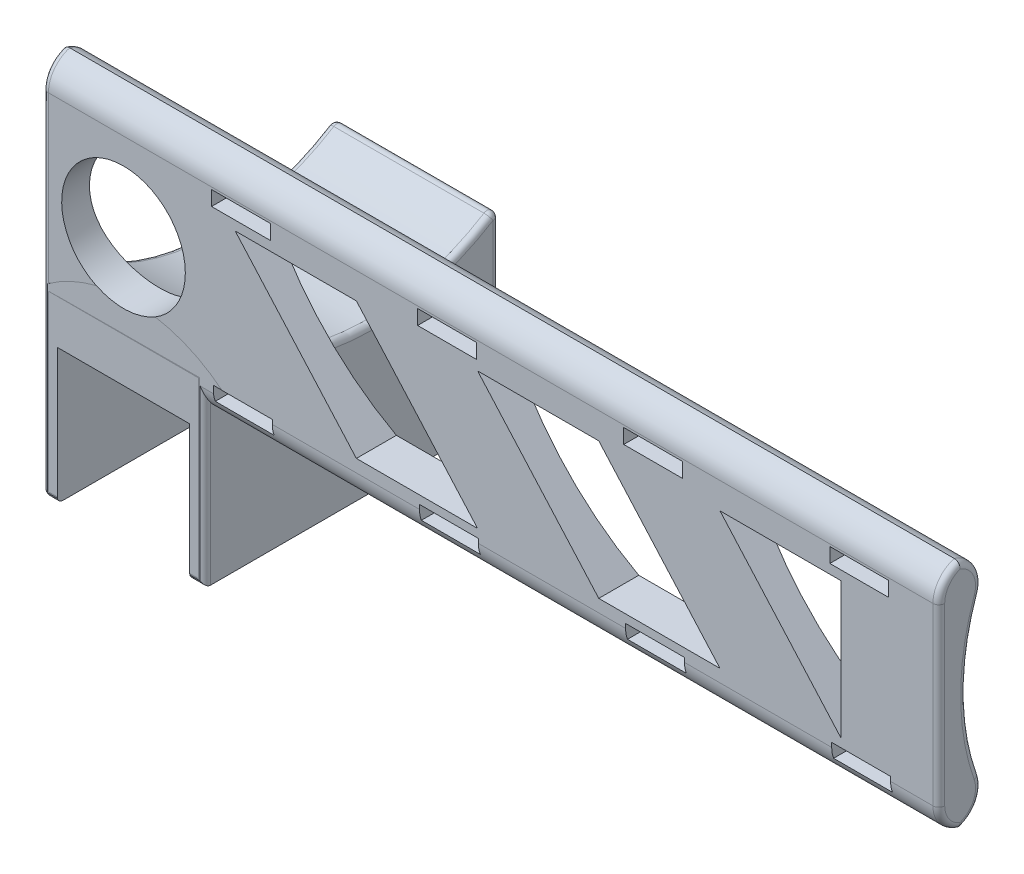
ISO-10303-21;
HEADER;
FILE_DESCRIPTION(('STEP AP214'),'2;1');
FILE_NAME('part.step','',(''),(''),'','','');
FILE_SCHEMA(('AUTOMOTIVE_DESIGN { 1 0 10303 214 1 1 1 1 }'));
ENDSEC;
DATA;
#1=APPLICATION_CONTEXT('core data for automotive mechanical design processes');
#2=APPLICATION_PROTOCOL_DEFINITION('international standard','automotive_design',2000,#1);
#3=PRODUCT_CONTEXT('',#1,'mechanical');
#4=PRODUCT('Part','Part','',(#3));
#5=PRODUCT_RELATED_PRODUCT_CATEGORY('part','',(#4));
#6=PRODUCT_DEFINITION_FORMATION('','',#4);
#7=PRODUCT_DEFINITION_CONTEXT('part definition',#1,'design');
#8=PRODUCT_DEFINITION('design','',#6,#7);
#9=PRODUCT_DEFINITION_SHAPE('','',#8);
#10=(LENGTH_UNIT() NAMED_UNIT(*) SI_UNIT(.MILLI.,.METRE.));
#11=(NAMED_UNIT(*) PLANE_ANGLE_UNIT() SI_UNIT($,.RADIAN.));
#12=(NAMED_UNIT(*) SI_UNIT($,.STERADIAN.) SOLID_ANGLE_UNIT());
#13=UNCERTAINTY_MEASURE_WITH_UNIT(LENGTH_MEASURE(1.E-05),#10,'distance_accuracy_value','');
#14=(GEOMETRIC_REPRESENTATION_CONTEXT(3) GLOBAL_UNCERTAINTY_ASSIGNED_CONTEXT((#13)) GLOBAL_UNIT_ASSIGNED_CONTEXT((#10,
#11,#12)) REPRESENTATION_CONTEXT('',''));
#15=CARTESIAN_POINT('',(0.,0.,0.));
#16=DIRECTION('',(0.,0.,1.));
#17=DIRECTION('',(1.,0.,0.));
#18=AXIS2_PLACEMENT_3D('',#15,#16,#17);
#19=CARTESIAN_POINT('',(-122.033369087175,-66.058204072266,19.95));
#20=DIRECTION('',(0.,0.,1.));
#21=DIRECTION('',(1.,0.,0.));
#22=AXIS2_PLACEMENT_3D('',#19,#20,#21);
#23=CYLINDRICAL_SURFACE('',#22,48.7117031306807);
#24=CARTESIAN_POINT('',(-122.033369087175,-66.058204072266,19.95));
#25=DIRECTION('',(0.,0.,1.));
#26=DIRECTION('',(1.,0.,0.));
#27=AXIS2_PLACEMENT_3D('',#24,#25,#26);
#28=CIRCLE('',#27,48.7117031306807);
#29=CARTESIAN_POINT('',(-133.99111023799,-18.8369964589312,19.95));
#30=VERTEX_POINT('',#29);
#31=CARTESIAN_POINT('',(-150.652871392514,-26.6405162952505,19.95));
#32=VERTEX_POINT('',#31);
#33=EDGE_CURVE('E625',#30,#32,#28,.T.);
#34=ORIENTED_EDGE('',*,*,#33,.F.);
#35=DIRECTION('',(0.,0.,1.));
#36=VECTOR('',#35,1.);
#37=CARTESIAN_POINT('',(-133.99111023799,-18.8369964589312,2.));
#38=LINE('',#37,#36);
#39=CARTESIAN_POINT('',(-133.99111023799,-18.8369964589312,20.));
#40=VERTEX_POINT('',#39);
#41=EDGE_CURVE('E75',#30,#40,#38,.T.);
#42=ORIENTED_EDGE('',*,*,#41,.T.);
#43=CARTESIAN_POINT('',(-122.033369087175,-66.058204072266,20.));
#44=DIRECTION('',(0.,0.,1.));
#45=DIRECTION('',(1.,0.,0.));
#46=AXIS2_PLACEMENT_3D('',#43,#44,#45);
#47=CIRCLE('',#46,48.7117031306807);
#48=CARTESIAN_POINT('',(-150.208461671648,-26.3216443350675,20.));
#49=VERTEX_POINT('',#48);
#50=EDGE_CURVE('E623',#40,#49,#47,.T.);
#51=ORIENTED_EDGE('',*,*,#50,.T.);
#52=CARTESIAN_POINT('',(-150.208461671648,-26.3216443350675,20.));
#53=CARTESIAN_POINT('',(-150.283445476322,-26.3748166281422,19.9999759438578));
#54=CARTESIAN_POINT('',(-150.357971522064,-26.427975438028,19.99579724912));
#55=CARTESIAN_POINT('',(-150.506108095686,-26.5342660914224,19.9791305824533));
#56=CARTESIAN_POINT('',(-150.579718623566,-26.5873979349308,19.9666426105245));
#57=CARTESIAN_POINT('',(-150.652871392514,-26.6405162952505,19.95));
#58=B_SPLINE_CURVE_WITH_KNOTS('',3,(#52,#53,#54,#55,#56,#57),.UNSPECIFIED.,.F.,.F.,(4,2,4),(0.,
0.274912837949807,0.549825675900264),.UNSPECIFIED.);
#59=EDGE_CURVE('E636',#49,#32,#58,.T.);
#60=ORIENTED_EDGE('',*,*,#59,.T.);
#61=EDGE_LOOP('',(#34,#42,#51,#60));
#62=FACE_BOUND('',#61,.T.);
#63=ADVANCED_FACE('F61',(#62),#23,.F.);
#64=CARTESIAN_POINT('',(-150.208461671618,-87.6042489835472,17.999999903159));
#65=DIRECTION('',(-0.99999995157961,0.,-0.000311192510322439));
#66=DIRECTION('',(-0.000311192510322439,0.,0.99999995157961));
#67=AXIS2_PLACEMENT_3D('',#64,#65,#66);
#68=CYLINDRICAL_SURFACE('',#67,2.);
#69=CARTESIAN_POINT('',(-147.208461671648,-87.6042489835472,18.0009334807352));
#70=DIRECTION('',(1.,0.,0.));
#71=DIRECTION('',(0.,0.,-1.));
#72=AXIS2_PLACEMENT_3D('',#69,#70,#71);
#73=ELLIPSE('',#72,2.00000009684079,2.);
#74=CARTESIAN_POINT('',(-147.208461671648,-89.6042489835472,18.0009334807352));
#75=VERTEX_POINT('',#74);
#76=CARTESIAN_POINT('',(-147.208461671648,-88.0527354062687,19.95));
#77=VERTEX_POINT('',#76);
#78=EDGE_CURVE('E646',#75,#77,#73,.F.);
#79=ORIENTED_EDGE('',*,*,#78,.T.);
#80=CARTESIAN_POINT('',(6116.00919376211,-87.6042489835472,19.95));
#81=DIRECTION('',(0.,0.,1.));
#82=DIRECTION('',(-1.,0.,0.));
#83=AXIS2_PLACEMENT_3D('',#80,#81,#82);
#84=ELLIPSE('',#83,6426.88989502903,2.);
#85=CARTESIAN_POINT('',(-150.208461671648,-88.0486586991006,19.95));
#86=VERTEX_POINT('',#85);
#87=EDGE_CURVE('E649',#77,#86,#84,.F.);
#88=ORIENTED_EDGE('',*,*,#87,.T.);
#89=CARTESIAN_POINT('',(-150.208461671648,-87.6042489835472,17.9999999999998));
#90=DIRECTION('',(1.,0.,0.));
#91=DIRECTION('',(0.,0.,-1.));
#92=AXIS2_PLACEMENT_3D('',#89,#90,#91);
#93=CIRCLE('',#92,2.);
#94=CARTESIAN_POINT('',(-150.208461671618,-89.6042489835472,17.999999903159));
#95=VERTEX_POINT('',#94);
#96=EDGE_CURVE('E1491',#86,#95,#93,.T.);
#97=ORIENTED_EDGE('',*,*,#96,.T.);
#98=DIRECTION('',(-0.99999995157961,0.,-0.000311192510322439));
#99=VECTOR('',#98,1.);
#100=CARTESIAN_POINT('',(-150.208461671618,-89.6042489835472,17.999999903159));
#101=LINE('',#100,#99);
#102=EDGE_CURVE('E1488',#75,#95,#101,.T.);
#103=ORIENTED_EDGE('',*,*,#102,.F.);
#104=EDGE_LOOP('',(#79,#88,#97,#103));
#105=FACE_BOUND('',#104,.T.);
#106=ADVANCED_FACE('F63',(#105),#68,.T.);
#107=CARTESIAN_POINT('',(-150.208461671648,-87.6042489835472,17.9999999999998));
#108=DIRECTION('',(0.,-1.,0.));
#109=DIRECTION('',(0.,0.,-1.));
#110=AXIS2_PLACEMENT_3D('',#107,#108,#109);
#111=SPHERICAL_SURFACE('',#110,2.);
#112=ORIENTED_EDGE('',*,*,#96,.F.);
#113=CARTESIAN_POINT('',(-150.208461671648,-87.6042489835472,19.95));
#114=DIRECTION('',(0.,0.,1.));
#115=DIRECTION('',(1.,0.,0.));
#116=AXIS2_PLACEMENT_3D('',#113,#114,#115);
#117=CIRCLE('',#116,0.444409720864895);
#118=CARTESIAN_POINT('',(-150.652871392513,-87.6042489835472,19.95));
#119=VERTEX_POINT('',#118);
#120=EDGE_CURVE('E1542',#86,#119,#117,.F.);
#121=ORIENTED_EDGE('',*,*,#120,.T.);
#122=CARTESIAN_POINT('',(-150.208461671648,-87.6042489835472,17.9999999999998));
#123=DIRECTION('',(0.,-1.,0.));
#124=DIRECTION('',(0.,0.,-1.));
#125=AXIS2_PLACEMENT_3D('',#122,#123,#124);
#126=CIRCLE('',#125,2.);
#127=CARTESIAN_POINT('',(-152.208461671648,-87.6042489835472,17.9999999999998));
#128=VERTEX_POINT('',#127);
#129=EDGE_CURVE('E1496',#128,#119,#126,.F.);
#130=ORIENTED_EDGE('',*,*,#129,.F.);
#131=CARTESIAN_POINT('',(-150.208461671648,-87.6042489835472,17.9999999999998));
#132=DIRECTION('',(0.,0.,1.));
#133=DIRECTION('',(0.,-1.,0.));
#134=AXIS2_PLACEMENT_3D('',#131,#132,#133);
#135=CIRCLE('',#134,2.);
#136=EDGE_CURVE('E1540',#128,#95,#135,.T.);
#137=ORIENTED_EDGE('',*,*,#136,.T.);
#138=EDGE_LOOP('',(#112,#121,#130,#137));
#139=FACE_BOUND('',#138,.T.);
#140=ADVANCED_FACE('F1442',(#139),#111,.T.);
#141=CARTESIAN_POINT('',(-99.2084616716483,-87.6042489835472,18.0158707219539));
#142=DIRECTION('',(-0.707106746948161,-0.707106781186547,-0.00022004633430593));
#143=DIRECTION('',(-0.707106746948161,0.707106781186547,-0.000220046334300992));
#144=AXIS2_PLACEMENT_3D('',#141,#142,#143);
#145=ELLIPSE('',#144,2.82842712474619,2.);
#146=CARTESIAN_POINT('',(-98.6993998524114,-88.1139126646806,19.95));
#147=VERTEX_POINT('',#146);
#148=CARTESIAN_POINT('',(-97.2084616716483,-89.6042489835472,18.0164931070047));
#149=VERTEX_POINT('',#148);
#150=EDGE_CURVE('E656',#147,#149,#145,.F.);
#151=ORIENTED_EDGE('',*,*,#150,.F.);
#152=CARTESIAN_POINT('',(6116.00919376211,-87.6042489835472,19.95));
#153=DIRECTION('',(0.,0.,1.));
#154=DIRECTION('',(-1.,0.,0.));
#155=AXIS2_PLACEMENT_3D('',#152,#153,#154);
#156=ELLIPSE('',#155,6426.88989502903,2.);
#157=CARTESIAN_POINT('',(-102.208461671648,-88.109750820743,19.95));
#158=VERTEX_POINT('',#157);
#159=EDGE_CURVE('E1141',#147,#158,#156,.F.);
#160=ORIENTED_EDGE('',*,*,#159,.T.);
#161=CARTESIAN_POINT('',(-102.208461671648,-87.6042489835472,18.0149371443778));
#162=DIRECTION('',(1.,0.,0.));
#163=DIRECTION('',(0.,0.,-1.));
#164=AXIS2_PLACEMENT_3D('',#161,#162,#163);
#165=ELLIPSE('',#164,2.00000009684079,2.);
#166=CARTESIAN_POINT('',(-102.208461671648,-89.6042489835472,18.0149371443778));
#167=VERTEX_POINT('',#166);
#168=EDGE_CURVE('E651',#167,#158,#165,.F.);
#169=ORIENTED_EDGE('',*,*,#168,.F.);
#170=EDGE_CURVE('E1458',#149,#167,#101,.T.);
#171=ORIENTED_EDGE('',*,*,#170,.F.);
#172=EDGE_LOOP('',(#151,#160,#169,#171));
#173=FACE_BOUND('',#172,.T.);
#174=ADVANCED_FACE('F1129',(#173),#68,.T.);
#175=CARTESIAN_POINT('',(-99.2084616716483,-26.6042489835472,18.0158707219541));
#176=DIRECTION('',(0.,1.,0.));
#177=DIRECTION('',(0.,0.,1.));
#178=AXIS2_PLACEMENT_3D('',#175,#176,#177);
#179=CYLINDRICAL_SURFACE('',#178,2.);
#180=CARTESIAN_POINT('',(-97.2084616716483,-35.7463978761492,18.0158707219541));
#181=CARTESIAN_POINT('',(-97.208466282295,-35.6828126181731,18.0632984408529));
#182=CARTESIAN_POINT('',(-97.2101480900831,-35.6186774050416,18.1099556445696));
#183=CARTESIAN_POINT('',(-97.2165776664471,-35.4894378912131,18.2016486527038));
#184=CARTESIAN_POINT('',(-97.2213244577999,-35.4243339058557,18.2466849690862));
#185=CARTESIAN_POINT('',(-97.2397069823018,-35.2279673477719,18.3791088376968));
#186=CARTESIAN_POINT('',(-97.2574872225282,-35.0953934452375,18.4640026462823));
#187=CARTESIAN_POINT('',(-97.3019950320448,-34.8286845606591,18.6261095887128));
#188=CARTESIAN_POINT('',(-97.3286473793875,-34.6945715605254,18.7033804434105));
#189=CARTESIAN_POINT('',(-97.3894183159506,-34.4241628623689,18.8510074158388));
#190=CARTESIAN_POINT('',(-97.4235417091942,-34.2878658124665,18.9213590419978));
#191=CARTESIAN_POINT('',(-97.5221446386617,-33.9244063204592,19.0985978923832));
#192=CARTESIAN_POINT('',(-97.5919402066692,-33.6957565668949,19.1995162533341));
#193=CARTESIAN_POINT('',(-97.7437069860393,-33.2351050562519,19.3828598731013));
#194=CARTESIAN_POINT('',(-97.8256845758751,-33.0031016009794,19.465275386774));
#195=CARTESIAN_POINT('',(-97.9989182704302,-32.5345300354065,19.6127547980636));
#196=CARTESIAN_POINT('',(-98.0902499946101,-32.2979397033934,19.6776588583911));
#197=CARTESIAN_POINT('',(-98.231005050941,-31.9415736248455,19.7615976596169));
#198=CARTESIAN_POINT('',(-98.2785344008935,-31.8225751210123,19.7873351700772));
#199=CARTESIAN_POINT('',(-98.3743274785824,-31.5840072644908,19.834404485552));
#200=CARTESIAN_POINT('',(-98.4225911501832,-31.4644379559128,19.855736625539));
#201=CARTESIAN_POINT('',(-98.5126156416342,-31.2407672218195,19.8914544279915));
#202=CARTESIAN_POINT('',(-98.5543762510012,-31.1367528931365,19.9063888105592));
#203=CARTESIAN_POINT('',(-98.6371290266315,-30.9278601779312,19.9330225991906));
#204=CARTESIAN_POINT('',(-98.6781201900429,-30.822980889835,19.9447180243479));
#205=CARTESIAN_POINT('',(-98.7571973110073,-30.6134871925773,19.9647097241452));
#206=CARTESIAN_POINT('',(-98.7953163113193,-30.5088902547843,19.9730520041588));
#207=CARTESIAN_POINT('',(-98.8476957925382,-30.3503515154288,19.9831461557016));
#208=CARTESIAN_POINT('',(-98.8643407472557,-30.2972882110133,19.9861058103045));
#209=CARTESIAN_POINT('',(-98.8949410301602,-30.1903663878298,19.9912037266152));
#210=CARTESIAN_POINT('',(-98.9088979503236,-30.1365083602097,19.9933424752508));
#211=CARTESIAN_POINT('',(-98.9317629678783,-30.0306699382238,19.9966714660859));
#212=CARTESIAN_POINT('',(-98.940902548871,-29.9787446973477,19.9979065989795));
#213=CARTESIAN_POINT('',(-98.9536238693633,-29.8738203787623,19.9995757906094));
#214=CARTESIAN_POINT('',(-98.9571613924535,-29.8208160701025,20.0000034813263));
#215=CARTESIAN_POINT('',(-98.9570039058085,-29.7676173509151,20.));
#216=B_SPLINE_CURVE_WITH_KNOTS('',3,(#180,#181,#182,#183,#184,#185,#186,#187,#188,#189,#190,
#191,#192,#193,#194,#195,#196,#197,#198,#199,#200,#201,#202,#203,#204,#205,#206,#207,#208,#209,
#210,#211,#212,#213,#214,#215),.UNSPECIFIED.,.F.,.F.,(4,2,2,2,2,2,2,2,2,2,2,2,2,2,2,2,2,4),(0.,
0.237919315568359,0.475762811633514,0.950492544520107,1.421295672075,1.89240242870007,
2.66967229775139,3.44735058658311,4.23190390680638,4.62393866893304,5.01594361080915,
5.35511870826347,5.69470884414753,6.02946620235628,6.19649291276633,6.36342039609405,
6.5213552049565,6.68053047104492),.UNSPECIFIED.);
#217=CARTESIAN_POINT('',(-97.2084616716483,-35.7463978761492,18.0158707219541));
#218=VERTEX_POINT('',#217);
#219=CARTESIAN_POINT('',(-98.6993998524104,-30.7663665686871,19.95));
#220=VERTEX_POINT('',#219);
#221=EDGE_CURVE('E1132',#218,#220,#216,.T.);
#222=ORIENTED_EDGE('',*,*,#221,.T.);
#223=DIRECTION('',(0.,1.,0.));
#224=VECTOR('',#223,1.);
#225=CARTESIAN_POINT('',(-98.6993998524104,-26.6042489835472,19.95));
#226=LINE('',#225,#224);
#227=EDGE_CURVE('E659',#220,#147,#226,.F.);
#228=ORIENTED_EDGE('',*,*,#227,.T.);
#229=ORIENTED_EDGE('',*,*,#150,.T.);
#230=DIRECTION('',(0.,0.,-1.));
#231=VECTOR('',#230,1.);
#232=CARTESIAN_POINT('',(-97.2084616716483,-89.6042489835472,20.0164932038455));
#233=LINE('',#232,#231);
#234=CARTESIAN_POINT('',(-97.2084616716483,-89.6042489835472,18.0158707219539));
#235=VERTEX_POINT('',#234);
#236=EDGE_CURVE('E658',#149,#235,#233,.T.);
#237=ORIENTED_EDGE('',*,*,#236,.T.);
#238=DIRECTION('',(0.,-1.,0.));
#239=VECTOR('',#238,1.);
#240=CARTESIAN_POINT('',(-97.2084616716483,-89.6042489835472,18.0158707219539));
#241=LINE('',#240,#239);
#242=EDGE_CURVE('E1475',#218,#235,#241,.T.);
#243=ORIENTED_EDGE('',*,*,#242,.F.);
#244=EDGE_LOOP('',(#222,#228,#229,#237,#243));
#245=FACE_BOUND('',#244,.T.);
#246=ADVANCED_FACE('F1125',(#245),#179,.T.);
#247=CARTESIAN_POINT('',(-147.208461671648,-43.6042489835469,-72.9835067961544));
#248=DIRECTION('',(1.,0.,0.));
#249=DIRECTION('',(0.,0.,-1.));
#250=AXIS2_PLACEMENT_3D('',#247,#248,#249);
#251=PLANE('',#250);
#252=DIRECTION('',(0.,0.,1.));
#253=VECTOR('',#252,1.);
#254=CARTESIAN_POINT('',(-147.208461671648,-43.6042489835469,-72.9835067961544));
#255=LINE('',#254,#253);
#256=CARTESIAN_POINT('',(-147.208461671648,-43.6042489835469,-72.9835067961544));
#257=VERTEX_POINT('',#256);
#258=CARTESIAN_POINT('',(-147.208461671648,-43.6042489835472,19.95));
#259=VERTEX_POINT('',#258);
#260=EDGE_CURVE('E660',#257,#259,#255,.T.);
#261=ORIENTED_EDGE('',*,*,#260,.T.);
#262=DIRECTION('',(0.,-1.,0.));
#263=VECTOR('',#262,1.);
#264=CARTESIAN_POINT('',(-147.208461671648,-43.6042489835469,19.95));
#265=LINE('',#264,#263);
#266=EDGE_CURVE('E663',#259,#77,#265,.T.);
#267=ORIENTED_EDGE('',*,*,#266,.T.);
#268=ORIENTED_EDGE('',*,*,#78,.F.);
#269=DIRECTION('',(0.,0.,1.));
#270=VECTOR('',#269,1.);
#271=CARTESIAN_POINT('',(-147.208461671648,-89.6042489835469,-72.9835067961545));
#272=LINE('',#271,#270);
#273=CARTESIAN_POINT('',(-147.208461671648,-89.6042489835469,-72.9835067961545));
#274=VERTEX_POINT('',#273);
#275=EDGE_CURVE('E1562',#274,#75,#272,.T.);
#276=ORIENTED_EDGE('',*,*,#275,.F.);
#277=DIRECTION('',(0.,-1.,0.));
#278=VECTOR('',#277,1.);
#279=CARTESIAN_POINT('',(-147.208461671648,-43.6042489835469,-72.9835067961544));
#280=LINE('',#279,#278);
#281=EDGE_CURVE('E634',#257,#274,#280,.T.);
#282=ORIENTED_EDGE('',*,*,#281,.F.);
#283=EDGE_LOOP('',(#261,#267,#268,#276,#282));
#284=FACE_BOUND('',#283,.T.);
#285=ADVANCED_FACE('F1122',(#284),#251,.T.);
#286=CARTESIAN_POINT('',(-102.208461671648,-43.6042489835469,-72.9835067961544));
#287=DIRECTION('',(1.,0.,0.));
#288=DIRECTION('',(0.,0.,-1.));
#289=AXIS2_PLACEMENT_3D('',#286,#287,#288);
#290=PLANE('',#289);
#291=DIRECTION('',(0.,-1.,0.));
#292=VECTOR('',#291,1.);
#293=CARTESIAN_POINT('',(-102.208461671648,-43.6042489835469,19.95));
#294=LINE('',#293,#292);
#295=CARTESIAN_POINT('',(-102.208461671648,-43.6042489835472,19.95));
#296=VERTEX_POINT('',#295);
#297=EDGE_CURVE('E641',#296,#158,#294,.T.);
#298=ORIENTED_EDGE('',*,*,#297,.F.);
#299=DIRECTION('',(0.,0.,1.));
#300=VECTOR('',#299,1.);
#301=CARTESIAN_POINT('',(-102.208461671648,-43.6042489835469,-72.9835067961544));
#302=LINE('',#301,#300);
#303=CARTESIAN_POINT('',(-102.208461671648,-43.6042489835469,-72.9835067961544));
#304=VERTEX_POINT('',#303);
#305=EDGE_CURVE('E654',#304,#296,#302,.T.);
#306=ORIENTED_EDGE('',*,*,#305,.F.);
#307=DIRECTION('',(0.,-1.,0.));
#308=VECTOR('',#307,1.);
#309=CARTESIAN_POINT('',(-102.208461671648,-43.6042489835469,-72.9835067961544));
#310=LINE('',#309,#308);
#311=CARTESIAN_POINT('',(-102.208461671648,-89.6042489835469,-72.9835067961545));
#312=VERTEX_POINT('',#311);
#313=EDGE_CURVE('E1554',#304,#312,#310,.T.);
#314=ORIENTED_EDGE('',*,*,#313,.T.);
#315=DIRECTION('',(0.,0.,1.));
#316=VECTOR('',#315,1.);
#317=CARTESIAN_POINT('',(-102.208461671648,-89.6042489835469,-72.9835067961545));
#318=LINE('',#317,#316);
#319=EDGE_CURVE('E655',#312,#167,#318,.T.);
#320=ORIENTED_EDGE('',*,*,#319,.T.);
#321=ORIENTED_EDGE('',*,*,#168,.T.);
#322=EDGE_LOOP('',(#298,#306,#314,#320,#321));
#323=FACE_BOUND('',#322,.T.);
#324=ADVANCED_FACE('F1118',(#323),#290,.F.);
#325=CARTESIAN_POINT('',(0.,-43.6042489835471,-1.47145305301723E-13));
#326=DIRECTION('',(0.,-1.,0.));
#327=DIRECTION('',(0.,0.,-1.));
#328=AXIS2_PLACEMENT_3D('',#325,#326,#327);
#329=PLANE('',#328);
#330=ORIENTED_EDGE('',*,*,#305,.T.);
#331=DIRECTION('',(-1.,0.,0.));
#332=VECTOR('',#331,1.);
#333=CARTESIAN_POINT('',(0.,-43.6042489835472,19.95));
#334=LINE('',#333,#332);
#335=EDGE_CURVE('E667',#296,#259,#334,.T.);
#336=ORIENTED_EDGE('',*,*,#335,.T.);
#337=ORIENTED_EDGE('',*,*,#260,.F.);
#338=DIRECTION('',(1.,0.,0.));
#339=VECTOR('',#338,1.);
#340=CARTESIAN_POINT('',(-147.208461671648,-43.6042489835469,-72.9835067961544));
#341=LINE('',#340,#339);
#342=EDGE_CURVE('E1567',#257,#304,#341,.T.);
#343=ORIENTED_EDGE('',*,*,#342,.T.);
#344=EDGE_LOOP('',(#330,#336,#337,#343));
#345=FACE_BOUND('',#344,.T.);
#346=ADVANCED_FACE('F1114',(#345),#329,.T.);
#347=CARTESIAN_POINT('',(-227.791538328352,-29.7676173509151,15.5189359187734));
#348=DIRECTION('',(1.,0.,0.));
#349=DIRECTION('',(0.,0.,-1.));
#350=AXIS2_PLACEMENT_3D('',#347,#348,#349);
#351=CYLINDRICAL_SURFACE('',#350,10.);
#352=CARTESIAN_POINT('',(-94.1777179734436,-29.7676173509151,15.5189359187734));
#353=DIRECTION('',(-1.,0.,0.));
#354=DIRECTION('',(0.,0.,1.));
#355=AXIS2_PLACEMENT_3D('',#352,#353,#354);
#356=CIRCLE('',#355,10.);
#357=CARTESIAN_POINT('',(-94.1777179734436,-33.298723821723,6.16312023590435));
#358=VERTEX_POINT('',#357);
#359=CARTESIAN_POINT('',(-94.1777179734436,-28.298723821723,5.62740662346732));
#360=VERTEX_POINT('',#359);
#361=EDGE_CURVE('E904',#358,#360,#356,.F.);
#362=ORIENTED_EDGE('',*,*,#361,.F.);
#363=DIRECTION('',(1.,0.,0.));
#364=VECTOR('',#363,1.);
#365=CARTESIAN_POINT('',(-227.791538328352,-33.298723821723,6.16312023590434));
#366=LINE('',#365,#364);
#367=CARTESIAN_POINT('',(-74.1777179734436,-33.298723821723,6.16312023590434));
#368=VERTEX_POINT('',#367);
#369=EDGE_CURVE('E981',#368,#358,#366,.F.);
#370=ORIENTED_EDGE('',*,*,#369,.F.);
#371=CARTESIAN_POINT('',(-74.1777179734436,-29.7676173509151,15.5189359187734));
#372=DIRECTION('',(1.,0.,0.));
#373=DIRECTION('',(0.,0.,-1.));
#374=AXIS2_PLACEMENT_3D('',#371,#372,#373);
#375=CIRCLE('',#374,10.);
#376=CARTESIAN_POINT('',(-74.1777179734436,-28.298723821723,5.62740662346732));
#377=VERTEX_POINT('',#376);
#378=EDGE_CURVE('E969',#377,#368,#375,.F.);
#379=ORIENTED_EDGE('',*,*,#378,.F.);
#380=DIRECTION('',(1.,0.,0.));
#381=VECTOR('',#380,1.);
#382=CARTESIAN_POINT('',(-227.791538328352,-28.298723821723,5.62740662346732));
#383=LINE('',#382,#381);
#384=EDGE_CURVE('E900',#360,#377,#383,.T.);
#385=ORIENTED_EDGE('',*,*,#384,.F.);
#386=EDGE_LOOP('',(#362,#370,#379,#385));
#387=FACE_BOUND('',#386,.T.);
#388=DIRECTION('',(1.,0.,0.));
#389=VECTOR('',#388,1.);
#390=CARTESIAN_POINT('',(-227.791538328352,-28.298723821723,5.62740662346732));
#391=LINE('',#390,#389);
#392=CARTESIAN_POINT('',(-24.1777179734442,-28.298723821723,5.62740662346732));
#393=VERTEX_POINT('',#392);
#394=CARTESIAN_POINT('',(-4.17771797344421,-28.298723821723,5.62740662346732));
#395=VERTEX_POINT('',#394);
#396=EDGE_CURVE('E964',#393,#395,#391,.T.);
#397=ORIENTED_EDGE('',*,*,#396,.F.);
#398=CARTESIAN_POINT('',(-24.1777179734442,-29.7676173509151,15.5189359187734));
#399=DIRECTION('',(-1.,0.,0.));
#400=DIRECTION('',(0.,0.,1.));
#401=AXIS2_PLACEMENT_3D('',#398,#399,#400);
#402=CIRCLE('',#401,10.);
#403=CARTESIAN_POINT('',(-24.1777179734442,-33.298723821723,6.16312023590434));
#404=VERTEX_POINT('',#403);
#405=EDGE_CURVE('E955',#404,#393,#402,.F.);
#406=ORIENTED_EDGE('',*,*,#405,.F.);
#407=DIRECTION('',(1.,0.,0.));
#408=VECTOR('',#407,1.);
#409=CARTESIAN_POINT('',(-227.791538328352,-33.298723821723,6.16312023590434));
#410=LINE('',#409,#408);
#411=CARTESIAN_POINT('',(-4.17771797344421,-33.298723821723,6.16312023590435));
#412=VERTEX_POINT('',#411);
#413=EDGE_CURVE('E977',#412,#404,#410,.F.);
#414=ORIENTED_EDGE('',*,*,#413,.F.);
#415=CARTESIAN_POINT('',(-4.17771797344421,-29.7676173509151,15.5189359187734));
#416=DIRECTION('',(1.,0.,0.));
#417=DIRECTION('',(0.,0.,-1.));
#418=AXIS2_PLACEMENT_3D('',#415,#416,#417);
#419=CIRCLE('',#418,10.);
#420=EDGE_CURVE('E961',#395,#412,#419,.F.);
#421=ORIENTED_EDGE('',*,*,#420,.F.);
#422=EDGE_LOOP('',(#397,#406,#414,#421));
#423=FACE_BOUND('',#422,.T.);
#424=DIRECTION('',(1.,0.,0.));
#425=VECTOR('',#424,1.);
#426=CARTESIAN_POINT('',(-227.791538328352,-28.298723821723,5.62740662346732));
#427=LINE('',#426,#425);
#428=CARTESIAN_POINT('',(45.8222820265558,-28.298723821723,5.62740662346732));
#429=VERTEX_POINT('',#428);
#430=CARTESIAN_POINT('',(65.8222820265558,-28.298723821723,5.62740662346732));
#431=VERTEX_POINT('',#430);
#432=EDGE_CURVE('E950',#429,#431,#427,.T.);
#433=ORIENTED_EDGE('',*,*,#432,.F.);
#434=CARTESIAN_POINT('',(45.8222820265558,-29.7676173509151,15.5189359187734));
#435=DIRECTION('',(-1.,0.,0.));
#436=DIRECTION('',(0.,0.,1.));
#437=AXIS2_PLACEMENT_3D('',#434,#435,#436);
#438=CIRCLE('',#437,10.);
#439=CARTESIAN_POINT('',(45.8222820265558,-33.298723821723,6.16312023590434));
#440=VERTEX_POINT('',#439);
#441=EDGE_CURVE('E944',#440,#429,#438,.F.);
#442=ORIENTED_EDGE('',*,*,#441,.F.);
#443=DIRECTION('',(1.,0.,0.));
#444=VECTOR('',#443,1.);
#445=CARTESIAN_POINT('',(-227.791538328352,-33.298723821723,6.16312023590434));
#446=LINE('',#445,#444);
#447=CARTESIAN_POINT('',(65.8222820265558,-33.298723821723,6.16312023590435));
#448=VERTEX_POINT('',#447);
#449=EDGE_CURVE('E974',#448,#440,#446,.F.);
#450=ORIENTED_EDGE('',*,*,#449,.F.);
#451=CARTESIAN_POINT('',(65.8222820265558,-29.7676173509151,15.5189359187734));
#452=DIRECTION('',(1.,0.,0.));
#453=DIRECTION('',(0.,0.,-1.));
#454=AXIS2_PLACEMENT_3D('',#451,#452,#453);
#455=CIRCLE('',#454,10.);
#456=EDGE_CURVE('E948',#431,#448,#455,.F.);
#457=ORIENTED_EDGE('',*,*,#456,.F.);
#458=EDGE_LOOP('',(#433,#442,#450,#457));
#459=FACE_BOUND('',#458,.T.);
#460=DIRECTION('',(1.,0.,0.));
#461=VECTOR('',#460,1.);
#462=CARTESIAN_POINT('',(-227.791538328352,-28.298723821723,5.62740662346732));
#463=LINE('',#462,#461);
#464=CARTESIAN_POINT('',(115.822282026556,-28.298723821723,5.62740662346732));
#465=VERTEX_POINT('',#464);
#466=CARTESIAN_POINT('',(135.822282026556,-28.298723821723,5.62740662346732));
#467=VERTEX_POINT('',#466);
#468=EDGE_CURVE('E939',#465,#467,#463,.T.);
#469=ORIENTED_EDGE('',*,*,#468,.F.);
#470=CARTESIAN_POINT('',(115.822282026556,-29.7676173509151,15.5189359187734));
#471=DIRECTION('',(-1.,0.,0.));
#472=DIRECTION('',(0.,0.,1.));
#473=AXIS2_PLACEMENT_3D('',#470,#471,#472);
#474=CIRCLE('',#473,10.);
#475=CARTESIAN_POINT('',(115.822282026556,-33.298723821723,6.16312023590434));
#476=VERTEX_POINT('',#475);
#477=EDGE_CURVE('E932',#476,#465,#474,.F.);
#478=ORIENTED_EDGE('',*,*,#477,.F.);
#479=DIRECTION('',(1.,0.,0.));
#480=VECTOR('',#479,1.);
#481=CARTESIAN_POINT('',(-227.791538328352,-33.298723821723,6.16312023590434));
#482=LINE('',#481,#480);
#483=CARTESIAN_POINT('',(135.822282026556,-33.298723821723,6.16312023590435));
#484=VERTEX_POINT('',#483);
#485=EDGE_CURVE('E971',#484,#476,#482,.F.);
#486=ORIENTED_EDGE('',*,*,#485,.F.);
#487=CARTESIAN_POINT('',(135.822282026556,-29.7676173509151,15.5189359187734));
#488=DIRECTION('',(1.,0.,0.));
#489=DIRECTION('',(0.,0.,-1.));
#490=AXIS2_PLACEMENT_3D('',#487,#488,#489);
#491=CIRCLE('',#490,10.);
#492=EDGE_CURVE('E936',#467,#484,#491,.F.);
#493=ORIENTED_EDGE('',*,*,#492,.F.);
#494=EDGE_LOOP('',(#469,#478,#486,#493));
#495=FACE_BOUND('',#494,.T.);
#496=DIRECTION('',(1.,0.,0.));
#497=VECTOR('',#496,1.);
#498=CARTESIAN_POINT('',(0.,-39.379346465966,12.7594679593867));
#499=LINE('',#498,#497);
#500=CARTESIAN_POINT('',(-97.2084616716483,-39.379346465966,12.7594679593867));
#501=VERTEX_POINT('',#500);
#502=CARTESIAN_POINT('',(150.208461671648,-39.379346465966,12.7594679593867));
#503=VERTEX_POINT('',#502);
#504=EDGE_CURVE('E1574',#501,#503,#499,.T.);
#505=ORIENTED_EDGE('',*,*,#504,.F.);
#506=CARTESIAN_POINT('',(-97.2084616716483,-29.7676173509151,15.5189359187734));
#507=DIRECTION('',(-1.,0.,0.));
#508=DIRECTION('',(0.,0.,1.));
#509=AXIS2_PLACEMENT_3D('',#506,#507,#508);
#510=CIRCLE('',#509,10.);
#511=CARTESIAN_POINT('',(-97.2084616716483,-29.2459280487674,5.53255317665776));
#512=VERTEX_POINT('',#511);
#513=EDGE_CURVE('E1569',#501,#512,#510,.F.);
#514=ORIENTED_EDGE('',*,*,#513,.T.);
#515=CARTESIAN_POINT('',(-98.6147829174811,-26.6040489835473,6.03253327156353));
#516=CARTESIAN_POINT('',(-98.5594164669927,-26.6313100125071,6.02343855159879));
#517=CARTESIAN_POINT('',(-98.5058548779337,-26.6616895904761,6.013440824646));
#518=CARTESIAN_POINT('',(-98.4024882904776,-26.7275991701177,5.99215976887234));
#519=CARTESIAN_POINT('',(-98.3526724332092,-26.7631133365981,5.98088041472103));
#520=CARTESIAN_POINT('',(-98.257070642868,-26.8380209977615,5.95760785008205));
#521=CARTESIAN_POINT('',(-98.211250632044,-26.8773740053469,5.94562252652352));
#522=CARTESIAN_POINT('',(-98.1229327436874,-26.9595790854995,5.92118813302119));
#523=CARTESIAN_POINT('',(-98.0804381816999,-27.0024345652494,5.90873861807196));
#524=CARTESIAN_POINT('',(-97.9832892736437,-27.1077330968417,5.8789658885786));
#525=CARTESIAN_POINT('',(-97.9300704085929,-27.1714824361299,5.86157019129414));
#526=CARTESIAN_POINT('',(-97.8294245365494,-27.3034221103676,5.82706241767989));
#527=CARTESIAN_POINT('',(-97.781998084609,-27.3716128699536,5.809950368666));
#528=CARTESIAN_POINT('',(-97.6475358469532,-27.5824780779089,5.75952876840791));
#529=CARTESIAN_POINT('',(-97.5688596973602,-27.7308361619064,5.7273109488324));
#530=CARTESIAN_POINT('',(-97.4315346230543,-28.0425765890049,5.66752852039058));
#531=CARTESIAN_POINT('',(-97.3735276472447,-28.2062685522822,5.64012462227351));
#532=CARTESIAN_POINT('',(-97.2822149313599,-28.5411797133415,5.59299406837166));
#533=CARTESIAN_POINT('',(-97.2488536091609,-28.7123810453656,5.57325018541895));
#534=CARTESIAN_POINT('',(-97.2114400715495,-29.0411305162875,5.54413552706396));
#535=CARTESIAN_POINT('',(-97.2047547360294,-29.1982988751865,5.5339147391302));
#536=CARTESIAN_POINT('',(-97.2160909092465,-29.5121466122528,5.5209712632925));
#537=CARTESIAN_POINT('',(-97.2340950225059,-29.6688262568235,5.5182433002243));
#538=CARTESIAN_POINT('',(-97.2920482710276,-29.9505465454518,5.51978913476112));
#539=CARTESIAN_POINT('',(-97.3277718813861,-30.0764572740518,5.52295698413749));
#540=CARTESIAN_POINT('',(-97.4191400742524,-30.3207256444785,5.53349735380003));
#541=CARTESIAN_POINT('',(-97.4747774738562,-30.439085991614,5.54086835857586));
#542=CARTESIAN_POINT('',(-97.6065876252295,-30.664684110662,5.55860591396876));
#543=CARTESIAN_POINT('',(-97.6828931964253,-30.7718435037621,5.56899187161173));
#544=CARTESIAN_POINT('',(-97.8546649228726,-30.9694197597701,5.5909163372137));
#545=CARTESIAN_POINT('',(-97.9501185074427,-31.0598475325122,5.60245408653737));
#546=CARTESIAN_POINT('',(-98.1450476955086,-31.2101889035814,5.62327646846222));
#547=CARTESIAN_POINT('',(-98.2427079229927,-31.2724480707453,5.63266610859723));
#548=CARTESIAN_POINT('',(-98.4478415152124,-31.3782287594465,5.64934532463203));
#549=CARTESIAN_POINT('',(-98.5553080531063,-31.4217631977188,5.65663634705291));
#550=CARTESIAN_POINT('',(-98.7537084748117,-31.4815625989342,5.6668748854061));
#551=CARTESIAN_POINT('',(-98.8434873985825,-31.5015977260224,5.67040777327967));
#552=CARTESIAN_POINT('',(-98.9796277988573,-31.5216765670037,5.67397184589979));
#553=CARTESIAN_POINT('',(-99.025273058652,-31.5267072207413,5.67487067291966));
#554=CARTESIAN_POINT('',(-99.1168280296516,-31.5334183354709,5.67607290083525));
#555=CARTESIAN_POINT('',(-99.1627378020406,-31.5350979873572,5.67637615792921));
#556=CARTESIAN_POINT('',(-99.2086616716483,-31.5350919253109,5.67637356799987));
#557=B_SPLINE_CURVE_WITH_KNOTS('',3,(#515,#516,#517,#518,#519,#520,#521,#522,#523,#524,#525,
#526,#527,#528,#529,#530,#531,#532,#533,#534,#535,#536,#537,#538,#539,#540,#541,#542,#543,#544,
#545,#546,#547,#548,#549,#550,#551,#552,#553,#554,#555,#556),.UNSPECIFIED.,.F.,.F.,(4,2,2,2,2,2,
2,2,2,2,2,2,2,2,2,2,2,2,2,2,4),(0.,0.186876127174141,0.373187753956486,0.557711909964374,
0.742417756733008,0.996571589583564,1.25074975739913,1.76158154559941,2.28712336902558,
2.81147631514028,3.28256223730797,3.75331641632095,4.14446946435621,4.53548156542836,
4.9290686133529,5.32239811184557,5.66914193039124,6.015646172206,6.29076758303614,
6.42844582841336,6.56615731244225),.UNSPECIFIED.);
#558=CARTESIAN_POINT('',(-98.506313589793,-26.6626607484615,6.01318794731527));
#559=VERTEX_POINT('',#558);
#560=EDGE_CURVE('E1737',#559,#512,#557,.T.);
#561=ORIENTED_EDGE('',*,*,#560,.F.);
#562=DIRECTION('',(1.,0.,0.));
#563=VECTOR('',#562,1.);
#564=CARTESIAN_POINT('',(-123.984278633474,-26.6626607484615,6.01318794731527));
#565=LINE('',#564,#563);
#566=CARTESIAN_POINT('',(-150.208461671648,-26.6626607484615,6.01318794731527));
#567=VERTEX_POINT('',#566);
#568=EDGE_CURVE('E1687',#567,#559,#565,.T.);
#569=ORIENTED_EDGE('',*,*,#568,.F.);
#570=CARTESIAN_POINT('',(-150.208461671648,-29.7676173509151,15.5189359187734));
#571=DIRECTION('',(1.,0.,0.));
#572=DIRECTION('',(0.,0.,-1.));
#573=AXIS2_PLACEMENT_3D('',#570,#571,#572);
#574=CIRCLE('',#573,10.);
#575=CARTESIAN_POINT('',(-150.208461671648,-26.4601043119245,6.08175638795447));
#576=VERTEX_POINT('',#575);
#577=EDGE_CURVE('E1577',#567,#576,#574,.T.);
#578=ORIENTED_EDGE('',*,*,#577,.T.);
#579=DIRECTION('',(1.,0.,0.));
#580=VECTOR('',#579,1.);
#581=CARTESIAN_POINT('',(-227.791538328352,-26.4601043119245,6.08175638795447));
#582=LINE('',#581,#580);
#583=CARTESIAN_POINT('',(150.208461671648,-26.4601043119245,6.08175638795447));
#584=VERTEX_POINT('',#583);
#585=EDGE_CURVE('E1672',#584,#576,#582,.F.);
#586=ORIENTED_EDGE('',*,*,#585,.F.);
#587=CARTESIAN_POINT('',(150.208461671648,-29.7676173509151,15.5189359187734));
#588=DIRECTION('',(1.,0.,0.));
#589=DIRECTION('',(0.,1.,0.));
#590=AXIS2_PLACEMENT_3D('',#587,#588,#589);
#591=CIRCLE('',#590,10.);
#592=EDGE_CURVE('E1571',#584,#503,#591,.F.);
#593=ORIENTED_EDGE('',*,*,#592,.T.);
#594=EDGE_LOOP('',(#505,#514,#561,#569,#578,#586,#593));
#595=FACE_BOUND('',#594,.T.);
#596=ADVANCED_FACE('F1117',(#387,#423,#459,#495,#595),#351,.T.);
#597=CARTESIAN_POINT('',(0.,-29.7676173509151,10.));
#598=DIRECTION('',(-1.,0.,0.));
#599=DIRECTION('',(0.,0.,1.));
#600=AXIS2_PLACEMENT_3D('',#597,#598,#599);
#601=CYLINDRICAL_SURFACE('',#600,10.);
#602=CARTESIAN_POINT('',(-94.1777179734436,-29.7676173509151,10.));
#603=DIRECTION('',(-1.,0.,0.));
#604=DIRECTION('',(0.,0.,1.));
#605=AXIS2_PLACEMENT_3D('',#602,#603,#604);
#606=CIRCLE('',#605,10.);
#607=CARTESIAN_POINT('',(-94.1777179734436,-30.7663665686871,19.95));
#608=VERTEX_POINT('',#607);
#609=CARTESIAN_POINT('',(-94.1777179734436,-33.298723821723,19.355815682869));
#610=VERTEX_POINT('',#609);
#611=EDGE_CURVE('E902',#608,#610,#606,.F.);
#612=ORIENTED_EDGE('',*,*,#611,.F.);
#613=DIRECTION('',(-1.,0.,0.));
#614=VECTOR('',#613,1.);
#615=CARTESIAN_POINT('',(0.,-30.766366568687,19.95));
#616=LINE('',#615,#614);
#617=EDGE_CURVE('E1570',#608,#220,#616,.T.);
#618=ORIENTED_EDGE('',*,*,#617,.T.);
#619=ORIENTED_EDGE('',*,*,#221,.F.);
#620=CARTESIAN_POINT('',(-97.2084616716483,-29.7676173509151,10.));
#621=DIRECTION('',(-1.,0.,0.));
#622=DIRECTION('',(0.,0.,1.));
#623=AXIS2_PLACEMENT_3D('',#620,#621,#622);
#624=CIRCLE('',#623,10.);
#625=EDGE_CURVE('E1142',#218,#501,#624,.F.);
#626=ORIENTED_EDGE('',*,*,#625,.T.);
#627=ORIENTED_EDGE('',*,*,#504,.T.);
#628=CARTESIAN_POINT('',(150.208461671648,-29.7676173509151,10.));
#629=DIRECTION('',(1.,0.,0.));
#630=DIRECTION('',(0.,1.,0.));
#631=AXIS2_PLACEMENT_3D('',#628,#629,#630);
#632=CIRCLE('',#631,10.);
#633=CARTESIAN_POINT('',(150.208461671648,-29.7676173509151,20.));
#634=VERTEX_POINT('',#633);
#635=EDGE_CURVE('E1588',#503,#634,#632,.F.);
#636=ORIENTED_EDGE('',*,*,#635,.T.);
#637=DIRECTION('',(1.,0.,0.));
#638=VECTOR('',#637,1.);
#639=CARTESIAN_POINT('',(152.208461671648,-29.7676173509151,20.));
#640=LINE('',#639,#638);
#641=CARTESIAN_POINT('',(135.822282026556,-29.7676173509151,20.));
#642=VERTEX_POINT('',#641);
#643=EDGE_CURVE('E1595',#642,#634,#640,.T.);
#644=ORIENTED_EDGE('',*,*,#643,.F.);
#645=CARTESIAN_POINT('',(135.822282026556,-29.7676173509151,10.));
#646=DIRECTION('',(1.,0.,0.));
#647=DIRECTION('',(0.,0.,-1.));
#648=AXIS2_PLACEMENT_3D('',#645,#646,#647);
#649=CIRCLE('',#648,10.);
#650=CARTESIAN_POINT('',(135.822282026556,-33.298723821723,19.355815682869));
#651=VERTEX_POINT('',#650);
#652=EDGE_CURVE('E934',#651,#642,#649,.F.);
#653=ORIENTED_EDGE('',*,*,#652,.F.);
#654=DIRECTION('',(-1.,0.,0.));
#655=VECTOR('',#654,1.);
#656=CARTESIAN_POINT('',(0.,-33.298723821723,19.355815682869));
#657=LINE('',#656,#655);
#658=CARTESIAN_POINT('',(115.822282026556,-33.298723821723,19.355815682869));
#659=VERTEX_POINT('',#658);
#660=EDGE_CURVE('E722',#659,#651,#657,.F.);
#661=ORIENTED_EDGE('',*,*,#660,.F.);
#662=CARTESIAN_POINT('',(115.822282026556,-29.7676173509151,10.));
#663=DIRECTION('',(-1.,0.,0.));
#664=DIRECTION('',(0.,0.,1.));
#665=AXIS2_PLACEMENT_3D('',#662,#663,#664);
#666=CIRCLE('',#665,10.);
#667=CARTESIAN_POINT('',(115.822282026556,-29.7676173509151,20.));
#668=VERTEX_POINT('',#667);
#669=EDGE_CURVE('E930',#668,#659,#666,.F.);
#670=ORIENTED_EDGE('',*,*,#669,.F.);
#671=CARTESIAN_POINT('',(65.8222820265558,-29.7676173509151,20.));
#672=VERTEX_POINT('',#671);
#673=EDGE_CURVE('E1679',#672,#668,#640,.T.);
#674=ORIENTED_EDGE('',*,*,#673,.F.);
#675=CARTESIAN_POINT('',(65.8222820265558,-29.7676173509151,10.));
#676=DIRECTION('',(1.,0.,0.));
#677=DIRECTION('',(0.,0.,-1.));
#678=AXIS2_PLACEMENT_3D('',#675,#676,#677);
#679=CIRCLE('',#678,10.);
#680=CARTESIAN_POINT('',(65.8222820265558,-33.298723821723,19.355815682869));
#681=VERTEX_POINT('',#680);
#682=EDGE_CURVE('E946',#681,#672,#679,.F.);
#683=ORIENTED_EDGE('',*,*,#682,.F.);
#684=DIRECTION('',(-1.,0.,0.));
#685=VECTOR('',#684,1.);
#686=CARTESIAN_POINT('',(0.,-33.298723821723,19.355815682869));
#687=LINE('',#686,#685);
#688=CARTESIAN_POINT('',(45.8222820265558,-33.298723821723,19.355815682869));
#689=VERTEX_POINT('',#688);
#690=EDGE_CURVE('E724',#689,#681,#687,.F.);
#691=ORIENTED_EDGE('',*,*,#690,.F.);
#692=CARTESIAN_POINT('',(45.8222820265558,-29.7676173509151,10.));
#693=DIRECTION('',(-1.,0.,0.));
#694=DIRECTION('',(0.,0.,1.));
#695=AXIS2_PLACEMENT_3D('',#692,#693,#694);
#696=CIRCLE('',#695,10.);
#697=CARTESIAN_POINT('',(45.8222820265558,-29.7676173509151,20.));
#698=VERTEX_POINT('',#697);
#699=EDGE_CURVE('E942',#698,#689,#696,.F.);
#700=ORIENTED_EDGE('',*,*,#699,.F.);
#701=CARTESIAN_POINT('',(-4.17771797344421,-29.7676173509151,20.));
#702=VERTEX_POINT('',#701);
#703=EDGE_CURVE('E1868',#702,#698,#640,.T.);
#704=ORIENTED_EDGE('',*,*,#703,.F.);
#705=CARTESIAN_POINT('',(-4.17771797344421,-29.7676173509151,10.));
#706=DIRECTION('',(1.,0.,0.));
#707=DIRECTION('',(0.,0.,-1.));
#708=AXIS2_PLACEMENT_3D('',#705,#706,#707);
#709=CIRCLE('',#708,10.);
#710=CARTESIAN_POINT('',(-4.17771797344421,-33.298723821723,19.355815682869));
#711=VERTEX_POINT('',#710);
#712=EDGE_CURVE('E958',#711,#702,#709,.F.);
#713=ORIENTED_EDGE('',*,*,#712,.F.);
#714=DIRECTION('',(-1.,0.,0.));
#715=VECTOR('',#714,1.);
#716=CARTESIAN_POINT('',(0.,-33.298723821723,19.355815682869));
#717=LINE('',#716,#715);
#718=CARTESIAN_POINT('',(-24.1777179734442,-33.298723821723,19.355815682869));
#719=VERTEX_POINT('',#718);
#720=EDGE_CURVE('E726',#719,#711,#717,.F.);
#721=ORIENTED_EDGE('',*,*,#720,.F.);
#722=CARTESIAN_POINT('',(-24.1777179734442,-29.7676173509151,10.));
#723=DIRECTION('',(-1.,0.,0.));
#724=DIRECTION('',(0.,0.,1.));
#725=AXIS2_PLACEMENT_3D('',#722,#723,#724);
#726=CIRCLE('',#725,10.);
#727=CARTESIAN_POINT('',(-24.1777179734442,-29.7676173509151,20.));
#728=VERTEX_POINT('',#727);
#729=EDGE_CURVE('E952',#728,#719,#726,.F.);
#730=ORIENTED_EDGE('',*,*,#729,.F.);
#731=CARTESIAN_POINT('',(-74.1777179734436,-29.7676173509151,20.));
#732=VERTEX_POINT('',#731);
#733=EDGE_CURVE('E1680',#732,#728,#640,.T.);
#734=ORIENTED_EDGE('',*,*,#733,.F.);
#735=CARTESIAN_POINT('',(-74.1777179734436,-29.7676173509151,10.));
#736=DIRECTION('',(1.,0.,0.));
#737=DIRECTION('',(0.,0.,-1.));
#738=AXIS2_PLACEMENT_3D('',#735,#736,#737);
#739=CIRCLE('',#738,10.);
#740=CARTESIAN_POINT('',(-74.1777179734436,-33.298723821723,19.355815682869));
#741=VERTEX_POINT('',#740);
#742=EDGE_CURVE('E967',#741,#732,#739,.F.);
#743=ORIENTED_EDGE('',*,*,#742,.F.);
#744=DIRECTION('',(-1.,0.,0.));
#745=VECTOR('',#744,1.);
#746=CARTESIAN_POINT('',(0.,-33.298723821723,19.355815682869));
#747=LINE('',#746,#745);
#748=EDGE_CURVE('E69',#610,#741,#747,.F.);
#749=ORIENTED_EDGE('',*,*,#748,.F.);
#750=EDGE_LOOP('',(#612,#618,#619,#626,#627,#636,#644,#653,#661,#670,#674,#683,#691,#700,#704,
#713,#721,#730,#734,#743,#749));
#751=FACE_BOUND('',#750,.T.);
#752=ADVANCED_FACE('F1150',(#751),#601,.T.);
#753=CARTESIAN_POINT('',(-152.208461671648,39.7676173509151,20.));
#754=DIRECTION('',(1.,0.,0.));
#755=DIRECTION('',(0.,0.,-1.));
#756=AXIS2_PLACEMENT_3D('',#753,#754,#755);
#757=PLANE('',#756);
#758=DIRECTION('',(0.,-1.,0.));
#759=VECTOR('',#758,1.);
#760=CARTESIAN_POINT('',(-152.208461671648,29.7676173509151,18.));
#761=LINE('',#760,#759);
#762=CARTESIAN_POINT('',(-152.208461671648,29.7676173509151,18.));
#763=VERTEX_POINT('',#762);
#764=EDGE_CURVE('E1665',#128,#763,#761,.F.);
#765=ORIENTED_EDGE('',*,*,#764,.T.);
#766=CARTESIAN_POINT('',(-152.208461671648,29.7676173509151,10.));
#767=DIRECTION('',(1.,0.,0.));
#768=DIRECTION('',(0.,0.,-1.));
#769=AXIS2_PLACEMENT_3D('',#766,#767,#768);
#770=CIRCLE('',#769,8.);
#771=CARTESIAN_POINT('',(-152.208461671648,37.276634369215,12.7594679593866));
#772=VERTEX_POINT('',#771);
#773=EDGE_CURVE('E1663',#763,#772,#770,.F.);
#774=ORIENTED_EDGE('',*,*,#773,.T.);
#775=CARTESIAN_POINT('',(-152.208461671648,29.7676173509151,15.5189359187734));
#776=DIRECTION('',(1.,0.,0.));
#777=DIRECTION('',(0.,0.,-1.));
#778=AXIS2_PLACEMENT_3D('',#775,#776,#777);
#779=CIRCLE('',#778,8.);
#780=CARTESIAN_POINT('',(-152.208461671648,27.1216069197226,7.96919229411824));
#781=VERTEX_POINT('',#780);
#782=EDGE_CURVE('E1641',#772,#781,#779,.F.);
#783=ORIENTED_EDGE('',*,*,#782,.T.);
#784=CARTESIAN_POINT('',(-152.208461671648,0.,-69.4156798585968));
#785=DIRECTION('',(1.,0.,0.));
#786=DIRECTION('',(0.,0.,-1.));
#787=AXIS2_PLACEMENT_3D('',#784,#785,#786);
#788=CIRCLE('',#787,82.);
#789=CARTESIAN_POINT('',(-152.208461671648,-27.1216069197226,7.96919229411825));
#790=VERTEX_POINT('',#789);
#791=EDGE_CURVE('E1637',#781,#790,#788,.T.);
#792=ORIENTED_EDGE('',*,*,#791,.T.);
#793=CARTESIAN_POINT('',(-152.208461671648,-29.7676173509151,15.5189359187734));
#794=DIRECTION('',(1.,0.,0.));
#795=DIRECTION('',(0.,0.,-1.));
#796=AXIS2_PLACEMENT_3D('',#793,#794,#795);
#797=CIRCLE('',#796,8.);
#798=CARTESIAN_POINT('',(-152.208461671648,-28.6042489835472,7.60397704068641));
#799=VERTEX_POINT('',#798);
#800=EDGE_CURVE('E1504',#790,#799,#797,.F.);
#801=ORIENTED_EDGE('',*,*,#800,.T.);
#802=DIRECTION('',(0.,0.,1.));
#803=VECTOR('',#802,1.);
#804=CARTESIAN_POINT('',(-152.208461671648,-28.6042489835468,-79.9835067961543));
#805=LINE('',#804,#803);
#806=CARTESIAN_POINT('',(-152.208461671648,-28.6042489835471,6.49301617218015));
#807=VERTEX_POINT('',#806);
#808=EDGE_CURVE('E1501',#799,#807,#805,.F.);
#809=ORIENTED_EDGE('',*,*,#808,.T.);
#810=CARTESIAN_POINT('',(-152.208461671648,35.5383717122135,-37.0548328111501));
#811=DIRECTION('',(1.,0.,0.));
#812=DIRECTION('',(0.,0.,-1.));
#813=AXIS2_PLACEMENT_3D('',#810,#811,#812);
#814=CIRCLE('',#813,77.5286459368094);
#815=CARTESIAN_POINT('',(-152.208461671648,-30.3064047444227,-77.9835067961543));
#816=VERTEX_POINT('',#815);
#817=EDGE_CURVE('E1503',#807,#816,#814,.T.);
#818=ORIENTED_EDGE('',*,*,#817,.T.);
#819=DIRECTION('',(0.,-1.,0.));
#820=VECTOR('',#819,1.);
#821=CARTESIAN_POINT('',(-152.208461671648,-26.6042489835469,-77.9835067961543));
#822=LINE('',#821,#820);
#823=CARTESIAN_POINT('',(-152.208461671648,-87.6042489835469,-77.9835067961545));
#824=VERTEX_POINT('',#823);
#825=EDGE_CURVE('E1508',#816,#824,#822,.T.);
#826=ORIENTED_EDGE('',*,*,#825,.T.);
#827=DIRECTION('',(0.,0.,1.));
#828=VECTOR('',#827,1.);
#829=CARTESIAN_POINT('',(-152.208461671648,-87.6042489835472,17.9999999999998));
#830=LINE('',#829,#828);
#831=EDGE_CURVE('E1505',#824,#128,#830,.T.);
#832=ORIENTED_EDGE('',*,*,#831,.T.);
#833=EDGE_LOOP('',(#765,#774,#783,#792,#801,#809,#818,#826,#832));
#834=FACE_BOUND('',#833,.T.);
#835=ADVANCED_FACE('F1155',(#834),#757,.F.);
#836=CARTESIAN_POINT('',(152.208461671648,39.7676173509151,20.));
#837=DIRECTION('',(1.,0.,0.));
#838=DIRECTION('',(0.,1.,0.));
#839=AXIS2_PLACEMENT_3D('',#836,#837,#838);
#840=PLANE('',#839);
#841=CARTESIAN_POINT('',(152.208461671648,-29.7676173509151,15.5189359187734));
#842=DIRECTION('',(1.,0.,0.));
#843=DIRECTION('',(0.,1.,0.));
#844=AXIS2_PLACEMENT_3D('',#841,#842,#843);
#845=CIRCLE('',#844,8.);
#846=CARTESIAN_POINT('',(152.208461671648,-37.276634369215,12.7594679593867));
#847=VERTEX_POINT('',#846);
#848=CARTESIAN_POINT('',(152.208461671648,-27.1216069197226,7.96919229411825));
#849=VERTEX_POINT('',#848);
#850=EDGE_CURVE('E1507',#847,#849,#845,.T.);
#851=ORIENTED_EDGE('',*,*,#850,.T.);
#852=CARTESIAN_POINT('',(152.208461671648,0.,-69.4156798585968));
#853=DIRECTION('',(1.,0.,0.));
#854=DIRECTION('',(0.,1.,0.));
#855=AXIS2_PLACEMENT_3D('',#852,#853,#854);
#856=CIRCLE('',#855,82.);
#857=CARTESIAN_POINT('',(152.208461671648,27.1216069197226,7.96919229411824));
#858=VERTEX_POINT('',#857);
#859=EDGE_CURVE('E1513',#849,#858,#856,.F.);
#860=ORIENTED_EDGE('',*,*,#859,.T.);
#861=CARTESIAN_POINT('',(152.208461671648,29.7676173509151,15.5189359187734));
#862=DIRECTION('',(1.,0.,0.));
#863=DIRECTION('',(0.,1.,0.));
#864=AXIS2_PLACEMENT_3D('',#861,#862,#863);
#865=CIRCLE('',#864,8.);
#866=CARTESIAN_POINT('',(152.208461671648,37.276634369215,12.7594679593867));
#867=VERTEX_POINT('',#866);
#868=EDGE_CURVE('E1590',#858,#867,#865,.T.);
#869=ORIENTED_EDGE('',*,*,#868,.T.);
#870=CARTESIAN_POINT('',(152.208461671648,29.7676173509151,10.));
#871=DIRECTION('',(1.,0.,0.));
#872=DIRECTION('',(0.,1.,0.));
#873=AXIS2_PLACEMENT_3D('',#870,#871,#872);
#874=CIRCLE('',#873,8.);
#875=CARTESIAN_POINT('',(152.208461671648,29.7676173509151,18.));
#876=VERTEX_POINT('',#875);
#877=EDGE_CURVE('E1598',#867,#876,#874,.T.);
#878=ORIENTED_EDGE('',*,*,#877,.T.);
#879=DIRECTION('',(0.,-1.,0.));
#880=VECTOR('',#879,1.);
#881=CARTESIAN_POINT('',(152.208461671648,39.7676173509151,18.));
#882=LINE('',#881,#880);
#883=CARTESIAN_POINT('',(152.208461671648,-29.7676173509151,18.));
#884=VERTEX_POINT('',#883);
#885=EDGE_CURVE('E1596',#876,#884,#882,.T.);
#886=ORIENTED_EDGE('',*,*,#885,.T.);
#887=CARTESIAN_POINT('',(152.208461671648,-29.7676173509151,10.));
#888=DIRECTION('',(1.,0.,0.));
#889=DIRECTION('',(0.,1.,0.));
#890=AXIS2_PLACEMENT_3D('',#887,#888,#889);
#891=CIRCLE('',#890,8.);
#892=EDGE_CURVE('E1592',#884,#847,#891,.T.);
#893=ORIENTED_EDGE('',*,*,#892,.T.);
#894=EDGE_LOOP('',(#851,#860,#869,#878,#886,#893));
#895=FACE_BOUND('',#894,.T.);
#896=ADVANCED_FACE('F1161',(#895),#840,.T.);
#897=CARTESIAN_POINT('',(0.,0.,20.));
#898=DIRECTION('',(0.,0.,1.));
#899=DIRECTION('',(1.,0.,0.));
#900=AXIS2_PLACEMENT_3D('',#897,#898,#899);
#901=PLANE('',#900);
#902=CARTESIAN_POINT('',(-124.708461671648,0.,20.));
#903=DIRECTION('',(0.,0.,1.));
#904=DIRECTION('',(1.,0.,0.));
#905=AXIS2_PLACEMENT_3D('',#902,#903,#904);
#906=CIRCLE('',#905,21.);
#907=CARTESIAN_POINT('',(-113.933061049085,-18.0247258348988,20.));
#908=VERTEX_POINT('',#907);
#909=EDGE_CURVE('E610',#908,#40,#906,.T.);
#910=ORIENTED_EDGE('',*,*,#909,.F.);
#911=CARTESIAN_POINT('',(-91.259164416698,-28.2987238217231,20.));
#912=VERTEX_POINT('',#911);
#913=EDGE_CURVE('E633',#912,#908,#47,.T.);
#914=ORIENTED_EDGE('',*,*,#913,.F.);
#915=DIRECTION('',(-1.,0.,0.));
#916=VECTOR('',#915,1.);
#917=CARTESIAN_POINT('',(-94.1777179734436,-28.298723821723,20.));
#918=LINE('',#917,#916);
#919=CARTESIAN_POINT('',(-74.1777179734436,-28.298723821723,20.));
#920=VERTEX_POINT('',#919);
#921=EDGE_CURVE('E806',#920,#912,#918,.T.);
#922=ORIENTED_EDGE('',*,*,#921,.F.);
#923=DIRECTION('',(0.,1.,0.));
#924=VECTOR('',#923,1.);
#925=CARTESIAN_POINT('',(-74.1777179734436,-28.298723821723,20.));
#926=LINE('',#925,#924);
#927=EDGE_CURVE('E804',#732,#920,#926,.T.);
#928=ORIENTED_EDGE('',*,*,#927,.F.);
#929=ORIENTED_EDGE('',*,*,#733,.T.);
#930=DIRECTION('',(0.,-1.,0.));
#931=VECTOR('',#930,1.);
#932=CARTESIAN_POINT('',(-24.1777179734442,-28.298723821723,20.));
#933=LINE('',#932,#931);
#934=CARTESIAN_POINT('',(-24.1777179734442,-28.298723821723,20.));
#935=VERTEX_POINT('',#934);
#936=EDGE_CURVE('E755',#935,#728,#933,.T.);
#937=ORIENTED_EDGE('',*,*,#936,.F.);
#938=DIRECTION('',(-1.,0.,0.));
#939=VECTOR('',#938,1.);
#940=CARTESIAN_POINT('',(-24.1777179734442,-28.298723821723,20.));
#941=LINE('',#940,#939);
#942=CARTESIAN_POINT('',(-4.17771797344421,-28.298723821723,20.));
#943=VERTEX_POINT('',#942);
#944=EDGE_CURVE('E752',#943,#935,#941,.T.);
#945=ORIENTED_EDGE('',*,*,#944,.F.);
#946=DIRECTION('',(0.,1.,0.));
#947=VECTOR('',#946,1.);
#948=CARTESIAN_POINT('',(-4.17771797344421,0.,20.));
#949=LINE('',#948,#947);
#950=EDGE_CURVE('E719',#702,#943,#949,.T.);
#951=ORIENTED_EDGE('',*,*,#950,.F.);
#952=ORIENTED_EDGE('',*,*,#703,.T.);
#953=DIRECTION('',(0.,-1.,0.));
#954=VECTOR('',#953,1.);
#955=CARTESIAN_POINT('',(45.8222820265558,-28.298723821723,20.));
#956=LINE('',#955,#954);
#957=CARTESIAN_POINT('',(45.8222820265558,-28.298723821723,20.));
#958=VERTEX_POINT('',#957);
#959=EDGE_CURVE('E777',#958,#698,#956,.T.);
#960=ORIENTED_EDGE('',*,*,#959,.F.);
#961=DIRECTION('',(-1.,0.,0.));
#962=VECTOR('',#961,1.);
#963=CARTESIAN_POINT('',(45.8222820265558,-28.298723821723,20.));
#964=LINE('',#963,#962);
#965=CARTESIAN_POINT('',(65.8222820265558,-28.298723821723,20.));
#966=VERTEX_POINT('',#965);
#967=EDGE_CURVE('E775',#966,#958,#964,.T.);
#968=ORIENTED_EDGE('',*,*,#967,.F.);
#969=DIRECTION('',(0.,1.,0.));
#970=VECTOR('',#969,1.);
#971=CARTESIAN_POINT('',(65.8222820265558,0.,20.));
#972=LINE('',#971,#970);
#973=EDGE_CURVE('E716',#672,#966,#972,.T.);
#974=ORIENTED_EDGE('',*,*,#973,.F.);
#975=ORIENTED_EDGE('',*,*,#673,.T.);
#976=DIRECTION('',(0.,-1.,0.));
#977=VECTOR('',#976,1.);
#978=CARTESIAN_POINT('',(115.822282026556,-28.298723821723,20.));
#979=LINE('',#978,#977);
#980=CARTESIAN_POINT('',(115.822282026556,-28.298723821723,20.));
#981=VERTEX_POINT('',#980);
#982=EDGE_CURVE('E791',#981,#668,#979,.T.);
#983=ORIENTED_EDGE('',*,*,#982,.F.);
#984=DIRECTION('',(-1.,0.,0.));
#985=VECTOR('',#984,1.);
#986=CARTESIAN_POINT('',(115.822282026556,-28.298723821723,20.));
#987=LINE('',#986,#985);
#988=CARTESIAN_POINT('',(135.822282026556,-28.298723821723,20.));
#989=VERTEX_POINT('',#988);
#990=EDGE_CURVE('E747',#989,#981,#987,.T.);
#991=ORIENTED_EDGE('',*,*,#990,.F.);
#992=DIRECTION('',(0.,1.,0.));
#993=VECTOR('',#992,1.);
#994=CARTESIAN_POINT('',(135.822282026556,0.,20.));
#995=LINE('',#994,#993);
#996=EDGE_CURVE('E713',#642,#989,#995,.T.);
#997=ORIENTED_EDGE('',*,*,#996,.F.);
#998=ORIENTED_EDGE('',*,*,#643,.T.);
#999=DIRECTION('',(0.,-1.,0.));
#1000=VECTOR('',#999,1.);
#1001=CARTESIAN_POINT('',(150.208461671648,0.,20.));
#1002=LINE('',#1001,#1000);
#1003=CARTESIAN_POINT('',(150.208461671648,29.7676173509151,20.));
#1004=VERTEX_POINT('',#1003);
#1005=EDGE_CURVE('E1685',#634,#1004,#1002,.F.);
#1006=ORIENTED_EDGE('',*,*,#1005,.T.);
#1007=DIRECTION('',(1.,0.,0.));
#1008=VECTOR('',#1007,1.);
#1009=CARTESIAN_POINT('',(0.,29.7676173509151,20.));
#1010=LINE('',#1009,#1008);
#1011=CARTESIAN_POINT('',(-150.208461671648,29.7676173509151,20.));
#1012=VERTEX_POINT('',#1011);
#1013=EDGE_CURVE('E1682',#1004,#1012,#1010,.F.);
#1014=ORIENTED_EDGE('',*,*,#1013,.T.);
#1015=DIRECTION('',(0.,-1.,0.));
#1016=VECTOR('',#1015,1.);
#1017=CARTESIAN_POINT('',(-150.208461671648,-29.7676173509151,20.));
#1018=LINE('',#1017,#1016);
#1019=EDGE_CURVE('E632',#1012,#49,#1018,.T.);
#1020=ORIENTED_EDGE('',*,*,#1019,.T.);
#1021=ORIENTED_EDGE('',*,*,#50,.F.);
#1022=EDGE_LOOP('',(#910,#914,#922,#928,#929,#937,#945,#951,#952,#960,#968,#974,#975,#983,#991,
#997,#998,#1006,#1014,#1020,#1021));
#1023=FACE_BOUND('',#1022,.T.);
#1024=DIRECTION('',(-1.,0.,0.));
#1025=VECTOR('',#1024,1.);
#1026=CARTESIAN_POINT('',(-24.8055896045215,29.0181922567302,20.));
#1027=LINE('',#1026,#1025);
#1028=CARTESIAN_POINT('',(-4.80558960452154,29.0181922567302,20.));
#1029=VERTEX_POINT('',#1028);
#1030=CARTESIAN_POINT('',(-24.8055896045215,29.0181922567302,20.));
#1031=VERTEX_POINT('',#1030);
#1032=EDGE_CURVE('E820',#1029,#1031,#1027,.T.);
#1033=ORIENTED_EDGE('',*,*,#1032,.F.);
#1034=DIRECTION('',(0.,1.,0.));
#1035=VECTOR('',#1034,1.);
#1036=CARTESIAN_POINT('',(-4.80558960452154,29.0181922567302,20.));
#1037=LINE('',#1036,#1035);
#1038=CARTESIAN_POINT('',(-4.80558960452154,24.0181922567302,20.));
#1039=VERTEX_POINT('',#1038);
#1040=EDGE_CURVE('E829',#1039,#1029,#1037,.T.);
#1041=ORIENTED_EDGE('',*,*,#1040,.F.);
#1042=DIRECTION('',(1.,0.,0.));
#1043=VECTOR('',#1042,1.);
#1044=CARTESIAN_POINT('',(-24.8055896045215,24.0181922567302,20.));
#1045=LINE('',#1044,#1043);
#1046=CARTESIAN_POINT('',(-24.8055896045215,24.0181922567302,20.));
#1047=VERTEX_POINT('',#1046);
#1048=EDGE_CURVE('E826',#1047,#1039,#1045,.T.);
#1049=ORIENTED_EDGE('',*,*,#1048,.F.);
#1050=DIRECTION('',(0.,-1.,0.));
#1051=VECTOR('',#1050,1.);
#1052=CARTESIAN_POINT('',(-24.8055896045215,29.0181922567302,20.));
#1053=LINE('',#1052,#1051);
#1054=EDGE_CURVE('E822',#1031,#1047,#1053,.T.);
#1055=ORIENTED_EDGE('',*,*,#1054,.F.);
#1056=EDGE_LOOP('',(#1033,#1041,#1049,#1055));
#1057=FACE_BOUND('',#1056,.T.);
#1058=DIRECTION('',(-1.,0.,0.));
#1059=VECTOR('',#1058,1.);
#1060=CARTESIAN_POINT('',(45.1944103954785,29.0181922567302,20.));
#1061=LINE('',#1060,#1059);
#1062=CARTESIAN_POINT('',(65.1944103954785,29.0181922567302,20.));
#1063=VERTEX_POINT('',#1062);
#1064=CARTESIAN_POINT('',(45.1944103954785,29.0181922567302,20.));
#1065=VERTEX_POINT('',#1064);
#1066=EDGE_CURVE('E840',#1063,#1065,#1061,.T.);
#1067=ORIENTED_EDGE('',*,*,#1066,.F.);
#1068=DIRECTION('',(0.,1.,0.));
#1069=VECTOR('',#1068,1.);
#1070=CARTESIAN_POINT('',(65.1944103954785,29.0181922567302,20.));
#1071=LINE('',#1070,#1069);
#1072=CARTESIAN_POINT('',(65.1944103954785,24.0181922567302,20.));
#1073=VERTEX_POINT('',#1072);
#1074=EDGE_CURVE('E849',#1073,#1063,#1071,.T.);
#1075=ORIENTED_EDGE('',*,*,#1074,.F.);
#1076=DIRECTION('',(1.,0.,0.));
#1077=VECTOR('',#1076,1.);
#1078=CARTESIAN_POINT('',(45.1944103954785,24.0181922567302,20.));
#1079=LINE('',#1078,#1077);
#1080=CARTESIAN_POINT('',(45.1944103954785,24.0181922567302,20.));
#1081=VERTEX_POINT('',#1080);
#1082=EDGE_CURVE('E846',#1081,#1073,#1079,.T.);
#1083=ORIENTED_EDGE('',*,*,#1082,.F.);
#1084=DIRECTION('',(0.,-1.,0.));
#1085=VECTOR('',#1084,1.);
#1086=CARTESIAN_POINT('',(45.1944103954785,29.0181922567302,20.));
#1087=LINE('',#1086,#1085);
#1088=EDGE_CURVE('E842',#1065,#1081,#1087,.T.);
#1089=ORIENTED_EDGE('',*,*,#1088,.F.);
#1090=EDGE_LOOP('',(#1067,#1075,#1083,#1089));
#1091=FACE_BOUND('',#1090,.T.);
#1092=DIRECTION('',(-1.,0.,0.));
#1093=VECTOR('',#1092,1.);
#1094=CARTESIAN_POINT('',(115.194410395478,29.0181922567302,20.));
#1095=LINE('',#1094,#1093);
#1096=CARTESIAN_POINT('',(135.194410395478,29.0181922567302,20.));
#1097=VERTEX_POINT('',#1096);
#1098=CARTESIAN_POINT('',(115.194410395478,29.0181922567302,20.));
#1099=VERTEX_POINT('',#1098);
#1100=EDGE_CURVE('E763',#1097,#1099,#1095,.T.);
#1101=ORIENTED_EDGE('',*,*,#1100,.F.);
#1102=DIRECTION('',(0.,1.,0.));
#1103=VECTOR('',#1102,1.);
#1104=CARTESIAN_POINT('',(135.194410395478,29.0181922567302,20.));
#1105=LINE('',#1104,#1103);
#1106=CARTESIAN_POINT('',(135.194410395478,24.0181922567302,20.));
#1107=VERTEX_POINT('',#1106);
#1108=EDGE_CURVE('E867',#1107,#1097,#1105,.T.);
#1109=ORIENTED_EDGE('',*,*,#1108,.F.);
#1110=DIRECTION('',(1.,0.,0.));
#1111=VECTOR('',#1110,1.);
#1112=CARTESIAN_POINT('',(115.194410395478,24.0181922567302,20.));
#1113=LINE('',#1112,#1111);
#1114=CARTESIAN_POINT('',(115.194410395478,24.0181922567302,20.));
#1115=VERTEX_POINT('',#1114);
#1116=EDGE_CURVE('E864',#1115,#1107,#1113,.T.);
#1117=ORIENTED_EDGE('',*,*,#1116,.F.);
#1118=DIRECTION('',(0.,-1.,0.));
#1119=VECTOR('',#1118,1.);
#1120=CARTESIAN_POINT('',(115.194410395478,29.0181922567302,20.));
#1121=LINE('',#1120,#1119);
#1122=EDGE_CURVE('E861',#1099,#1115,#1121,.T.);
#1123=ORIENTED_EDGE('',*,*,#1122,.F.);
#1124=EDGE_LOOP('',(#1101,#1109,#1117,#1123));
#1125=FACE_BOUND('',#1124,.T.);
#1126=DIRECTION('',(0.,-1.,0.));
#1127=VECTOR('',#1126,1.);
#1128=CARTESIAN_POINT('',(-94.8055896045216,29.0181922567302,20.));
#1129=LINE('',#1128,#1127);
#1130=CARTESIAN_POINT('',(-94.8055896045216,29.0181922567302,20.));
#1131=VERTEX_POINT('',#1130);
#1132=CARTESIAN_POINT('',(-94.8055896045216,24.0181922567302,20.));
#1133=VERTEX_POINT('',#1132);
#1134=EDGE_CURVE('E813',#1131,#1133,#1129,.T.);
#1135=ORIENTED_EDGE('',*,*,#1134,.F.);
#1136=DIRECTION('',(-1.,0.,0.));
#1137=VECTOR('',#1136,1.);
#1138=CARTESIAN_POINT('',(-94.8055896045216,29.0181922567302,20.));
#1139=LINE('',#1138,#1137);
#1140=CARTESIAN_POINT('',(-74.8055896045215,29.0181922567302,20.));
#1141=VERTEX_POINT('',#1140);
#1142=EDGE_CURVE('E885',#1141,#1131,#1139,.T.);
#1143=ORIENTED_EDGE('',*,*,#1142,.F.);
#1144=DIRECTION('',(0.,1.,0.));
#1145=VECTOR('',#1144,1.);
#1146=CARTESIAN_POINT('',(-74.8055896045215,29.0181922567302,20.));
#1147=LINE('',#1146,#1145);
#1148=CARTESIAN_POINT('',(-74.8055896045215,24.0181922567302,20.));
#1149=VERTEX_POINT('',#1148);
#1150=EDGE_CURVE('E882',#1149,#1141,#1147,.T.);
#1151=ORIENTED_EDGE('',*,*,#1150,.F.);
#1152=DIRECTION('',(1.,0.,0.));
#1153=VECTOR('',#1152,1.);
#1154=CARTESIAN_POINT('',(-94.8055896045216,24.0181922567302,20.));
#1155=LINE('',#1154,#1153);
#1156=EDGE_CURVE('E879',#1133,#1149,#1155,.T.);
#1157=ORIENTED_EDGE('',*,*,#1156,.F.);
#1158=EDGE_LOOP('',(#1135,#1143,#1151,#1157));
#1159=FACE_BOUND('',#1158,.T.);
#1160=DIRECTION('',(-0.664156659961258,0.747593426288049,0.));
#1161=VECTOR('',#1160,1.);
#1162=CARTESIAN_POINT('',(36.7128951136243,20.8447085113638,20.));
#1163=LINE('',#1162,#1161);
#1164=CARTESIAN_POINT('',(77.8779258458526,-25.4918084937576,20.));
#1165=VERTEX_POINT('',#1164);
#1166=CARTESIAN_POINT('',(36.7128951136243,20.8447085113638,20.));
#1167=VERTEX_POINT('',#1166);
#1168=EDGE_CURVE('E1027',#1165,#1167,#1163,.T.);
#1169=ORIENTED_EDGE('',*,*,#1168,.F.);
#1170=DIRECTION('',(1.,0.,0.));
#1171=VECTOR('',#1170,1.);
#1172=CARTESIAN_POINT('',(36.7128951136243,-25.4918084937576,20.));
#1173=LINE('',#1172,#1171);
#1174=CARTESIAN_POINT('',(36.7128951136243,-25.4918084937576,20.));
#1175=VERTEX_POINT('',#1174);
#1176=EDGE_CURVE('E1024',#1175,#1165,#1173,.T.);
#1177=ORIENTED_EDGE('',*,*,#1176,.F.);
#1178=DIRECTION('',(0.664156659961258,-0.747593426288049,0.));
#1179=VECTOR('',#1178,1.);
#1180=CARTESIAN_POINT('',(-4.45213561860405,20.8447085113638,20.));
#1181=LINE('',#1180,#1179);
#1182=CARTESIAN_POINT('',(-4.45213561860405,20.8447085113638,20.));
#1183=VERTEX_POINT('',#1182);
#1184=EDGE_CURVE('E1020',#1183,#1175,#1181,.T.);
#1185=ORIENTED_EDGE('',*,*,#1184,.F.);
#1186=DIRECTION('',(-1.,0.,0.));
#1187=VECTOR('',#1186,1.);
#1188=CARTESIAN_POINT('',(-4.45213561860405,20.8447085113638,20.));
#1189=LINE('',#1188,#1187);
#1190=EDGE_CURVE('E1017',#1167,#1183,#1189,.T.);
#1191=ORIENTED_EDGE('',*,*,#1190,.F.);
#1192=EDGE_LOOP('',(#1169,#1177,#1185,#1191));
#1193=FACE_BOUND('',#1192,.T.);
#1194=DIRECTION('',(-1.,0.,0.));
#1195=VECTOR('',#1194,1.);
#1196=CARTESIAN_POINT('',(77.8779258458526,20.8447085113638,20.));
#1197=LINE('',#1196,#1195);
#1198=CARTESIAN_POINT('',(119.042956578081,20.8447085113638,20.));
#1199=VERTEX_POINT('',#1198);
#1200=CARTESIAN_POINT('',(77.8779258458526,20.8447085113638,20.));
#1201=VERTEX_POINT('',#1200);
#1202=EDGE_CURVE('E988',#1199,#1201,#1197,.T.);
#1203=ORIENTED_EDGE('',*,*,#1202,.F.);
#1204=DIRECTION('',(0.,1.,0.));
#1205=VECTOR('',#1204,1.);
#1206=CARTESIAN_POINT('',(119.042956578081,-25.4918084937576,20.));
#1207=LINE('',#1206,#1205);
#1208=CARTESIAN_POINT('',(119.042956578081,-25.4918084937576,20.));
#1209=VERTEX_POINT('',#1208);
#1210=EDGE_CURVE('E993',#1209,#1199,#1207,.T.);
#1211=ORIENTED_EDGE('',*,*,#1210,.F.);
#1212=DIRECTION('',(0.664156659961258,-0.747593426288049,0.));
#1213=VECTOR('',#1212,1.);
#1214=CARTESIAN_POINT('',(77.8779258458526,20.8447085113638,20.));
#1215=LINE('',#1214,#1213);
#1216=EDGE_CURVE('E990',#1201,#1209,#1215,.T.);
#1217=ORIENTED_EDGE('',*,*,#1216,.F.);
#1218=EDGE_LOOP('',(#1203,#1211,#1217));
#1219=FACE_BOUND('',#1218,.T.);
#1220=DIRECTION('',(-0.664156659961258,0.747593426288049,0.));
#1221=VECTOR('',#1220,1.);
#1222=CARTESIAN_POINT('',(-45.6171663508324,20.8447085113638,20.));
#1223=LINE('',#1222,#1221);
#1224=CARTESIAN_POINT('',(-4.45213561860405,-25.4918084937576,20.));
#1225=VERTEX_POINT('',#1224);
#1226=CARTESIAN_POINT('',(-45.6171663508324,20.8447085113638,20.));
#1227=VERTEX_POINT('',#1226);
#1228=EDGE_CURVE('E1066',#1225,#1227,#1223,.T.);
#1229=ORIENTED_EDGE('',*,*,#1228,.F.);
#1230=DIRECTION('',(1.,0.,0.));
#1231=VECTOR('',#1230,1.);
#1232=CARTESIAN_POINT('',(-45.6171663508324,-25.4918084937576,20.));
#1233=LINE('',#1232,#1231);
#1234=CARTESIAN_POINT('',(-45.6171663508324,-25.4918084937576,20.));
#1235=VERTEX_POINT('',#1234);
#1236=EDGE_CURVE('E1062',#1235,#1225,#1233,.T.);
#1237=ORIENTED_EDGE('',*,*,#1236,.F.);
#1238=DIRECTION('',(0.664156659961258,-0.747593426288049,0.));
#1239=VECTOR('',#1238,1.);
#1240=CARTESIAN_POINT('',(-86.7821970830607,20.8447085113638,20.));
#1241=LINE('',#1240,#1239);
#1242=CARTESIAN_POINT('',(-86.7821970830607,20.8447085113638,20.));
#1243=VERTEX_POINT('',#1242);
#1244=EDGE_CURVE('E1058',#1243,#1235,#1241,.T.);
#1245=ORIENTED_EDGE('',*,*,#1244,.F.);
#1246=DIRECTION('',(-1.,0.,0.));
#1247=VECTOR('',#1246,1.);
#1248=CARTESIAN_POINT('',(-86.7821970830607,20.8447085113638,20.));
#1249=LINE('',#1248,#1247);
#1250=EDGE_CURVE('E1055',#1227,#1243,#1249,.T.);
#1251=ORIENTED_EDGE('',*,*,#1250,.F.);
#1252=EDGE_LOOP('',(#1229,#1237,#1245,#1251));
#1253=FACE_BOUND('',#1252,.T.);
#1254=ADVANCED_FACE('F629',(#1023,#1057,#1091,#1125,#1159,#1193,#1219,#1253),#901,.T.);
#1255=CARTESIAN_POINT('',(-227.791538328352,0.,-69.4156798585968));
#1256=DIRECTION('',(1.,0.,0.));
#1257=DIRECTION('',(0.,0.,-1.));
#1258=AXIS2_PLACEMENT_3D('',#1255,#1256,#1257);
#1259=CYLINDRICAL_SURFACE('',#1258,80.);
#1260=CARTESIAN_POINT('',(-103.708461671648,0.,10.5843201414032));
#1261=CARTESIAN_POINT('',(-103.708463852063,0.579209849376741,10.5843188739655));
#1262=CARTESIAN_POINT('',(-103.732444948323,1.15846209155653,10.5780143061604));
#1263=CARTESIAN_POINT('',(-103.828169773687,2.312766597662,10.5529670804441));
#1264=CARTESIAN_POINT('',(-103.899918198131,2.88781844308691,10.5342231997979));
#1265=CARTESIAN_POINT('',(-104.09060402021,4.02978879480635,10.484805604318));
#1266=CARTESIAN_POINT('',(-104.209562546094,4.59670354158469,10.4541265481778));
#1267=CARTESIAN_POINT('',(-104.493665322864,5.71809169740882,10.3816831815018));
#1268=CARTESIAN_POINT('',(-104.658808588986,6.27256537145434,10.3399191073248));
#1269=CARTESIAN_POINT('',(-105.033700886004,7.36455101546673,10.2465026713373));
#1270=CARTESIAN_POINT('',(-105.24339230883,7.90208387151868,10.1948630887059));
#1271=CARTESIAN_POINT('',(-105.705885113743,8.95734130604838,10.0830471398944));
#1272=CARTESIAN_POINT('',(-105.958686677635,9.47506580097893,10.0228707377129));
#1273=CARTESIAN_POINT('',(-106.505543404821,10.4873604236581,9.89557754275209));
#1274=CARTESIAN_POINT('',(-106.799599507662,10.9819300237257,9.82846059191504));
#1275=CARTESIAN_POINT('',(-107.426902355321,11.9447844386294,9.68905327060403));
#1276=CARTESIAN_POINT('',(-107.760149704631,12.413068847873,9.61676282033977));
#1277=CARTESIAN_POINT('',(-108.470734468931,13.3296376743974,9.46740281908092));
#1278=CARTESIAN_POINT('',(-108.848828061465,13.77732505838,9.3902661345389));
#1279=CARTESIAN_POINT('',(-109.640961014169,14.6394370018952,9.23467803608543));
#1280=CARTESIAN_POINT('',(-110.055000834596,15.0538611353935,9.15622660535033));
#1281=CARTESIAN_POINT('',(-110.916381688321,15.8468056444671,9.00014820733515));
#1282=CARTESIAN_POINT('',(-111.363726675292,16.2253217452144,8.92252133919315));
#1283=CARTESIAN_POINT('',(-112.288801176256,16.9438797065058,8.77025150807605));
#1284=CARTESIAN_POINT('',(-112.766530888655,17.2839213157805,8.69560856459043));
#1285=CARTESIAN_POINT('',(-113.757476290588,17.928498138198,8.55020989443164));
#1286=CARTESIAN_POINT('',(-114.271149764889,18.2323493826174,8.47953938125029));
#1287=CARTESIAN_POINT('',(-115.323259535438,18.7955851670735,8.34555615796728));
#1288=CARTESIAN_POINT('',(-115.861696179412,19.0549690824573,8.28224355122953));
#1289=CARTESIAN_POINT('',(-116.959512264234,19.5271802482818,8.16491344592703));
#1290=CARTESIAN_POINT('',(-117.518888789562,19.7400139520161,8.11089465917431));
#1291=CARTESIAN_POINT('',(-118.654628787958,20.1173844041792,8.01382906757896));
#1292=CARTESIAN_POINT('',(-119.230991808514,20.2819224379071,7.97078197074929));
#1293=CARTESIAN_POINT('',(-120.383635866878,20.5581947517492,7.8978416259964));
#1294=CARTESIAN_POINT('',(-120.959641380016,20.671008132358,7.86768055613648));
#1295=CARTESIAN_POINT('',(-122.119592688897,20.8480681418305,7.82010515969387));
#1296=CARTESIAN_POINT('',(-122.7035383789,20.9123154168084,7.80269066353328));
#1297=CARTESIAN_POINT('',(-123.87491227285,20.9916590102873,7.78115912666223));
#1298=CARTESIAN_POINT('',(-124.462339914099,21.006763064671,7.77703999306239));
#1299=CARTESIAN_POINT('',(-125.636330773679,20.987703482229,7.78222429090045));
#1300=CARTESIAN_POINT('',(-126.222894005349,20.9535406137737,7.79152751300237));
#1301=CARTESIAN_POINT('',(-127.374972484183,20.8378456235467,7.82283152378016));
#1302=CARTESIAN_POINT('',(-127.940628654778,20.7576162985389,7.84448298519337));
#1303=CARTESIAN_POINT('',(-129.062960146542,20.5514929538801,7.89956767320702));
#1304=CARTESIAN_POINT('',(-129.619635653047,20.4255998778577,7.93300065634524));
#1305=CARTESIAN_POINT('',(-130.720220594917,20.1291721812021,8.01067140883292));
#1306=CARTESIAN_POINT('',(-131.264129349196,19.9586351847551,8.05490975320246));
#1307=CARTESIAN_POINT('',(-132.335537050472,19.5742599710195,8.15291977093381));
#1308=CARTESIAN_POINT('',(-132.863035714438,19.3604210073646,8.2066916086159));
#1309=CARTESIAN_POINT('',(-133.903893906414,18.8884655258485,8.32289191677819));
#1310=CARTESIAN_POINT('',(-134.41703510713,18.6298894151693,8.38540880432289));
#1311=CARTESIAN_POINT('',(-135.419788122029,18.0719864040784,8.51688972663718));
#1312=CARTESIAN_POINT('',(-135.909399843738,17.7726593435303,8.58585378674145));
#1313=CARTESIAN_POINT('',(-136.862121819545,17.1352586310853,8.7283508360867));
#1314=CARTESIAN_POINT('',(-137.325227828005,16.7971787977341,8.80188455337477));
#1315=CARTESIAN_POINT('',(-138.222012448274,16.0845264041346,8.95153616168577));
#1316=CARTESIAN_POINT('',(-138.655690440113,15.7099530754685,9.02765410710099));
#1317=CARTESIAN_POINT('',(-139.504151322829,14.9143014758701,9.18287609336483));
#1318=CARTESIAN_POINT('',(-139.917904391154,14.4921278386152,9.26199849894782));
#1319=CARTESIAN_POINT('',(-140.708503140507,13.6142432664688,9.41864736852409));
#1320=CARTESIAN_POINT('',(-141.085348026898,13.1585316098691,9.49617379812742));
#1321=CARTESIAN_POINT('',(-141.799562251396,12.2165319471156,9.6474839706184));
#1322=CARTESIAN_POINT('',(-142.136929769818,11.7302425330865,9.72126754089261));
#1323=CARTESIAN_POINT('',(-142.769758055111,10.7303143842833,9.86303921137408));
#1324=CARTESIAN_POINT('',(-143.065219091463,10.2166758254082,9.931027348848));
#1325=CARTESIAN_POINT('',(-143.613155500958,9.16332047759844,10.0595753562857));
#1326=CARTESIAN_POINT('',(-143.86544799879,8.62350460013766,10.120103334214));
#1327=CARTESIAN_POINT('',(-144.323542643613,7.52353219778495,10.2316805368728));
#1328=CARTESIAN_POINT('',(-144.529344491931,6.96337554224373,10.2827297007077));
#1329=CARTESIAN_POINT('',(-144.892703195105,5.8268561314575,10.3738724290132));
#1330=CARTESIAN_POINT('',(-145.050268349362,5.2504961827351,10.4139678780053));
#1331=CARTESIAN_POINT('',(-145.315821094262,4.08576622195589,10.4820470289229));
#1332=CARTESIAN_POINT('',(-145.42381004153,3.49739653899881,10.5100310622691));
#1333=CARTESIAN_POINT('',(-145.586918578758,2.32975052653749,10.5524634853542));
#1334=CARTESIAN_POINT('',(-145.643436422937,1.75068217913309,10.5672695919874));
#1335=CARTESIAN_POINT('',(-145.708230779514,0.589671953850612,10.5842533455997));
#1336=CARTESIAN_POINT('',(-145.716508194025,0.00773012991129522,10.5864312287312));
#1337=CARTESIAN_POINT('',(-145.684751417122,-1.15468616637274,10.5780980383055));
#1338=CARTESIAN_POINT('',(-145.644721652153,-1.73516076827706,10.5675881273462));
#1339=CARTESIAN_POINT('',(-145.516708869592,-2.89043329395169,10.534175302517));
#1340=CARTESIAN_POINT('',(-145.428726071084,-3.46523124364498,10.5112724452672));
#1341=CARTESIAN_POINT('',(-145.2074223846,-4.5955114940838,10.4541904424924));
#1342=CARTESIAN_POINT('',(-145.074878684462,-5.15115604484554,10.4202048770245));
#1343=CARTESIAN_POINT('',(-144.765229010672,-6.24911442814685,10.3417743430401));
#1344=CARTESIAN_POINT('',(-144.58812367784,-6.79142845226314,10.2973295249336));
#1345=CARTESIAN_POINT('',(-144.190713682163,-7.85915941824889,10.1991497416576));
#1346=CARTESIAN_POINT('',(-143.970405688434,-8.38457505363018,10.145414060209));
#1347=CARTESIAN_POINT('',(-143.488235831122,-9.41507882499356,10.0300572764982));
#1348=CARTESIAN_POINT('',(-143.22637313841,-9.92016655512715,9.96843601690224));
#1349=CARTESIAN_POINT('',(-142.65755796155,-10.9162789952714,9.83766083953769));
#1350=CARTESIAN_POINT('',(-142.349839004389,-11.4068500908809,9.76838541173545));
#1351=CARTESIAN_POINT('',(-141.695323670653,-12.3604602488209,9.62514216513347));
#1352=CARTESIAN_POINT('',(-141.348526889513,-12.8234990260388,9.55117429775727));
#1353=CARTESIAN_POINT('',(-140.618116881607,-13.7192156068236,9.40049517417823));
#1354=CARTESIAN_POINT('',(-140.234497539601,-14.1518883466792,9.32378346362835));
#1355=CARTESIAN_POINT('',(-139.432966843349,-14.9840819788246,9.16966488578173));
#1356=CARTESIAN_POINT('',(-139.015054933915,-15.3836023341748,9.09225800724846));
#1357=CARTESIAN_POINT('',(-138.13572421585,-16.1573787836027,8.93672342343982));
#1358=CARTESIAN_POINT('',(-137.673429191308,-16.5306475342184,8.85863372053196));
#1359=CARTESIAN_POINT('',(-136.718472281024,-17.2369473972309,8.70613673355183));
#1360=CARTESIAN_POINT('',(-136.225809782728,-17.5699776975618,8.6317295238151));
#1361=CARTESIAN_POINT('',(-135.213401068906,-18.1933953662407,8.48876598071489));
#1362=CARTESIAN_POINT('',(-134.693655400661,-18.4837835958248,8.42020952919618));
#1363=CARTESIAN_POINT('',(-133.630594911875,-19.0197227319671,8.2909876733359));
#1364=CARTESIAN_POINT('',(-133.087280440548,-19.2652743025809,8.23032215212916));
#1365=CARTESIAN_POINT('',(-131.984137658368,-19.7082655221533,8.119061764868));
#1366=CARTESIAN_POINT('',(-131.42442603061,-19.905981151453,8.06840945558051));
#1367=CARTESIAN_POINT('',(-130.289434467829,-20.2535175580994,7.97829468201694));
#1368=CARTESIAN_POINT('',(-129.714154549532,-20.4033383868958,7.93883220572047));
#1369=CARTESIAN_POINT('',(-128.552387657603,-20.6537468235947,7.87234994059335));
#1370=CARTESIAN_POINT('',(-127.965903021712,-20.7543445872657,7.84532758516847));
#1371=CARTESIAN_POINT('',(-126.78606147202,-20.9054362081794,7.80458231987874));
#1372=CARTESIAN_POINT('',(-126.192704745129,-20.9559314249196,7.79085904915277));
#1373=CARTESIAN_POINT('',(-125.022601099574,-21.0055530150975,7.77737263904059));
#1374=CARTESIAN_POINT('',(-124.445925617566,-21.006260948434,7.77717969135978));
#1375=CARTESIAN_POINT('',(-123.29461792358,-20.9602703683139,7.78968030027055));
#1376=CARTESIAN_POINT('',(-122.719985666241,-20.9135729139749,7.80237356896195));
#1377=CARTESIAN_POINT('',(-121.576933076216,-20.7731822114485,7.84025949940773));
#1378=CARTESIAN_POINT('',(-121.008512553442,-20.6794904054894,7.86545177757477));
#1379=CARTESIAN_POINT('',(-119.881901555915,-20.4459109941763,7.92757649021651));
#1380=CARTESIAN_POINT('',(-119.323711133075,-20.3060231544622,7.96450898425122));
#1381=CARTESIAN_POINT('',(-118.225450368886,-19.9823901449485,8.04871065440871));
#1382=CARTESIAN_POINT('',(-117.685277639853,-19.7989719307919,8.0959025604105));
#1383=CARTESIAN_POINT('',(-116.622403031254,-19.3891740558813,8.19942534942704));
#1384=CARTESIAN_POINT('',(-116.099701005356,-19.1627947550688,8.25575615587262));
#1385=CARTESIAN_POINT('',(-115.075047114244,-18.6687138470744,8.37598893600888));
#1386=CARTESIAN_POINT('',(-114.57309768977,-18.4010073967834,8.43989179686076));
#1387=CARTESIAN_POINT('',(-113.59312418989,-17.8261604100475,8.5735184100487));
#1388=CARTESIAN_POINT('',(-113.115100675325,-17.5190189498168,8.64324229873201));
#1389=CARTESIAN_POINT('',(-112.172600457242,-16.8580213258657,8.78869882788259));
#1390=CARTESIAN_POINT('',(-111.708901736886,-16.5030806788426,8.86454626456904));
#1391=CARTESIAN_POINT('',(-110.812852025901,-15.7560242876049,9.01832485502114));
#1392=CARTESIAN_POINT('',(-110.380501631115,-15.36390783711,9.0962560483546));
#1393=CARTESIAN_POINT('',(-109.549822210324,-14.5449612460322,9.2520888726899));
#1394=CARTESIAN_POINT('',(-109.151501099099,-14.1181230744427,9.32999049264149));
#1395=CARTESIAN_POINT('',(-108.391595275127,-13.2325470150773,9.48363336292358));
#1396=CARTESIAN_POINT('',(-108.030010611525,-12.7738090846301,9.55937461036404));
#1397=CARTESIAN_POINT('',(-107.338976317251,-11.8176156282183,9.70816486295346));
#1398=CARTESIAN_POINT('',(-107.010340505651,-11.3195578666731,9.78112646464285));
#1399=CARTESIAN_POINT('',(-106.396274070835,-10.2965856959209,9.92060921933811));
#1400=CARTESIAN_POINT('',(-106.110845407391,-9.7716700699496,9.98713008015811));
#1401=CARTESIAN_POINT('',(-105.585569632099,-8.69893504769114,10.1117991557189));
#1402=CARTESIAN_POINT('',(-105.345695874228,-8.15112927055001,10.1699522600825));
#1403=CARTESIAN_POINT('',(-104.913294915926,-7.03624437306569,10.2762560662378));
#1404=CARTESIAN_POINT('',(-104.720761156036,-6.46916793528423,10.3244081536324));
#1405=CARTESIAN_POINT('',(-104.413190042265,-5.41748188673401,10.4021120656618));
#1406=CARTESIAN_POINT('',(-104.290545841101,-4.935211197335,10.4334337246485));
#1407=CARTESIAN_POINT('',(-104.079702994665,-3.96257009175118,10.4876071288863));
#1408=CARTESIAN_POINT('',(-103.991513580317,-3.47219754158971,10.510456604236));
#1409=CARTESIAN_POINT('',(-103.850196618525,-2.48612873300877,10.5472025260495));
#1410=CARTESIAN_POINT('',(-103.797066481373,-1.99043287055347,10.5610996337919));
#1411=CARTESIAN_POINT('',(-103.726203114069,-0.996501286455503,10.579657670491));
#1412=CARTESIAN_POINT('',(-103.708459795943,-0.498266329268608,10.5843212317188));
#1413=CARTESIAN_POINT('',(-103.708461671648,0.,10.5843201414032));
#1414=B_SPLINE_CURVE_WITH_KNOTS('',3,(#1260,#1261,#1262,#1263,#1264,#1265,#1266,#1267,#1268,
#1269,#1270,#1271,#1272,#1273,#1274,#1275,#1276,#1277,#1278,#1279,#1280,#1281,#1282,#1283,#1284,
#1285,#1286,#1287,#1288,#1289,#1290,#1291,#1292,#1293,#1294,#1295,#1296,#1297,#1298,#1299,#1300,
#1301,#1302,#1303,#1304,#1305,#1306,#1307,#1308,#1309,#1310,#1311,#1312,#1313,#1314,#1315,#1316,
#1317,#1318,#1319,#1320,#1321,#1322,#1323,#1324,#1325,#1326,#1327,#1328,#1329,#1330,#1331,#1332,
#1333,#1334,#1335,#1336,#1337,#1338,#1339,#1340,#1341,#1342,#1343,#1344,#1345,#1346,#1347,#1348,
#1349,#1350,#1351,#1352,#1353,#1354,#1355,#1356,#1357,#1358,#1359,#1360,#1361,#1362,#1363,#1364,
#1365,#1366,#1367,#1368,#1369,#1370,#1371,#1372,#1373,#1374,#1375,#1376,#1377,#1378,#1379,#1380,
#1381,#1382,#1383,#1384,#1385,#1386,#1387,#1388,#1389,#1390,#1391,#1392,#1393,#1394,#1395,#1396,
#1397,#1398,#1399,#1400,#1401,#1402,#1403,#1404,#1405,#1406,#1407,#1408,#1409,#1410,#1411,#1412,
#1413),.UNSPECIFIED.,.T.,.F.,(4,2,2,2,2,2,2,2,2,2,2,2,2,2,2,2,2,2,2,2,2,2,2,2,2,2,2,2,2,2,2,2,2,
2,2,2,2,2,2,2,2,2,2,2,2,2,2,2,2,2,2,2,2,2,2,2,2,2,2,2,2,2,2,2,2,2,2,2,2,2,2,2,2,2,2,2,4),(0.,
1.73717433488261,3.47451945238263,5.21264297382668,6.95072943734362,8.68658180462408,
10.422441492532,12.1583407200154,13.8942667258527,15.6653455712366,17.4364470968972,
19.2077592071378,20.9790828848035,22.7798431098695,24.5806286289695,26.3811643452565,
28.1816521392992,29.9426455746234,31.703615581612,33.464308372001,35.2249737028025,
36.9381396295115,38.6512701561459,40.3644918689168,42.0777431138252,43.8097714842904,
45.5418066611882,47.2741185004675,49.0064668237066,50.7935455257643,52.5806626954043,
54.367862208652,56.1550502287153,57.9496313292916,59.7442239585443,61.5385076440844,
63.3327422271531,65.0766395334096,66.8205042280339,68.5642091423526,70.3079060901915,
72.0226457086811,73.7373606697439,75.4522078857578,77.1670893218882,78.9147635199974,
80.6624558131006,82.4104388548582,84.1584502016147,85.9541774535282,87.7499409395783,
89.5456681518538,91.3413687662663,93.1264482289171,94.9115257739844,96.6962348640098,
98.4808955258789,100.208837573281,101.936741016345,103.664591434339,105.392450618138,
107.107721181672,108.822977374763,110.538434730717,112.253932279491,114.01847376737,
115.783048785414,117.548033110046,119.313019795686,121.114304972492,122.915671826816,
124.715981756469,126.516042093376,128.0105859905,129.505530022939,131.000363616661,
132.49477100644),.UNSPECIFIED.);
#1415=CARTESIAN_POINT('',(-103.708461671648,0.,10.5843201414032));
#1416=VERTEX_POINT('',#1415);
#1417=EDGE_CURVE('E626',#1416,#1416,#1414,.T.);
#1418=ORIENTED_EDGE('',*,*,#1417,.T.);
#1419=EDGE_LOOP('',(#1418));
#1420=FACE_BOUND('',#1419,.T.);
#1421=DIRECTION('',(1.,0.,0.));
#1422=VECTOR('',#1421,1.);
#1423=CARTESIAN_POINT('',(-227.791538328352,24.0181922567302,6.8937326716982));
#1424=LINE('',#1423,#1422);
#1425=CARTESIAN_POINT('',(-24.8055896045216,24.0181922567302,6.8937326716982));
#1426=VERTEX_POINT('',#1425);
#1427=CARTESIAN_POINT('',(-4.80558960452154,24.0181922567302,6.8937326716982));
#1428=VERTEX_POINT('',#1427);
#1429=EDGE_CURVE('E710',#1426,#1428,#1424,.T.);
#1430=ORIENTED_EDGE('',*,*,#1429,.T.);
#1431=CARTESIAN_POINT('',(-4.80558960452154,0.,-69.4156798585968));
#1432=DIRECTION('',(1.,0.,0.));
#1433=DIRECTION('',(0.,0.,-1.));
#1434=AXIS2_PLACEMENT_3D('',#1431,#1432,#1433);
#1435=CIRCLE('',#1434,80.);
#1436=CARTESIAN_POINT('',(-4.80558960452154,26.4601043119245,6.08175638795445));
#1437=VERTEX_POINT('',#1436);
#1438=EDGE_CURVE('E927',#1428,#1437,#1435,.F.);
#1439=ORIENTED_EDGE('',*,*,#1438,.T.);
#1440=DIRECTION('',(1.,0.,0.));
#1441=VECTOR('',#1440,1.);
#1442=CARTESIAN_POINT('',(-227.791538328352,26.4601043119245,6.08175638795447));
#1443=LINE('',#1442,#1441);
#1444=CARTESIAN_POINT('',(45.1944103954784,26.4601043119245,6.08175638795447));
#1445=VERTEX_POINT('',#1444);
#1446=EDGE_CURVE('E2655',#1437,#1445,#1443,.T.);
#1447=ORIENTED_EDGE('',*,*,#1446,.T.);
#1448=CARTESIAN_POINT('',(45.1944103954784,0.,-69.4156798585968));
#1449=DIRECTION('',(-1.,0.,0.));
#1450=DIRECTION('',(0.,0.,1.));
#1451=AXIS2_PLACEMENT_3D('',#1448,#1449,#1450);
#1452=CIRCLE('',#1451,80.);
#1453=CARTESIAN_POINT('',(45.1944103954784,24.0181922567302,6.8937326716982));
#1454=VERTEX_POINT('',#1453);
#1455=EDGE_CURVE('E918',#1445,#1454,#1452,.F.);
#1456=ORIENTED_EDGE('',*,*,#1455,.T.);
#1457=DIRECTION('',(1.,0.,0.));
#1458=VECTOR('',#1457,1.);
#1459=CARTESIAN_POINT('',(-227.791538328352,24.0181922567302,6.8937326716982));
#1460=LINE('',#1459,#1458);
#1461=CARTESIAN_POINT('',(65.1944103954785,24.0181922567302,6.8937326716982));
#1462=VERTEX_POINT('',#1461);
#1463=EDGE_CURVE('E707',#1454,#1462,#1460,.T.);
#1464=ORIENTED_EDGE('',*,*,#1463,.T.);
#1465=CARTESIAN_POINT('',(65.1944103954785,0.,-69.4156798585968));
#1466=DIRECTION('',(1.,0.,0.));
#1467=DIRECTION('',(0.,0.,-1.));
#1468=AXIS2_PLACEMENT_3D('',#1465,#1466,#1467);
#1469=CIRCLE('',#1468,80.);
#1470=CARTESIAN_POINT('',(65.1944103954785,26.4601043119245,6.08175638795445));
#1471=VERTEX_POINT('',#1470);
#1472=EDGE_CURVE('E921',#1462,#1471,#1469,.F.);
#1473=ORIENTED_EDGE('',*,*,#1472,.T.);
#1474=CARTESIAN_POINT('',(115.194410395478,26.4601043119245,6.08175638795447));
#1475=VERTEX_POINT('',#1474);
#1476=EDGE_CURVE('E2658',#1471,#1475,#1443,.T.);
#1477=ORIENTED_EDGE('',*,*,#1476,.T.);
#1478=CARTESIAN_POINT('',(115.194410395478,0.,-69.4156798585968));
#1479=DIRECTION('',(-1.,0.,0.));
#1480=DIRECTION('',(0.,0.,1.));
#1481=AXIS2_PLACEMENT_3D('',#1478,#1479,#1480);
#1482=CIRCLE('',#1481,80.);
#1483=CARTESIAN_POINT('',(115.194410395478,24.0181922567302,6.8937326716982));
#1484=VERTEX_POINT('',#1483);
#1485=EDGE_CURVE('E912',#1475,#1484,#1482,.F.);
#1486=ORIENTED_EDGE('',*,*,#1485,.T.);
#1487=DIRECTION('',(1.,0.,0.));
#1488=VECTOR('',#1487,1.);
#1489=CARTESIAN_POINT('',(-227.791538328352,24.0181922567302,6.8937326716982));
#1490=LINE('',#1489,#1488);
#1491=CARTESIAN_POINT('',(135.194410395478,24.0181922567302,6.8937326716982));
#1492=VERTEX_POINT('',#1491);
#1493=EDGE_CURVE('E704',#1484,#1492,#1490,.T.);
#1494=ORIENTED_EDGE('',*,*,#1493,.T.);
#1495=CARTESIAN_POINT('',(135.194410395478,0.,-69.4156798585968));
#1496=DIRECTION('',(1.,0.,0.));
#1497=DIRECTION('',(0.,0.,-1.));
#1498=AXIS2_PLACEMENT_3D('',#1495,#1496,#1497);
#1499=CIRCLE('',#1498,80.);
#1500=CARTESIAN_POINT('',(135.194410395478,26.4601043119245,6.08175638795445));
#1501=VERTEX_POINT('',#1500);
#1502=EDGE_CURVE('E915',#1492,#1501,#1499,.F.);
#1503=ORIENTED_EDGE('',*,*,#1502,.T.);
#1504=CARTESIAN_POINT('',(150.208461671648,26.4601043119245,6.08175638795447));
#1505=VERTEX_POINT('',#1504);
#1506=EDGE_CURVE('E1851',#1501,#1505,#1443,.T.);
#1507=ORIENTED_EDGE('',*,*,#1506,.T.);
#1508=CARTESIAN_POINT('',(150.208461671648,0.,-69.4156798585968));
#1509=DIRECTION('',(1.,0.,0.));
#1510=DIRECTION('',(0.,1.,0.));
#1511=AXIS2_PLACEMENT_3D('',#1508,#1509,#1510);
#1512=CIRCLE('',#1511,80.);
#1513=EDGE_CURVE('E1857',#1505,#584,#1512,.T.);
#1514=ORIENTED_EDGE('',*,*,#1513,.T.);
#1515=ORIENTED_EDGE('',*,*,#585,.T.);
#1516=CARTESIAN_POINT('',(-150.208461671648,0.,-69.4156798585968));
#1517=DIRECTION('',(1.,0.,0.));
#1518=DIRECTION('',(0.,0.,-1.));
#1519=AXIS2_PLACEMENT_3D('',#1516,#1517,#1518);
#1520=CIRCLE('',#1519,80.);
#1521=CARTESIAN_POINT('',(-150.208461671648,26.4601043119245,6.08175638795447));
#1522=VERTEX_POINT('',#1521);
#1523=EDGE_CURVE('E1635',#576,#1522,#1520,.F.);
#1524=ORIENTED_EDGE('',*,*,#1523,.T.);
#1525=CARTESIAN_POINT('',(-94.8055896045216,26.4601043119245,6.08175638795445));
#1526=VERTEX_POINT('',#1525);
#1527=EDGE_CURVE('E1681',#1522,#1526,#1443,.T.);
#1528=ORIENTED_EDGE('',*,*,#1527,.T.);
#1529=CARTESIAN_POINT('',(-94.8055896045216,0.,-69.4156798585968));
#1530=DIRECTION('',(-1.,0.,0.));
#1531=DIRECTION('',(0.,0.,1.));
#1532=AXIS2_PLACEMENT_3D('',#1529,#1530,#1531);
#1533=CIRCLE('',#1532,80.);
#1534=CARTESIAN_POINT('',(-94.8055896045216,24.0181922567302,6.8937326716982));
#1535=VERTEX_POINT('',#1534);
#1536=EDGE_CURVE('E909',#1526,#1535,#1533,.F.);
#1537=ORIENTED_EDGE('',*,*,#1536,.T.);
#1538=DIRECTION('',(1.,0.,0.));
#1539=VECTOR('',#1538,1.);
#1540=CARTESIAN_POINT('',(-227.791538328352,24.0181922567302,6.8937326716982));
#1541=LINE('',#1540,#1539);
#1542=CARTESIAN_POINT('',(-74.8055896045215,24.0181922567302,6.8937326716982));
#1543=VERTEX_POINT('',#1542);
#1544=EDGE_CURVE('E701',#1535,#1543,#1541,.T.);
#1545=ORIENTED_EDGE('',*,*,#1544,.T.);
#1546=CARTESIAN_POINT('',(-74.8055896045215,0.,-69.4156798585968));
#1547=DIRECTION('',(1.,0.,0.));
#1548=DIRECTION('',(0.,0.,-1.));
#1549=AXIS2_PLACEMENT_3D('',#1546,#1547,#1548);
#1550=CIRCLE('',#1549,80.);
#1551=CARTESIAN_POINT('',(-74.8055896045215,26.4601043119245,6.08175638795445));
#1552=VERTEX_POINT('',#1551);
#1553=EDGE_CURVE('E906',#1543,#1552,#1550,.F.);
#1554=ORIENTED_EDGE('',*,*,#1553,.T.);
#1555=CARTESIAN_POINT('',(-24.8055896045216,26.4601043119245,6.08175638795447));
#1556=VERTEX_POINT('',#1555);
#1557=EDGE_CURVE('E1865',#1552,#1556,#1443,.T.);
#1558=ORIENTED_EDGE('',*,*,#1557,.T.);
#1559=CARTESIAN_POINT('',(-24.8055896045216,0.,-69.4156798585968));
#1560=DIRECTION('',(-1.,0.,0.));
#1561=DIRECTION('',(0.,0.,1.));
#1562=AXIS2_PLACEMENT_3D('',#1559,#1560,#1561);
#1563=CIRCLE('',#1562,80.);
#1564=EDGE_CURVE('E924',#1556,#1426,#1563,.F.);
#1565=ORIENTED_EDGE('',*,*,#1564,.T.);
#1566=EDGE_LOOP('',(#1430,#1439,#1447,#1456,#1464,#1473,#1477,#1486,#1494,#1503,#1507,#1514,
#1515,#1524,#1528,#1537,#1545,#1554,#1558,#1565));
#1567=FACE_BOUND('',#1566,.T.);
#1568=DIRECTION('',(1.,0.,0.));
#1569=VECTOR('',#1568,1.);
#1570=CARTESIAN_POINT('',(-227.791538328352,-25.4918084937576,6.41418035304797));
#1571=LINE('',#1570,#1569);
#1572=CARTESIAN_POINT('',(77.8779258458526,-25.4918084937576,6.41418035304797));
#1573=VERTEX_POINT('',#1572);
#1574=CARTESIAN_POINT('',(36.7128951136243,-25.4918084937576,6.41418035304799));
#1575=VERTEX_POINT('',#1574);
#1576=EDGE_CURVE('E1006',#1573,#1575,#1571,.F.);
#1577=ORIENTED_EDGE('',*,*,#1576,.F.);
#1578=CARTESIAN_POINT('',(55.2311852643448,0.,-69.4156798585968));
#1579=DIRECTION('',(0.74759342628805,0.664156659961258,0.));
#1580=DIRECTION('',(0.664156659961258,-0.74759342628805,0.));
#1581=AXIS2_PLACEMENT_3D('',#1578,#1579,#1580);
#1582=ELLIPSE('',#1581,107.010036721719,80.);
#1583=CARTESIAN_POINT('',(36.7128951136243,20.8447085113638,7.82095734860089));
#1584=VERTEX_POINT('',#1583);
#1585=EDGE_CURVE('E1009',#1584,#1573,#1582,.T.);
#1586=ORIENTED_EDGE('',*,*,#1585,.F.);
#1587=DIRECTION('',(1.,0.,0.));
#1588=VECTOR('',#1587,1.);
#1589=CARTESIAN_POINT('',(-227.791538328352,20.8447085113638,7.82095734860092));
#1590=LINE('',#1589,#1588);
#1591=CARTESIAN_POINT('',(-4.45213561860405,20.8447085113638,7.82095734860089));
#1592=VERTEX_POINT('',#1591);
#1593=EDGE_CURVE('E1013',#1592,#1584,#1590,.T.);
#1594=ORIENTED_EDGE('',*,*,#1593,.F.);
#1595=CARTESIAN_POINT('',(14.0661545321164,0.,-69.4156798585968));
#1596=DIRECTION('',(-0.74759342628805,-0.664156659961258,0.));
#1597=DIRECTION('',(0.664156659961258,-0.74759342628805,0.));
#1598=AXIS2_PLACEMENT_3D('',#1595,#1596,#1597);
#1599=ELLIPSE('',#1598,107.010036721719,80.);
#1600=EDGE_CURVE('E1034',#1575,#1592,#1599,.T.);
#1601=ORIENTED_EDGE('',*,*,#1600,.F.);
#1602=EDGE_LOOP('',(#1577,#1586,#1594,#1601));
#1603=FACE_BOUND('',#1602,.T.);
#1604=CARTESIAN_POINT('',(119.042956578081,0.,-69.4156798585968));
#1605=DIRECTION('',(1.,0.,0.));
#1606=DIRECTION('',(0.,0.,-1.));
#1607=AXIS2_PLACEMENT_3D('',#1604,#1605,#1606);
#1608=CIRCLE('',#1607,80.);
#1609=CARTESIAN_POINT('',(119.042956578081,20.8447085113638,7.82095734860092));
#1610=VERTEX_POINT('',#1609);
#1611=CARTESIAN_POINT('',(119.042956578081,-25.4918084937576,6.41418035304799));
#1612=VERTEX_POINT('',#1611);
#1613=EDGE_CURVE('E983',#1610,#1612,#1608,.T.);
#1614=ORIENTED_EDGE('',*,*,#1613,.F.);
#1615=DIRECTION('',(1.,0.,0.));
#1616=VECTOR('',#1615,1.);
#1617=CARTESIAN_POINT('',(-227.791538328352,20.8447085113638,7.82095734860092));
#1618=LINE('',#1617,#1616);
#1619=CARTESIAN_POINT('',(77.8779258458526,20.8447085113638,7.8209573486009));
#1620=VERTEX_POINT('',#1619);
#1621=EDGE_CURVE('E985',#1620,#1610,#1618,.T.);
#1622=ORIENTED_EDGE('',*,*,#1621,.F.);
#1623=CARTESIAN_POINT('',(96.3962159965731,0.,-69.4156798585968));
#1624=DIRECTION('',(-0.74759342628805,-0.664156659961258,0.));
#1625=DIRECTION('',(0.664156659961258,-0.74759342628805,0.));
#1626=AXIS2_PLACEMENT_3D('',#1623,#1624,#1625);
#1627=ELLIPSE('',#1626,107.010036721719,80.);
#1628=EDGE_CURVE('E999',#1612,#1620,#1627,.T.);
#1629=ORIENTED_EDGE('',*,*,#1628,.F.);
#1630=EDGE_LOOP('',(#1614,#1622,#1629));
#1631=FACE_BOUND('',#1630,.T.);
#1632=DIRECTION('',(1.,0.,0.));
#1633=VECTOR('',#1632,1.);
#1634=CARTESIAN_POINT('',(-227.791538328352,-25.4918084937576,6.41418035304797));
#1635=LINE('',#1634,#1633);
#1636=CARTESIAN_POINT('',(-4.45213561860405,-25.4918084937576,6.41418035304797));
#1637=VERTEX_POINT('',#1636);
#1638=CARTESIAN_POINT('',(-45.6171663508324,-25.4918084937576,6.41418035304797));
#1639=VERTEX_POINT('',#1638);
#1640=EDGE_CURVE('E1044',#1637,#1639,#1635,.F.);
#1641=ORIENTED_EDGE('',*,*,#1640,.F.);
#1642=CARTESIAN_POINT('',(-27.0988762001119,0.,-69.4156798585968));
#1643=DIRECTION('',(0.74759342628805,0.664156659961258,0.));
#1644=DIRECTION('',(0.664156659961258,-0.74759342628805,0.));
#1645=AXIS2_PLACEMENT_3D('',#1642,#1643,#1644);
#1646=ELLIPSE('',#1645,107.010036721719,80.);
#1647=CARTESIAN_POINT('',(-45.6171663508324,20.8447085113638,7.8209573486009));
#1648=VERTEX_POINT('',#1647);
#1649=EDGE_CURVE('E1047',#1648,#1637,#1646,.T.);
#1650=ORIENTED_EDGE('',*,*,#1649,.F.);
#1651=DIRECTION('',(1.,0.,0.));
#1652=VECTOR('',#1651,1.);
#1653=CARTESIAN_POINT('',(-227.791538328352,20.8447085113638,7.82095734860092));
#1654=LINE('',#1653,#1652);
#1655=CARTESIAN_POINT('',(-86.7821970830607,20.8447085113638,7.8209573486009));
#1656=VERTEX_POINT('',#1655);
#1657=EDGE_CURVE('E1051',#1656,#1648,#1654,.T.);
#1658=ORIENTED_EDGE('',*,*,#1657,.F.);
#1659=CARTESIAN_POINT('',(-68.2639069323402,0.,-69.4156798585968));
#1660=DIRECTION('',(-0.74759342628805,-0.664156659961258,0.));
#1661=DIRECTION('',(0.664156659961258,-0.74759342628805,0.));
#1662=AXIS2_PLACEMENT_3D('',#1659,#1660,#1661);
#1663=ELLIPSE('',#1662,107.010036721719,80.);
#1664=EDGE_CURVE('E1074',#1639,#1656,#1663,.T.);
#1665=ORIENTED_EDGE('',*,*,#1664,.F.);
#1666=EDGE_LOOP('',(#1641,#1650,#1658,#1665));
#1667=FACE_BOUND('',#1666,.T.);
#1668=ADVANCED_FACE('F1168',(#1420,#1567,#1603,#1631,#1667),#1259,.F.);
#1669=CARTESIAN_POINT('',(-227.791538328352,29.7676173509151,15.5189359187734));
#1670=DIRECTION('',(1.,0.,0.));
#1671=DIRECTION('',(0.,0.,-1.));
#1672=AXIS2_PLACEMENT_3D('',#1669,#1670,#1671);
#1673=CYLINDRICAL_SURFACE('',#1672,10.);
#1674=CARTESIAN_POINT('',(-4.80558960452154,29.7676173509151,15.5189359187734));
#1675=DIRECTION('',(1.,0.,0.));
#1676=DIRECTION('',(0.,0.,-1.));
#1677=AXIS2_PLACEMENT_3D('',#1674,#1675,#1676);
#1678=CIRCLE('',#1677,10.);
#1679=CARTESIAN_POINT('',(-4.80558960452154,29.0181922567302,5.54705735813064));
#1680=VERTEX_POINT('',#1679);
#1681=EDGE_CURVE('E699',#1680,#1437,#1678,.F.);
#1682=ORIENTED_EDGE('',*,*,#1681,.F.);
#1683=DIRECTION('',(1.,0.,0.));
#1684=VECTOR('',#1683,1.);
#1685=CARTESIAN_POINT('',(-227.791538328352,29.0181922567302,5.54705735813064));
#1686=LINE('',#1685,#1684);
#1687=CARTESIAN_POINT('',(-24.8055896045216,29.0181922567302,5.54705735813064));
#1688=VERTEX_POINT('',#1687);
#1689=EDGE_CURVE('E697',#1688,#1680,#1686,.T.);
#1690=ORIENTED_EDGE('',*,*,#1689,.F.);
#1691=CARTESIAN_POINT('',(-24.8055896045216,29.7676173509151,15.5189359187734));
#1692=DIRECTION('',(-1.,0.,0.));
#1693=DIRECTION('',(0.,0.,1.));
#1694=AXIS2_PLACEMENT_3D('',#1691,#1692,#1693);
#1695=CIRCLE('',#1694,10.);
#1696=EDGE_CURVE('E695',#1556,#1688,#1695,.F.);
#1697=ORIENTED_EDGE('',*,*,#1696,.F.);
#1698=ORIENTED_EDGE('',*,*,#1557,.F.);
#1699=CARTESIAN_POINT('',(-74.8055896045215,29.7676173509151,15.5189359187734));
#1700=DIRECTION('',(1.,0.,0.));
#1701=DIRECTION('',(0.,0.,-1.));
#1702=AXIS2_PLACEMENT_3D('',#1699,#1700,#1701);
#1703=CIRCLE('',#1702,10.);
#1704=CARTESIAN_POINT('',(-74.8055896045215,29.0181922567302,5.54705735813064));
#1705=VERTEX_POINT('',#1704);
#1706=EDGE_CURVE('E676',#1705,#1552,#1703,.F.);
#1707=ORIENTED_EDGE('',*,*,#1706,.F.);
#1708=DIRECTION('',(1.,0.,0.));
#1709=VECTOR('',#1708,1.);
#1710=CARTESIAN_POINT('',(-227.791538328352,29.0181922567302,5.54705735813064));
#1711=LINE('',#1710,#1709);
#1712=CARTESIAN_POINT('',(-94.8055896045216,29.0181922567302,5.54705735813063));
#1713=VERTEX_POINT('',#1712);
#1714=EDGE_CURVE('E678',#1713,#1705,#1711,.T.);
#1715=ORIENTED_EDGE('',*,*,#1714,.F.);
#1716=CARTESIAN_POINT('',(-94.8055896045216,29.7676173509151,15.5189359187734));
#1717=DIRECTION('',(-1.,0.,0.));
#1718=DIRECTION('',(0.,0.,1.));
#1719=AXIS2_PLACEMENT_3D('',#1716,#1717,#1718);
#1720=CIRCLE('',#1719,10.);
#1721=EDGE_CURVE('E681',#1526,#1713,#1720,.F.);
#1722=ORIENTED_EDGE('',*,*,#1721,.F.);
#1723=ORIENTED_EDGE('',*,*,#1527,.F.);
#1724=CARTESIAN_POINT('',(-150.208461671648,29.7676173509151,15.5189359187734));
#1725=DIRECTION('',(1.,0.,0.));
#1726=DIRECTION('',(0.,0.,-1.));
#1727=AXIS2_PLACEMENT_3D('',#1724,#1725,#1726);
#1728=CIRCLE('',#1727,10.);
#1729=CARTESIAN_POINT('',(-150.208461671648,39.379346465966,12.7594679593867));
#1730=VERTEX_POINT('',#1729);
#1731=EDGE_CURVE('E1643',#1522,#1730,#1728,.T.);
#1732=ORIENTED_EDGE('',*,*,#1731,.T.);
#1733=DIRECTION('',(1.,0.,0.));
#1734=VECTOR('',#1733,1.);
#1735=CARTESIAN_POINT('',(0.,39.379346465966,12.7594679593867));
#1736=LINE('',#1735,#1734);
#1737=CARTESIAN_POINT('',(150.208461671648,39.379346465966,12.7594679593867));
#1738=VERTEX_POINT('',#1737);
#1739=EDGE_CURVE('E1651',#1738,#1730,#1736,.F.);
#1740=ORIENTED_EDGE('',*,*,#1739,.F.);
#1741=CARTESIAN_POINT('',(150.208461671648,29.7676173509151,15.5189359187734));
#1742=DIRECTION('',(1.,0.,0.));
#1743=DIRECTION('',(0.,1.,0.));
#1744=AXIS2_PLACEMENT_3D('',#1741,#1742,#1743);
#1745=CIRCLE('',#1744,10.);
#1746=EDGE_CURVE('E1649',#1738,#1505,#1745,.F.);
#1747=ORIENTED_EDGE('',*,*,#1746,.T.);
#1748=ORIENTED_EDGE('',*,*,#1506,.F.);
#1749=CARTESIAN_POINT('',(135.194410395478,29.7676173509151,15.5189359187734));
#1750=DIRECTION('',(1.,0.,0.));
#1751=DIRECTION('',(0.,0.,-1.));
#1752=AXIS2_PLACEMENT_3D('',#1749,#1750,#1751);
#1753=CIRCLE('',#1752,10.);
#1754=CARTESIAN_POINT('',(135.194410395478,29.0181922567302,5.54705735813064));
#1755=VERTEX_POINT('',#1754);
#1756=EDGE_CURVE('E687',#1755,#1501,#1753,.F.);
#1757=ORIENTED_EDGE('',*,*,#1756,.F.);
#1758=DIRECTION('',(1.,0.,0.));
#1759=VECTOR('',#1758,1.);
#1760=CARTESIAN_POINT('',(-227.791538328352,29.0181922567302,5.54705735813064));
#1761=LINE('',#1760,#1759);
#1762=CARTESIAN_POINT('',(115.194410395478,29.0181922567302,5.54705735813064));
#1763=VERTEX_POINT('',#1762);
#1764=EDGE_CURVE('E685',#1763,#1755,#1761,.T.);
#1765=ORIENTED_EDGE('',*,*,#1764,.F.);
#1766=CARTESIAN_POINT('',(115.194410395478,29.7676173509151,15.5189359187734));
#1767=DIRECTION('',(-1.,0.,0.));
#1768=DIRECTION('',(0.,0.,1.));
#1769=AXIS2_PLACEMENT_3D('',#1766,#1767,#1768);
#1770=CIRCLE('',#1769,10.);
#1771=EDGE_CURVE('E683',#1475,#1763,#1770,.F.);
#1772=ORIENTED_EDGE('',*,*,#1771,.F.);
#1773=ORIENTED_EDGE('',*,*,#1476,.F.);
#1774=CARTESIAN_POINT('',(65.1944103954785,29.7676173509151,15.5189359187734));
#1775=DIRECTION('',(1.,0.,0.));
#1776=DIRECTION('',(0.,0.,-1.));
#1777=AXIS2_PLACEMENT_3D('',#1774,#1775,#1776);
#1778=CIRCLE('',#1777,10.);
#1779=CARTESIAN_POINT('',(65.1944103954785,29.0181922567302,5.54705735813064));
#1780=VERTEX_POINT('',#1779);
#1781=EDGE_CURVE('E693',#1780,#1471,#1778,.F.);
#1782=ORIENTED_EDGE('',*,*,#1781,.F.);
#1783=DIRECTION('',(1.,0.,0.));
#1784=VECTOR('',#1783,1.);
#1785=CARTESIAN_POINT('',(-227.791538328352,29.0181922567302,5.54705735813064));
#1786=LINE('',#1785,#1784);
#1787=CARTESIAN_POINT('',(45.1944103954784,29.0181922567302,5.54705735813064));
#1788=VERTEX_POINT('',#1787);
#1789=EDGE_CURVE('E691',#1788,#1780,#1786,.T.);
#1790=ORIENTED_EDGE('',*,*,#1789,.F.);
#1791=CARTESIAN_POINT('',(45.1944103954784,29.7676173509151,15.5189359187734));
#1792=DIRECTION('',(-1.,0.,0.));
#1793=DIRECTION('',(0.,0.,1.));
#1794=AXIS2_PLACEMENT_3D('',#1791,#1792,#1793);
#1795=CIRCLE('',#1794,10.);
#1796=EDGE_CURVE('E689',#1445,#1788,#1795,.F.);
#1797=ORIENTED_EDGE('',*,*,#1796,.F.);
#1798=ORIENTED_EDGE('',*,*,#1446,.F.);
#1799=EDGE_LOOP('',(#1682,#1690,#1697,#1698,#1707,#1715,#1722,#1723,#1732,#1740,#1747,#1748,
#1757,#1765,#1772,#1773,#1782,#1790,#1797,#1798));
#1800=FACE_BOUND('',#1799,.T.);
#1801=ADVANCED_FACE('F1172',(#1800),#1673,.T.);
#1802=CARTESIAN_POINT('',(-152.208461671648,29.7676173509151,10.));
#1803=DIRECTION('',(1.,0.,0.));
#1804=DIRECTION('',(0.,0.,-1.));
#1805=AXIS2_PLACEMENT_3D('',#1802,#1803,#1804);
#1806=CYLINDRICAL_SURFACE('',#1805,10.);
#1807=ORIENTED_EDGE('',*,*,#1013,.F.);
#1808=CARTESIAN_POINT('',(150.208461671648,29.7676173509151,10.));
#1809=DIRECTION('',(1.,0.,0.));
#1810=DIRECTION('',(0.,1.,0.));
#1811=AXIS2_PLACEMENT_3D('',#1808,#1809,#1810);
#1812=CIRCLE('',#1811,10.);
#1813=EDGE_CURVE('E1648',#1004,#1738,#1812,.F.);
#1814=ORIENTED_EDGE('',*,*,#1813,.T.);
#1815=ORIENTED_EDGE('',*,*,#1739,.T.);
#1816=CARTESIAN_POINT('',(-150.208461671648,29.7676173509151,10.));
#1817=DIRECTION('',(1.,0.,0.));
#1818=DIRECTION('',(0.,0.,-1.));
#1819=AXIS2_PLACEMENT_3D('',#1816,#1817,#1818);
#1820=CIRCLE('',#1819,10.);
#1821=EDGE_CURVE('E1606',#1730,#1012,#1820,.T.);
#1822=ORIENTED_EDGE('',*,*,#1821,.T.);
#1823=EDGE_LOOP('',(#1807,#1814,#1815,#1822));
#1824=FACE_BOUND('',#1823,.T.);
#1825=ADVANCED_FACE('F1622',(#1824),#1806,.T.);
#1826=CARTESIAN_POINT('',(-150.208461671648,29.7676173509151,15.5189359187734));
#1827=DIRECTION('',(1.,0.,0.));
#1828=DIRECTION('',(0.,0.,-1.));
#1829=AXIS2_PLACEMENT_3D('',#1826,#1827,#1828);
#1830=TOROIDAL_SURFACE('',#1829,8.,2.);
#1831=CARTESIAN_POINT('',(-150.208461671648,39.379346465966,12.7594679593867));
#1832=CARTESIAN_POINT('',(-150.263048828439,39.3793470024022,12.7594679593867));
#1833=CARTESIAN_POINT('',(-150.317609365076,39.3770198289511,12.7594679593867));
#1834=CARTESIAN_POINT('',(-150.426329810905,39.3677419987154,12.7594679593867));
#1835=CARTESIAN_POINT('',(-150.480489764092,39.360791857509,12.7594679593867));
#1836=CARTESIAN_POINT('',(-150.641595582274,39.3331005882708,12.7594679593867));
#1837=CARTESIAN_POINT('',(-150.747445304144,39.3055182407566,12.7594679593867));
#1838=CARTESIAN_POINT('',(-150.952978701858,39.2330194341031,12.7594679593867));
#1839=CARTESIAN_POINT('',(-151.052661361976,39.1881001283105,12.7594679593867));
#1840=CARTESIAN_POINT('',(-151.2432240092,39.0823908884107,12.7594679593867));
#1841=CARTESIAN_POINT('',(-151.33410372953,39.0216004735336,12.7594679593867));
#1842=CARTESIAN_POINT('',(-151.505960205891,38.885084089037,12.7594679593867));
#1843=CARTESIAN_POINT('',(-151.586777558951,38.8091578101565,12.7594679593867));
#1844=CARTESIAN_POINT('',(-151.735077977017,38.6452324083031,12.7594679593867));
#1845=CARTESIAN_POINT('',(-151.802557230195,38.5572298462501,12.7594679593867));
#1846=CARTESIAN_POINT('',(-151.924972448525,38.3682425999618,12.7594679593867));
#1847=CARTESIAN_POINT('',(-151.979351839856,38.2668980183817,12.7594679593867));
#1848=CARTESIAN_POINT('',(-152.071200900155,38.0568184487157,12.7594679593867));
#1849=CARTESIAN_POINT('',(-152.108670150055,37.9480832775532,12.7594679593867));
#1850=CARTESIAN_POINT('',(-152.160673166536,37.7474467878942,12.7594679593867));
#1851=CARTESIAN_POINT('',(-152.178224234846,37.656307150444,12.7594679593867));
#1852=CARTESIAN_POINT('',(-152.201867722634,37.4726692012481,12.7594679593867));
#1853=CARTESIAN_POINT('',(-152.207981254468,37.3801737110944,12.7594679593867));
#1854=CARTESIAN_POINT('',(-152.208452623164,37.2840443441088,12.7594679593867));
#1855=CARTESIAN_POINT('',(-152.208461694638,37.280339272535,12.7594679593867));
#1856=CARTESIAN_POINT('',(-152.208461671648,37.276634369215,12.7594679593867));
#1857=B_SPLINE_CURVE_WITH_KNOTS('',3,(#1831,#1832,#1833,#1834,#1835,#1836,#1837,#1838,#1839,
#1840,#1841,#1842,#1843,#1844,#1845,#1846,#1847,#1848,#1849,#1850,#1851,#1852,#1853,#1854,#1855,
#1856),.UNSPECIFIED.,.F.,.F.,(4,2,2,2,2,2,2,2,2,2,2,2,4),(0.,0.163659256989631,0.32730026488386,
0.653759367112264,0.980272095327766,1.30679471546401,1.63796587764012,1.96923154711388,
2.31275580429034,2.65628857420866,2.93406528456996,3.21132874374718,3.22244393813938),.UNSPECIFIED.);
#1858=EDGE_CURVE('E1605',#1730,#772,#1857,.T.);
#1859=ORIENTED_EDGE('',*,*,#1858,.F.);
#1860=ORIENTED_EDGE('',*,*,#1731,.F.);
#1861=CARTESIAN_POINT('',(-150.208461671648,27.1216069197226,7.96919229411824));
#1862=DIRECTION('',(0.,-0.943717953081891,0.330751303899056));
#1863=DIRECTION('',(0.,-0.330751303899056,-0.943717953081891));
#1864=AXIS2_PLACEMENT_3D('',#1861,#1862,#1863);
#1865=CIRCLE('',#1864,2.);
#1866=EDGE_CURVE('E1602',#781,#1522,#1865,.T.);
#1867=ORIENTED_EDGE('',*,*,#1866,.F.);
#1868=ORIENTED_EDGE('',*,*,#782,.F.);
#1869=EDGE_LOOP('',(#1859,#1860,#1867,#1868));
#1870=FACE_BOUND('',#1869,.T.);
#1871=ADVANCED_FACE('F1618',(#1870),#1830,.T.);
#1872=CARTESIAN_POINT('',(-150.208461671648,0.,-69.4156798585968));
#1873=DIRECTION('',(1.,0.,0.));
#1874=DIRECTION('',(0.,0.,-1.));
#1875=AXIS2_PLACEMENT_3D('',#1872,#1873,#1874);
#1876=TOROIDAL_SURFACE('',#1875,82.,2.);
#1877=ORIENTED_EDGE('',*,*,#1866,.T.);
#1878=ORIENTED_EDGE('',*,*,#1523,.F.);
#1879=CARTESIAN_POINT('',(-150.208461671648,-27.1216069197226,7.96919229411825));
#1880=DIRECTION('',(0.,-0.943717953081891,-0.330751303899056));
#1881=DIRECTION('',(0.,0.330751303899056,-0.943717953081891));
#1882=AXIS2_PLACEMENT_3D('',#1879,#1880,#1881);
#1883=CIRCLE('',#1882,2.);
#1884=EDGE_CURVE('E1614',#790,#576,#1883,.T.);
#1885=ORIENTED_EDGE('',*,*,#1884,.F.);
#1886=ORIENTED_EDGE('',*,*,#791,.F.);
#1887=EDGE_LOOP('',(#1877,#1878,#1885,#1886));
#1888=FACE_BOUND('',#1887,.T.);
#1889=ADVANCED_FACE('F1621',(#1888),#1876,.T.);
#1890=CARTESIAN_POINT('',(-150.208461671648,29.7676173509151,10.));
#1891=DIRECTION('',(1.,0.,0.));
#1892=DIRECTION('',(0.,0.,-1.));
#1893=AXIS2_PLACEMENT_3D('',#1890,#1891,#1892);
#1894=TOROIDAL_SURFACE('',#1893,8.,2.);
#1895=ORIENTED_EDGE('',*,*,#1858,.T.);
#1896=ORIENTED_EDGE('',*,*,#773,.F.);
#1897=CARTESIAN_POINT('',(-150.208461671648,29.7676173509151,18.));
#1898=DIRECTION('',(0.,-1.,0.));
#1899=DIRECTION('',(0.,0.,-1.));
#1900=AXIS2_PLACEMENT_3D('',#1897,#1898,#1899);
#1901=CIRCLE('',#1900,2.);
#1902=EDGE_CURVE('E1500',#1012,#763,#1901,.T.);
#1903=ORIENTED_EDGE('',*,*,#1902,.F.);
#1904=ORIENTED_EDGE('',*,*,#1821,.F.);
#1905=EDGE_LOOP('',(#1895,#1896,#1903,#1904));
#1906=FACE_BOUND('',#1905,.T.);
#1907=ADVANCED_FACE('F1616',(#1906),#1894,.T.);
#1908=CARTESIAN_POINT('',(-150.208461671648,-29.7676173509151,15.5189359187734));
#1909=DIRECTION('',(1.,0.,0.));
#1910=DIRECTION('',(0.,0.,-1.));
#1911=AXIS2_PLACEMENT_3D('',#1908,#1909,#1910);
#1912=TOROIDAL_SURFACE('',#1911,8.,2.);
#1913=CARTESIAN_POINT('',(-152.208461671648,-28.6042489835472,7.60397704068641));
#1914=CARTESIAN_POINT('',(-152.20846167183,-28.6019806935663,7.60201777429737));
#1915=CARTESIAN_POINT('',(-152.208457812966,-28.5997119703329,7.60005886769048));
#1916=CARTESIAN_POINT('',(-152.208014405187,-28.4694195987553,7.48760126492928));
#1917=CARTESIAN_POINT('',(-152.19528094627,-28.3400504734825,7.37827148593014));
#1918=CARTESIAN_POINT('',(-152.143615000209,-28.0822344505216,7.16455588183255));
#1919=CARTESIAN_POINT('',(-152.104655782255,-27.9537886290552,7.06017521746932));
#1920=CARTESIAN_POINT('',(-152.006943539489,-27.7217946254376,6.87487671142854));
#1921=CARTESIAN_POINT('',(-151.952214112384,-27.6174824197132,6.79283537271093));
#1922=CARTESIAN_POINT('',(-151.821731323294,-27.4160666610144,6.63641373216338));
#1923=CARTESIAN_POINT('',(-151.745919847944,-27.3189839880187,6.56205539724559));
#1924=CARTESIAN_POINT('',(-151.65919951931,-27.2275283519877,6.49281617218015));
#1925=B_SPLINE_CURVE_WITH_KNOTS('',3,(#1913,#1914,#1915,#1916,#1917,#1918,#1919,#1920,#1921,
#1922,#1923,#1924),.UNSPECIFIED.,.F.,.F.,(4,2,2,2,2,4),(0.,0.00899220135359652,
0.516324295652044,1.02417427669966,1.45299602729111,1.88301176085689),.UNSPECIFIED.);
#1926=CARTESIAN_POINT('',(-151.659450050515,-27.227792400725,6.49301617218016));
#1927=VERTEX_POINT('',#1926);
#1928=EDGE_CURVE('E1522',#799,#1927,#1925,.T.);
#1929=ORIENTED_EDGE('',*,*,#1928,.F.);
#1930=ORIENTED_EDGE('',*,*,#800,.F.);
#1931=ORIENTED_EDGE('',*,*,#1884,.T.);
#1932=ORIENTED_EDGE('',*,*,#577,.F.);
#1933=CARTESIAN_POINT('',(-151.659700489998,-27.2280564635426,6.49321617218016));
#1934=CARTESIAN_POINT('',(-151.628096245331,-27.1947185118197,6.46795961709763));
#1935=CARTESIAN_POINT('',(-151.594848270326,-27.1626560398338,6.44306928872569));
#1936=CARTESIAN_POINT('',(-151.525207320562,-27.1011844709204,6.3944082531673));
#1937=CARTESIAN_POINT('',(-151.488813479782,-27.0717761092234,6.37063785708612));
#1938=CARTESIAN_POINT('',(-151.412984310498,-27.0156918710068,6.32458388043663));
#1939=CARTESIAN_POINT('',(-151.373544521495,-26.9890201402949,6.30230257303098));
#1940=CARTESIAN_POINT('',(-151.291908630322,-26.9385868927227,6.25962084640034));
#1941=CARTESIAN_POINT('',(-151.24971286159,-26.9148250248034,6.23922020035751));
#1942=CARTESIAN_POINT('',(-151.119119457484,-26.8479634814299,6.18121998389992));
#1943=CARTESIAN_POINT('',(-151.026844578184,-26.8093828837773,6.14690170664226));
#1944=CARTESIAN_POINT('',(-150.834852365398,-26.7453070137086,6.0892534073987));
#1945=CARTESIAN_POINT('',(-150.735150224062,-26.7197858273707,6.06590163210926));
#1946=CARTESIAN_POINT('',(-150.563825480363,-26.6883042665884,6.03695295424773));
#1947=CARTESIAN_POINT('',(-150.493395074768,-26.6787007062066,6.02806824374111));
#1948=CARTESIAN_POINT('',(-150.351409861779,-26.6658692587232,6.01616913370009));
#1949=CARTESIAN_POINT('',(-150.27985420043,-26.6626464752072,6.0131594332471));
#1950=CARTESIAN_POINT('',(-150.208261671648,-26.6626607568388,6.01318795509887));
#1951=B_SPLINE_CURVE_WITH_KNOTS('',3,(#1933,#1934,#1935,#1936,#1937,#1938,#1939,#1940,#1941,
#1942,#1943,#1944,#1945,#1946,#1947,#1948,#1949,#1950),.UNSPECIFIED.,.F.,.F.,(4,2,2,2,2,2,2,2,
4),(0.,0.157230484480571,0.314504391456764,0.472013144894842,0.629502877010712,0.94501175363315,
1.25989211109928,1.47429214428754,1.6888635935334),.UNSPECIFIED.);
#1952=EDGE_CURVE('E1143',#1927,#567,#1951,.T.);
#1953=ORIENTED_EDGE('',*,*,#1952,.F.);
#1954=EDGE_LOOP('',(#1929,#1930,#1931,#1932,#1953));
#1955=FACE_BOUND('',#1954,.T.);
#1956=ADVANCED_FACE('F1629',(#1955),#1912,.T.);
#1957=CARTESIAN_POINT('',(-150.208461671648,0.,18.));
#1958=DIRECTION('',(0.,1.,0.));
#1959=DIRECTION('',(0.,0.,1.));
#1960=AXIS2_PLACEMENT_3D('',#1957,#1958,#1959);
#1961=CYLINDRICAL_SURFACE('',#1960,2.);
#1962=ORIENTED_EDGE('',*,*,#59,.F.);
#1963=ORIENTED_EDGE('',*,*,#1019,.F.);
#1964=ORIENTED_EDGE('',*,*,#1902,.T.);
#1965=ORIENTED_EDGE('',*,*,#764,.F.);
#1966=ORIENTED_EDGE('',*,*,#129,.T.);
#1967=DIRECTION('',(0.,1.,0.));
#1968=VECTOR('',#1967,1.);
#1969=CARTESIAN_POINT('',(-150.652871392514,0.,19.95));
#1970=LINE('',#1969,#1968);
#1971=EDGE_CURVE('E1499',#119,#32,#1970,.T.);
#1972=ORIENTED_EDGE('',*,*,#1971,.T.);
#1973=EDGE_LOOP('',(#1962,#1963,#1964,#1965,#1966,#1972));
#1974=FACE_BOUND('',#1973,.T.);
#1975=ADVANCED_FACE('F1097',(#1974),#1961,.T.);
#1976=CARTESIAN_POINT('',(150.208461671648,29.7676173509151,10.));
#1977=DIRECTION('',(1.,0.,0.));
#1978=DIRECTION('',(0.,1.,0.));
#1979=AXIS2_PLACEMENT_3D('',#1976,#1977,#1978);
#1980=TOROIDAL_SURFACE('',#1979,8.,2.);
#1981=CARTESIAN_POINT('',(150.208461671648,39.379346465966,12.7594679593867));
#1982=CARTESIAN_POINT('',(150.263048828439,39.3793470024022,12.7594679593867));
#1983=CARTESIAN_POINT('',(150.317609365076,39.3770198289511,12.7594679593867));
#1984=CARTESIAN_POINT('',(150.426329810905,39.3677419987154,12.7594679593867));
#1985=CARTESIAN_POINT('',(150.480489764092,39.360791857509,12.7594679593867));
#1986=CARTESIAN_POINT('',(150.641595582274,39.3331005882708,12.7594679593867));
#1987=CARTESIAN_POINT('',(150.747445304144,39.3055182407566,12.7594679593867));
#1988=CARTESIAN_POINT('',(150.952978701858,39.2330194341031,12.7594679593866));
#1989=CARTESIAN_POINT('',(151.052661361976,39.1881001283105,12.7594679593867));
#1990=CARTESIAN_POINT('',(151.2432240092,39.0823908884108,12.7594679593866));
#1991=CARTESIAN_POINT('',(151.33410372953,39.0216004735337,12.7594679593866));
#1992=CARTESIAN_POINT('',(151.505960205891,38.8850840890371,12.7594679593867));
#1993=CARTESIAN_POINT('',(151.586777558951,38.8091578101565,12.7594679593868));
#1994=CARTESIAN_POINT('',(151.735077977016,38.6452324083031,12.7594679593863));
#1995=CARTESIAN_POINT('',(151.802557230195,38.5572298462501,12.7594679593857));
#1996=CARTESIAN_POINT('',(151.924972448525,38.3682425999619,12.7594679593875));
#1997=CARTESIAN_POINT('',(151.979351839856,38.2668980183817,12.75946795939));
#1998=CARTESIAN_POINT('',(152.071200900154,38.0568184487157,12.7594679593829));
#1999=CARTESIAN_POINT('',(152.108670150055,37.9480832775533,12.7594679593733));
#2000=CARTESIAN_POINT('',(152.160673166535,37.7474467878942,12.759467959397));
#2001=CARTESIAN_POINT('',(152.178224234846,37.656307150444,12.7594679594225));
#2002=CARTESIAN_POINT('',(152.201867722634,37.472669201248,12.7594679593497));
#2003=CARTESIAN_POINT('',(152.207981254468,37.3801737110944,12.7594679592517));
#2004=CARTESIAN_POINT('',(152.208452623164,37.2840443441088,12.759467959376));
#2005=CARTESIAN_POINT('',(152.208461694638,37.280339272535,12.7594679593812));
#2006=CARTESIAN_POINT('',(152.208461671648,37.276634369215,12.7594679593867));
#2007=B_SPLINE_CURVE_WITH_KNOTS('',3,(#1981,#1982,#1983,#1984,#1985,#1986,#1987,#1988,#1989,
#1990,#1991,#1992,#1993,#1994,#1995,#1996,#1997,#1998,#1999,#2000,#2001,#2002,#2003,#2004,#2005,
#2006),.UNSPECIFIED.,.F.,.F.,(4,2,2,2,2,2,2,2,2,2,2,2,4),(0.,0.16365925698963,0.32730026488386,
0.653759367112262,0.980272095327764,1.306794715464,1.63796587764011,1.96923154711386,
2.31275580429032,2.65628857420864,2.93406528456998,3.21132874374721,3.22244393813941),.UNSPECIFIED.);
#2008=EDGE_CURVE('E1396',#1738,#867,#2007,.T.);
#2009=ORIENTED_EDGE('',*,*,#2008,.F.);
#2010=ORIENTED_EDGE('',*,*,#1813,.F.);
#2011=CARTESIAN_POINT('',(150.208461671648,29.7676173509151,18.));
#2012=DIRECTION('',(0.,-1.,0.));
#2013=DIRECTION('',(0.,0.,-1.));
#2014=AXIS2_PLACEMENT_3D('',#2011,#2012,#2013);
#2015=CIRCLE('',#2014,2.);
#2016=EDGE_CURVE('E1404',#876,#1004,#2015,.T.);
#2017=ORIENTED_EDGE('',*,*,#2016,.F.);
#2018=ORIENTED_EDGE('',*,*,#877,.F.);
#2019=EDGE_LOOP('',(#2009,#2010,#2017,#2018));
#2020=FACE_BOUND('',#2019,.T.);
#2021=ADVANCED_FACE('F1387',(#2020),#1980,.T.);
#2022=CARTESIAN_POINT('',(150.208461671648,39.7676173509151,18.));
#2023=DIRECTION('',(0.,-1.,0.));
#2024=DIRECTION('',(1.,0.,0.));
#2025=AXIS2_PLACEMENT_3D('',#2022,#2023,#2024);
#2026=CYLINDRICAL_SURFACE('',#2025,2.);
#2027=ORIENTED_EDGE('',*,*,#2016,.T.);
#2028=ORIENTED_EDGE('',*,*,#1005,.F.);
#2029=CARTESIAN_POINT('',(150.208461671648,-29.7676173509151,18.));
#2030=DIRECTION('',(0.,-1.,0.));
#2031=DIRECTION('',(0.,0.,-1.));
#2032=AXIS2_PLACEMENT_3D('',#2029,#2030,#2031);
#2033=CIRCLE('',#2032,2.);
#2034=EDGE_CURVE('E1403',#884,#634,#2033,.T.);
#2035=ORIENTED_EDGE('',*,*,#2034,.F.);
#2036=ORIENTED_EDGE('',*,*,#885,.F.);
#2037=EDGE_LOOP('',(#2027,#2028,#2035,#2036));
#2038=FACE_BOUND('',#2037,.T.);
#2039=ADVANCED_FACE('F1383',(#2038),#2026,.T.);
#2040=CARTESIAN_POINT('',(150.208461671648,29.7676173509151,15.5189359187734));
#2041=DIRECTION('',(1.,0.,0.));
#2042=DIRECTION('',(0.,1.,0.));
#2043=AXIS2_PLACEMENT_3D('',#2040,#2041,#2042);
#2044=TOROIDAL_SURFACE('',#2043,8.,2.);
#2045=ORIENTED_EDGE('',*,*,#2008,.T.);
#2046=ORIENTED_EDGE('',*,*,#868,.F.);
#2047=CARTESIAN_POINT('',(150.208461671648,27.1216069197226,7.96919229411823));
#2048=DIRECTION('',(0.,-0.943717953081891,0.330751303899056));
#2049=DIRECTION('',(0.,-0.330751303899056,-0.943717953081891));
#2050=AXIS2_PLACEMENT_3D('',#2047,#2048,#2049);
#2051=CIRCLE('',#2050,2.);
#2052=EDGE_CURVE('E1408',#1505,#858,#2051,.T.);
#2053=ORIENTED_EDGE('',*,*,#2052,.F.);
#2054=ORIENTED_EDGE('',*,*,#1746,.F.);
#2055=EDGE_LOOP('',(#2045,#2046,#2053,#2054));
#2056=FACE_BOUND('',#2055,.T.);
#2057=ADVANCED_FACE('F1386',(#2056),#2044,.T.);
#2058=CARTESIAN_POINT('',(150.208461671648,-29.7676173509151,10.));
#2059=DIRECTION('',(1.,0.,0.));
#2060=DIRECTION('',(0.,1.,0.));
#2061=AXIS2_PLACEMENT_3D('',#2058,#2059,#2060);
#2062=TOROIDAL_SURFACE('',#2061,8.,2.);
#2063=ORIENTED_EDGE('',*,*,#2034,.T.);
#2064=ORIENTED_EDGE('',*,*,#635,.F.);
#2065=CARTESIAN_POINT('',(150.208461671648,-39.379346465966,12.7594679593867));
#2066=CARTESIAN_POINT('',(150.263048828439,-39.3793470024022,12.7594679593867));
#2067=CARTESIAN_POINT('',(150.317609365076,-39.3770198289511,12.7594679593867));
#2068=CARTESIAN_POINT('',(150.426329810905,-39.3677419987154,12.7594679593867));
#2069=CARTESIAN_POINT('',(150.480489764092,-39.360791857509,12.7594679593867));
#2070=CARTESIAN_POINT('',(150.641595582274,-39.3331005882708,12.7594679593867));
#2071=CARTESIAN_POINT('',(150.747445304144,-39.3055182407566,12.7594679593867));
#2072=CARTESIAN_POINT('',(150.952978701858,-39.2330194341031,12.7594679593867));
#2073=CARTESIAN_POINT('',(151.052661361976,-39.1881001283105,12.7594679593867));
#2074=CARTESIAN_POINT('',(151.2432240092,-39.0823908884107,12.7594679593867));
#2075=CARTESIAN_POINT('',(151.33410372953,-39.0216004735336,12.7594679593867));
#2076=CARTESIAN_POINT('',(151.505960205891,-38.885084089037,12.7594679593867));
#2077=CARTESIAN_POINT('',(151.586777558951,-38.8091578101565,12.7594679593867));
#2078=CARTESIAN_POINT('',(151.735077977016,-38.6452324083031,12.7594679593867));
#2079=CARTESIAN_POINT('',(151.802557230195,-38.5572298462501,12.7594679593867));
#2080=CARTESIAN_POINT('',(151.924972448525,-38.3682425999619,12.7594679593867));
#2081=CARTESIAN_POINT('',(151.979351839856,-38.2668980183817,12.7594679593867));
#2082=CARTESIAN_POINT('',(152.071200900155,-38.0568184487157,12.7594679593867));
#2083=CARTESIAN_POINT('',(152.108670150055,-37.9480832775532,12.7594679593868));
#2084=CARTESIAN_POINT('',(152.160673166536,-37.7474467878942,12.7594679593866));
#2085=CARTESIAN_POINT('',(152.178224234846,-37.656307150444,12.7594679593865));
#2086=CARTESIAN_POINT('',(152.201867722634,-37.472669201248,12.7594679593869));
#2087=CARTESIAN_POINT('',(152.207981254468,-37.3801737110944,12.7594679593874));
#2088=CARTESIAN_POINT('',(152.208452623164,-37.2840443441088,12.7594679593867));
#2089=CARTESIAN_POINT('',(152.208461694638,-37.280339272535,12.7594679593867));
#2090=CARTESIAN_POINT('',(152.208461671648,-37.276634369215,12.7594679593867));
#2091=B_SPLINE_CURVE_WITH_KNOTS('',3,(#2065,#2066,#2067,#2068,#2069,#2070,#2071,#2072,#2073,
#2074,#2075,#2076,#2077,#2078,#2079,#2080,#2081,#2082,#2083,#2084,#2085,#2086,#2087,#2088,#2089,
#2090),.UNSPECIFIED.,.F.,.F.,(4,2,2,2,2,2,2,2,2,2,2,2,4),(0.,0.16365925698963,0.32730026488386,
0.653759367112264,0.980272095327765,1.30679471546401,1.63796587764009,1.96923154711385,
2.31275580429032,2.65628857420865,2.93406528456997,3.21132874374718,3.22244393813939),.UNSPECIFIED.);
#2092=EDGE_CURVE('E1411',#847,#503,#2091,.F.);
#2093=ORIENTED_EDGE('',*,*,#2092,.F.);
#2094=ORIENTED_EDGE('',*,*,#892,.F.);
#2095=EDGE_LOOP('',(#2063,#2064,#2093,#2094));
#2096=FACE_BOUND('',#2095,.T.);
#2097=ADVANCED_FACE('F1423',(#2096),#2062,.T.);
#2098=CARTESIAN_POINT('',(150.208461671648,0.,-69.4156798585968));
#2099=DIRECTION('',(1.,0.,0.));
#2100=DIRECTION('',(0.,1.,0.));
#2101=AXIS2_PLACEMENT_3D('',#2098,#2099,#2100);
#2102=TOROIDAL_SURFACE('',#2101,82.,2.);
#2103=ORIENTED_EDGE('',*,*,#2052,.T.);
#2104=ORIENTED_EDGE('',*,*,#859,.F.);
#2105=CARTESIAN_POINT('',(150.208461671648,-27.1216069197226,7.96919229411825));
#2106=DIRECTION('',(0.,-0.943717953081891,-0.330751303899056));
#2107=DIRECTION('',(0.,0.330751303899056,-0.943717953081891));
#2108=AXIS2_PLACEMENT_3D('',#2105,#2106,#2107);
#2109=CIRCLE('',#2108,2.);
#2110=EDGE_CURVE('E1421',#584,#849,#2109,.T.);
#2111=ORIENTED_EDGE('',*,*,#2110,.F.);
#2112=ORIENTED_EDGE('',*,*,#1513,.F.);
#2113=EDGE_LOOP('',(#2103,#2104,#2111,#2112));
#2114=FACE_BOUND('',#2113,.T.);
#2115=ADVANCED_FACE('F1430',(#2114),#2102,.T.);
#2116=CARTESIAN_POINT('',(150.208461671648,-29.7676173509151,15.5189359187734));
#2117=DIRECTION('',(1.,0.,0.));
#2118=DIRECTION('',(0.,1.,0.));
#2119=AXIS2_PLACEMENT_3D('',#2116,#2117,#2118);
#2120=TOROIDAL_SURFACE('',#2119,8.,2.);
#2121=ORIENTED_EDGE('',*,*,#2092,.T.);
#2122=ORIENTED_EDGE('',*,*,#592,.F.);
#2123=ORIENTED_EDGE('',*,*,#2110,.T.);
#2124=ORIENTED_EDGE('',*,*,#850,.F.);
#2125=EDGE_LOOP('',(#2121,#2122,#2123,#2124));
#2126=FACE_BOUND('',#2125,.T.);
#2127=ADVANCED_FACE('F1426',(#2126),#2120,.T.);
#2128=CARTESIAN_POINT('',(-150.208461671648,-89.6042489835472,17.9999999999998));
#2129=DIRECTION('',(0.,-1.,0.));
#2130=DIRECTION('',(0.,0.,-1.));
#2131=AXIS2_PLACEMENT_3D('',#2128,#2129,#2130);
#2132=PLANE('',#2131);
#2133=DIRECTION('',(1.,0.,0.));
#2134=VECTOR('',#2133,1.);
#2135=CARTESIAN_POINT('',(-147.208461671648,-89.6042489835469,-72.9835067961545));
#2136=LINE('',#2135,#2134);
#2137=EDGE_CURVE('E637',#274,#312,#2136,.T.);
#2138=ORIENTED_EDGE('',*,*,#2137,.F.);
#2139=ORIENTED_EDGE('',*,*,#275,.T.);
#2140=ORIENTED_EDGE('',*,*,#102,.T.);
#2141=DIRECTION('',(0.,0.,1.));
#2142=VECTOR('',#2141,1.);
#2143=CARTESIAN_POINT('',(-150.208461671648,-89.6042489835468,-79.9835067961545));
#2144=LINE('',#2143,#2142);
#2145=CARTESIAN_POINT('',(-150.208461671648,-89.6042489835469,-77.9835067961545));
#2146=VERTEX_POINT('',#2145);
#2147=EDGE_CURVE('E1493',#95,#2146,#2144,.F.);
#2148=ORIENTED_EDGE('',*,*,#2147,.T.);
#2149=DIRECTION('',(-1.,0.,0.));
#2150=VECTOR('',#2149,1.);
#2151=CARTESIAN_POINT('',(-97.2084616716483,-89.6042489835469,-77.9835067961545));
#2152=LINE('',#2151,#2150);
#2153=CARTESIAN_POINT('',(-97.2084616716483,-89.6042489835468,-77.9835067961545));
#2154=VERTEX_POINT('',#2153);
#2155=EDGE_CURVE('E1486',#2146,#2154,#2152,.F.);
#2156=ORIENTED_EDGE('',*,*,#2155,.T.);
#2157=EDGE_CURVE('E1469',#235,#2154,#233,.T.);
#2158=ORIENTED_EDGE('',*,*,#2157,.F.);
#2159=ORIENTED_EDGE('',*,*,#236,.F.);
#2160=ORIENTED_EDGE('',*,*,#170,.T.);
#2161=ORIENTED_EDGE('',*,*,#319,.F.);
#2162=EDGE_LOOP('',(#2138,#2139,#2140,#2148,#2156,#2158,#2159,#2160,#2161));
#2163=FACE_BOUND('',#2162,.T.);
#2164=ADVANCED_FACE('F1429',(#2163),#2132,.T.);
#2165=CARTESIAN_POINT('',(-97.2084616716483,-26.6042489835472,20.0164932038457));
#2166=DIRECTION('',(-1.,0.,0.));
#2167=DIRECTION('',(0.,0.,1.));
#2168=AXIS2_PLACEMENT_3D('',#2165,#2166,#2167);
#2169=PLANE('',#2168);
#2170=ORIENTED_EDGE('',*,*,#513,.F.);
#2171=ORIENTED_EDGE('',*,*,#625,.F.);
#2172=ORIENTED_EDGE('',*,*,#242,.T.);
#2173=ORIENTED_EDGE('',*,*,#2157,.T.);
#2174=DIRECTION('',(0.,-1.,0.));
#2175=VECTOR('',#2174,1.);
#2176=CARTESIAN_POINT('',(-97.2084616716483,-26.6042489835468,-77.9835067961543));
#2177=LINE('',#2176,#2175);
#2178=CARTESIAN_POINT('',(-97.2084616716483,-30.3064047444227,-77.9835067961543));
#2179=VERTEX_POINT('',#2178);
#2180=EDGE_CURVE('E1474',#2154,#2179,#2177,.F.);
#2181=ORIENTED_EDGE('',*,*,#2180,.T.);
#2182=CARTESIAN_POINT('',(-97.2084616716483,35.5383717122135,-37.0548328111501));
#2183=DIRECTION('',(-1.,0.,0.));
#2184=DIRECTION('',(0.,0.,1.));
#2185=AXIS2_PLACEMENT_3D('',#2182,#2183,#2184);
#2186=CIRCLE('',#2185,77.5286459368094);
#2187=EDGE_CURVE('E1480',#2179,#512,#2186,.T.);
#2188=ORIENTED_EDGE('',*,*,#2187,.T.);
#2189=EDGE_LOOP('',(#2170,#2171,#2172,#2173,#2181,#2188));
#2190=FACE_BOUND('',#2189,.T.);
#2191=ADVANCED_FACE('F1713',(#2190),#2169,.F.);
#2192=CARTESIAN_POINT('',(-97.2084616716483,-26.6042489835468,-79.9835067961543));
#2193=DIRECTION('',(0.,0.,1.));
#2194=DIRECTION('',(0.,-1.,0.));
#2195=AXIS2_PLACEMENT_3D('',#2192,#2193,#2194);
#2196=PLANE('',#2195);
#2197=CARTESIAN_POINT('',(-140.1872016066,-82.5530597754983,-79.9835067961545));
#2198=DIRECTION('',(0.,0.,1.));
#2199=DIRECTION('',(0.,-1.,0.));
#2200=AXIS2_PLACEMENT_3D('',#2197,#2198,#2199);
#2201=CIRCLE('',#2200,2.5);
#2202=CARTESIAN_POINT('',(-140.1872016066,-85.0530597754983,-79.9835067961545));
#2203=VERTEX_POINT('',#2202);
#2204=EDGE_CURVE('E742',#2203,#2203,#2201,.T.);
#2205=ORIENTED_EDGE('',*,*,#2204,.T.);
#2206=EDGE_LOOP('',(#2205));
#2207=FACE_BOUND('',#2206,.T.);
#2208=CARTESIAN_POINT('',(-110.1872016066,-82.5530597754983,-79.9835067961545));
#2209=DIRECTION('',(0.,0.,1.));
#2210=DIRECTION('',(0.,-1.,0.));
#2211=AXIS2_PLACEMENT_3D('',#2208,#2209,#2210);
#2212=CIRCLE('',#2211,2.5);
#2213=CARTESIAN_POINT('',(-110.1872016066,-85.0530597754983,-79.9835067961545));
#2214=VERTEX_POINT('',#2213);
#2215=EDGE_CURVE('E737',#2214,#2214,#2212,.T.);
#2216=ORIENTED_EDGE('',*,*,#2215,.T.);
#2217=EDGE_LOOP('',(#2216));
#2218=FACE_BOUND('',#2217,.T.);
#2219=CARTESIAN_POINT('',(-121.784197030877,-54.3471174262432,-79.9835067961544));
#2220=DIRECTION('',(0.,0.,1.));
#2221=DIRECTION('',(0.,-1.,0.));
#2222=AXIS2_PLACEMENT_3D('',#2219,#2220,#2221);
#2223=CIRCLE('',#2222,21.2484018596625);
#2224=CARTESIAN_POINT('',(-121.784197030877,-75.5955192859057,-79.9835067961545));
#2225=VERTEX_POINT('',#2224);
#2226=EDGE_CURVE('E668',#2225,#2225,#2223,.F.);
#2227=ORIENTED_EDGE('',*,*,#2226,.F.);
#2228=EDGE_LOOP('',(#2227));
#2229=FACE_BOUND('',#2228,.T.);
#2230=DIRECTION('',(1.,0.,0.));
#2231=VECTOR('',#2230,1.);
#2232=CARTESIAN_POINT('',(-97.2084616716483,-30.3064047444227,-79.9835067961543));
#2233=LINE('',#2232,#2231);
#2234=CARTESIAN_POINT('',(-150.208461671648,-30.3064047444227,-79.9835067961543));
#2235=VERTEX_POINT('',#2234);
#2236=CARTESIAN_POINT('',(-99.2084616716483,-30.3064047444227,-79.9835067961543));
#2237=VERTEX_POINT('',#2236);
#2238=EDGE_CURVE('E1526',#2235,#2237,#2233,.T.);
#2239=ORIENTED_EDGE('',*,*,#2238,.T.);
#2240=DIRECTION('',(0.,-1.,0.));
#2241=VECTOR('',#2240,1.);
#2242=CARTESIAN_POINT('',(-99.2084616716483,-26.6042489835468,-79.9835067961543));
#2243=LINE('',#2242,#2241);
#2244=CARTESIAN_POINT('',(-99.2084616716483,-87.6042489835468,-79.9835067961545));
#2245=VERTEX_POINT('',#2244);
#2246=EDGE_CURVE('E1809',#2237,#2245,#2243,.T.);
#2247=ORIENTED_EDGE('',*,*,#2246,.T.);
#2248=DIRECTION('',(-1.,0.,0.));
#2249=VECTOR('',#2248,1.);
#2250=CARTESIAN_POINT('',(-150.208461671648,-87.6042489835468,-79.9835067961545));
#2251=LINE('',#2250,#2249);
#2252=CARTESIAN_POINT('',(-150.208461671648,-87.6042489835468,-79.9835067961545));
#2253=VERTEX_POINT('',#2252);
#2254=EDGE_CURVE('E1813',#2245,#2253,#2251,.T.);
#2255=ORIENTED_EDGE('',*,*,#2254,.T.);
#2256=DIRECTION('',(0.,-1.,0.));
#2257=VECTOR('',#2256,1.);
#2258=CARTESIAN_POINT('',(-150.208461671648,-26.6042489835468,-79.9835067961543));
#2259=LINE('',#2258,#2257);
#2260=EDGE_CURVE('E1535',#2253,#2235,#2259,.F.);
#2261=ORIENTED_EDGE('',*,*,#2260,.T.);
#2262=EDGE_LOOP('',(#2239,#2247,#2255,#2261));
#2263=FACE_BOUND('',#2262,.T.);
#2264=ADVANCED_FACE('F1709',(#2207,#2218,#2229,#2263),#2196,.F.);
#2265=CARTESIAN_POINT('',(-159.208461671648,35.5383717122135,-37.0548328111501));
#2266=DIRECTION('',(1.,0.,0.));
#2267=DIRECTION('',(0.,0.,-1.));
#2268=AXIS2_PLACEMENT_3D('',#2265,#2266,#2267);
#2269=CYLINDRICAL_SURFACE('',#2268,75.5286459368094);
#2270=DIRECTION('',(1.,0.,0.));
#2271=VECTOR('',#2270,1.);
#2272=CARTESIAN_POINT('',(-159.208461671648,-26.9495671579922,5.36961595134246));
#2273=LINE('',#2272,#2271);
#2274=CARTESIAN_POINT('',(-150.208461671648,-26.9495671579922,5.36961595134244));
#2275=VERTEX_POINT('',#2274);
#2276=CARTESIAN_POINT('',(-99.2084616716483,-26.9495671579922,5.36961595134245));
#2277=VERTEX_POINT('',#2276);
#2278=EDGE_CURVE('E1533',#2275,#2277,#2273,.T.);
#2279=ORIENTED_EDGE('',*,*,#2278,.T.);
#2280=CARTESIAN_POINT('',(-99.2084616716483,35.5383717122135,-37.0548328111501));
#2281=DIRECTION('',(-1.,0.,0.));
#2282=DIRECTION('',(0.,0.,1.));
#2283=AXIS2_PLACEMENT_3D('',#2280,#2281,#2282);
#2284=CIRCLE('',#2283,75.5286459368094);
#2285=CARTESIAN_POINT('',(-99.2084616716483,-28.6078125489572,-76.9276732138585));
#2286=VERTEX_POINT('',#2285);
#2287=EDGE_CURVE('E1528',#2277,#2286,#2284,.F.);
#2288=ORIENTED_EDGE('',*,*,#2287,.T.);
#2289=DIRECTION('',(1.,0.,0.));
#2290=VECTOR('',#2289,1.);
#2291=CARTESIAN_POINT('',(-159.208461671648,-28.6078125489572,-76.9276732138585));
#2292=LINE('',#2291,#2290);
#2293=CARTESIAN_POINT('',(-150.208461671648,-28.6078125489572,-76.9276732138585));
#2294=VERTEX_POINT('',#2293);
#2295=EDGE_CURVE('E1532',#2286,#2294,#2292,.F.);
#2296=ORIENTED_EDGE('',*,*,#2295,.T.);
#2297=CARTESIAN_POINT('',(-150.208461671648,35.5383717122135,-37.0548328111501));
#2298=DIRECTION('',(1.,0.,0.));
#2299=DIRECTION('',(0.,0.,-1.));
#2300=AXIS2_PLACEMENT_3D('',#2297,#2298,#2299);
#2301=CIRCLE('',#2300,75.5286459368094);
#2302=EDGE_CURVE('E1536',#2294,#2275,#2301,.F.);
#2303=ORIENTED_EDGE('',*,*,#2302,.T.);
#2304=EDGE_LOOP('',(#2279,#2288,#2296,#2303));
#2305=FACE_BOUND('',#2304,.T.);
#2306=ADVANCED_FACE('F1712',(#2305),#2269,.F.);
#2307=CARTESIAN_POINT('',(-150.208461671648,-87.6042489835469,-79.9835067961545));
#2308=DIRECTION('',(0.,0.,-1.));
#2309=DIRECTION('',(0.,1.,0.));
#2310=AXIS2_PLACEMENT_3D('',#2307,#2308,#2309);
#2311=CYLINDRICAL_SURFACE('',#2310,2.);
#2312=ORIENTED_EDGE('',*,*,#831,.F.);
#2313=CARTESIAN_POINT('',(-150.208461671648,-87.6042489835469,-77.9835067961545));
#2314=DIRECTION('',(0.,0.,-1.));
#2315=DIRECTION('',(0.,1.,0.));
#2316=AXIS2_PLACEMENT_3D('',#2313,#2314,#2315);
#2317=CIRCLE('',#2316,2.);
#2318=EDGE_CURVE('E1538',#824,#2146,#2317,.F.);
#2319=ORIENTED_EDGE('',*,*,#2318,.T.);
#2320=ORIENTED_EDGE('',*,*,#2147,.F.);
#2321=ORIENTED_EDGE('',*,*,#136,.F.);
#2322=EDGE_LOOP('',(#2312,#2319,#2320,#2321));
#2323=FACE_BOUND('',#2322,.T.);
#2324=ADVANCED_FACE('F1706',(#2323),#2311,.T.);
#2325=CARTESIAN_POINT('',(-150.208461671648,-28.6042489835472,18.));
#2326=DIRECTION('',(0.,0.,1.));
#2327=DIRECTION('',(0.,-1.,0.));
#2328=AXIS2_PLACEMENT_3D('',#2325,#2326,#2327);
#2329=CYLINDRICAL_SURFACE('',#2328,2.);
#2330=ORIENTED_EDGE('',*,*,#808,.F.);
#2331=ORIENTED_EDGE('',*,*,#1928,.T.);
#2332=CARTESIAN_POINT('',(-150.208461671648,-28.6042489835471,6.49301617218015));
#2333=DIRECTION('',(0.,0.,1.));
#2334=DIRECTION('',(0.,-1.,0.));
#2335=AXIS2_PLACEMENT_3D('',#2332,#2333,#2334);
#2336=CIRCLE('',#2335,2.);
#2337=EDGE_CURVE('E1520',#1927,#807,#2336,.T.);
#2338=ORIENTED_EDGE('',*,*,#2337,.T.);
#2339=EDGE_LOOP('',(#2330,#2331,#2338));
#2340=FACE_BOUND('',#2339,.T.);
#2341=ADVANCED_FACE('F1702',(#2340),#2329,.T.);
#2342=CARTESIAN_POINT('',(-150.208461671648,-26.6042489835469,-77.9835067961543));
#2343=DIRECTION('',(0.,-1.,0.));
#2344=DIRECTION('',(0.,0.,-1.));
#2345=AXIS2_PLACEMENT_3D('',#2342,#2343,#2344);
#2346=CYLINDRICAL_SURFACE('',#2345,2.);
#2347=CARTESIAN_POINT('',(-150.208461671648,-87.6042489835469,-77.9835067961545));
#2348=DIRECTION('',(0.,-1.,0.));
#2349=DIRECTION('',(0.,0.,-1.));
#2350=AXIS2_PLACEMENT_3D('',#2347,#2348,#2349);
#2351=CIRCLE('',#2350,2.);
#2352=EDGE_CURVE('E1521',#824,#2253,#2351,.T.);
#2353=ORIENTED_EDGE('',*,*,#2352,.F.);
#2354=ORIENTED_EDGE('',*,*,#825,.F.);
#2355=CARTESIAN_POINT('',(-150.208461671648,-30.3064047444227,-77.9835067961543));
#2356=DIRECTION('',(0.,1.,0.));
#2357=DIRECTION('',(0.,0.,1.));
#2358=AXIS2_PLACEMENT_3D('',#2355,#2356,#2357);
#2359=CIRCLE('',#2358,2.);
#2360=EDGE_CURVE('E1773',#2235,#816,#2359,.T.);
#2361=ORIENTED_EDGE('',*,*,#2360,.F.);
#2362=ORIENTED_EDGE('',*,*,#2260,.F.);
#2363=EDGE_LOOP('',(#2353,#2354,#2361,#2362));
#2364=FACE_BOUND('',#2363,.T.);
#2365=ADVANCED_FACE('F1174',(#2364),#2346,.T.);
#2366=CARTESIAN_POINT('',(-150.208461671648,-87.6042489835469,-77.9835067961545));
#2367=DIRECTION('',(0.,0.,1.));
#2368=DIRECTION('',(0.,-1.,0.));
#2369=AXIS2_PLACEMENT_3D('',#2366,#2367,#2368);
#2370=SPHERICAL_SURFACE('',#2369,2.);
#2371=ORIENTED_EDGE('',*,*,#2318,.F.);
#2372=ORIENTED_EDGE('',*,*,#2352,.T.);
#2373=CARTESIAN_POINT('',(-150.208461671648,-87.6042489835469,-77.9835067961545));
#2374=DIRECTION('',(1.,0.,0.));
#2375=DIRECTION('',(0.,0.,-1.));
#2376=AXIS2_PLACEMENT_3D('',#2373,#2374,#2375);
#2377=CIRCLE('',#2376,2.);
#2378=EDGE_CURVE('E1774',#2146,#2253,#2377,.T.);
#2379=ORIENTED_EDGE('',*,*,#2378,.F.);
#2380=EDGE_LOOP('',(#2371,#2372,#2379));
#2381=FACE_BOUND('',#2380,.T.);
#2382=ADVANCED_FACE('F1827',(#2381),#2370,.T.);
#2383=CARTESIAN_POINT('',(-150.208461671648,35.5383717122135,-37.0548328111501));
#2384=DIRECTION('',(1.,0.,0.));
#2385=DIRECTION('',(0.,0.,-1.));
#2386=AXIS2_PLACEMENT_3D('',#2383,#2384,#2385);
#2387=TOROIDAL_SURFACE('',#2386,77.5286459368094,2.);
#2388=CARTESIAN_POINT('',(-150.208461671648,-30.3064047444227,-77.9835067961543));
#2389=DIRECTION('',(0.,0.527916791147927,-0.84929609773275));
#2390=DIRECTION('',(0.,0.84929609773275,0.527916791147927));
#2391=AXIS2_PLACEMENT_3D('',#2388,#2389,#2390);
#2392=CIRCLE('',#2391,2.);
#2393=EDGE_CURVE('E1765',#816,#2294,#2392,.T.);
#2394=ORIENTED_EDGE('',*,*,#2393,.F.);
#2395=ORIENTED_EDGE('',*,*,#817,.F.);
#2396=CARTESIAN_POINT('',(-150.208461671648,-28.6042489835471,6.49301617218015));
#2397=DIRECTION('',(0.,0.561700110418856,0.827340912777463));
#2398=DIRECTION('',(0.,-0.827340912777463,0.561700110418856));
#2399=AXIS2_PLACEMENT_3D('',#2396,#2397,#2398);
#2400=CIRCLE('',#2399,2.);
#2401=EDGE_CURVE('E1768',#2275,#807,#2400,.T.);
#2402=ORIENTED_EDGE('',*,*,#2401,.F.);
#2403=ORIENTED_EDGE('',*,*,#2302,.F.);
#2404=EDGE_LOOP('',(#2394,#2395,#2402,#2403));
#2405=FACE_BOUND('',#2404,.T.);
#2406=ADVANCED_FACE('F1763',(#2405),#2387,.T.);
#2407=CARTESIAN_POINT('',(-150.208461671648,-30.3064047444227,-77.9835067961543));
#2408=DIRECTION('',(-1.,0.,0.));
#2409=DIRECTION('',(0.,-1.,0.));
#2410=AXIS2_PLACEMENT_3D('',#2407,#2408,#2409);
#2411=SPHERICAL_SURFACE('',#2410,2.);
#2412=ORIENTED_EDGE('',*,*,#2360,.T.);
#2413=ORIENTED_EDGE('',*,*,#2393,.T.);
#2414=CARTESIAN_POINT('',(-150.208461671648,-30.3064047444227,-77.9835067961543));
#2415=DIRECTION('',(-1.,0.,0.));
#2416=DIRECTION('',(0.,0.,1.));
#2417=AXIS2_PLACEMENT_3D('',#2414,#2415,#2416);
#2418=CIRCLE('',#2417,2.);
#2419=EDGE_CURVE('E1759',#2235,#2294,#2418,.F.);
#2420=ORIENTED_EDGE('',*,*,#2419,.F.);
#2421=EDGE_LOOP('',(#2412,#2413,#2420));
#2422=FACE_BOUND('',#2421,.T.);
#2423=ADVANCED_FACE('F1771',(#2422),#2411,.T.);
#2424=CARTESIAN_POINT('',(-97.2084616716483,-87.6042489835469,-77.9835067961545));
#2425=DIRECTION('',(1.,0.,0.));
#2426=DIRECTION('',(0.,0.,-1.));
#2427=AXIS2_PLACEMENT_3D('',#2424,#2425,#2426);
#2428=CYLINDRICAL_SURFACE('',#2427,2.);
#2429=ORIENTED_EDGE('',*,*,#2378,.T.);
#2430=ORIENTED_EDGE('',*,*,#2254,.F.);
#2431=CARTESIAN_POINT('',(-99.2084616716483,-87.6042489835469,-77.9835067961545));
#2432=DIRECTION('',(0.707106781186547,0.707106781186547,0.));
#2433=DIRECTION('',(0.707106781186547,-0.707106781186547,0.));
#2434=AXIS2_PLACEMENT_3D('',#2431,#2432,#2433);
#2435=ELLIPSE('',#2434,2.82842712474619,2.);
#2436=EDGE_CURVE('E1781',#2154,#2245,#2435,.T.);
#2437=ORIENTED_EDGE('',*,*,#2436,.F.);
#2438=ORIENTED_EDGE('',*,*,#2155,.F.);
#2439=EDGE_LOOP('',(#2429,#2430,#2437,#2438));
#2440=FACE_BOUND('',#2439,.T.);
#2441=ADVANCED_FACE('F2332',(#2440),#2428,.T.);
#2442=CARTESIAN_POINT('',(-150.208461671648,-28.6042489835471,6.49301617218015));
#2443=DIRECTION('',(0.,-0.827340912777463,0.561700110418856));
#2444=DIRECTION('',(0.,-0.561700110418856,-0.827340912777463));
#2445=AXIS2_PLACEMENT_3D('',#2442,#2443,#2444);
#2446=SPHERICAL_SURFACE('',#2445,2.);
#2447=ORIENTED_EDGE('',*,*,#2337,.F.);
#2448=ORIENTED_EDGE('',*,*,#1952,.T.);
#2449=CARTESIAN_POINT('',(-150.208461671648,-28.6042489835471,6.49301617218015));
#2450=DIRECTION('',(1.,0.,0.));
#2451=DIRECTION('',(0.,0.,-1.));
#2452=AXIS2_PLACEMENT_3D('',#2449,#2450,#2451);
#2453=CIRCLE('',#2452,2.);
#2454=EDGE_CURVE('E1691',#2275,#567,#2453,.T.);
#2455=ORIENTED_EDGE('',*,*,#2454,.F.);
#2456=ORIENTED_EDGE('',*,*,#2401,.T.);
#2457=EDGE_LOOP('',(#2447,#2448,#2455,#2456));
#2458=FACE_BOUND('',#2457,.T.);
#2459=ADVANCED_FACE('F2340',(#2458),#2446,.T.);
#2460=CARTESIAN_POINT('',(-159.208461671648,-30.3064047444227,-77.9835067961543));
#2461=DIRECTION('',(1.,0.,0.));
#2462=DIRECTION('',(0.,0.,-1.));
#2463=AXIS2_PLACEMENT_3D('',#2460,#2461,#2462);
#2464=CYLINDRICAL_SURFACE('',#2463,2.);
#2465=ORIENTED_EDGE('',*,*,#2419,.T.);
#2466=ORIENTED_EDGE('',*,*,#2295,.F.);
#2467=CARTESIAN_POINT('',(-99.2084616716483,-30.3064047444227,-77.9835067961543));
#2468=DIRECTION('',(1.,0.,0.));
#2469=DIRECTION('',(0.,0.,-1.));
#2470=AXIS2_PLACEMENT_3D('',#2467,#2468,#2469);
#2471=CIRCLE('',#2470,2.);
#2472=EDGE_CURVE('E1738',#2237,#2286,#2471,.T.);
#2473=ORIENTED_EDGE('',*,*,#2472,.F.);
#2474=ORIENTED_EDGE('',*,*,#2238,.F.);
#2475=EDGE_LOOP('',(#2465,#2466,#2473,#2474));
#2476=FACE_BOUND('',#2475,.T.);
#2477=ADVANCED_FACE('F1757',(#2476),#2464,.T.);
#2478=CARTESIAN_POINT('',(-99.2084616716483,-26.6042489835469,-77.9835067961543));
#2479=DIRECTION('',(0.,-1.,0.));
#2480=DIRECTION('',(0.,0.,-1.));
#2481=AXIS2_PLACEMENT_3D('',#2478,#2479,#2480);
#2482=CYLINDRICAL_SURFACE('',#2481,2.);
#2483=ORIENTED_EDGE('',*,*,#2436,.T.);
#2484=ORIENTED_EDGE('',*,*,#2246,.F.);
#2485=CARTESIAN_POINT('',(-99.2084616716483,-30.3064047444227,-77.9835067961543));
#2486=DIRECTION('',(0.,1.,0.));
#2487=DIRECTION('',(0.,0.,1.));
#2488=AXIS2_PLACEMENT_3D('',#2485,#2486,#2487);
#2489=CIRCLE('',#2488,2.);
#2490=EDGE_CURVE('E1690',#2179,#2237,#2489,.T.);
#2491=ORIENTED_EDGE('',*,*,#2490,.F.);
#2492=ORIENTED_EDGE('',*,*,#2180,.F.);
#2493=EDGE_LOOP('',(#2483,#2484,#2491,#2492));
#2494=FACE_BOUND('',#2493,.T.);
#2495=ADVANCED_FACE('F1807',(#2494),#2482,.T.);
#2496=CARTESIAN_POINT('',(-159.208461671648,-28.6042489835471,6.49301617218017));
#2497=DIRECTION('',(1.,0.,0.));
#2498=DIRECTION('',(0.,0.,-1.));
#2499=AXIS2_PLACEMENT_3D('',#2496,#2497,#2498);
#2500=CYLINDRICAL_SURFACE('',#2499,2.);
#2501=ORIENTED_EDGE('',*,*,#2454,.T.);
#2502=ORIENTED_EDGE('',*,*,#568,.T.);
#2503=CARTESIAN_POINT('',(-98.0729089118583,-26.6042489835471,6.49301617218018));
#2504=CARTESIAN_POINT('',(-98.1271061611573,-26.6042639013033,6.42788855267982));
#2505=CARTESIAN_POINT('',(-98.1823708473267,-26.6074295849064,6.36369970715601));
#2506=CARTESIAN_POINT('',(-98.2945768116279,-26.6196300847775,6.23743125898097));
#2507=CARTESIAN_POINT('',(-98.3515171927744,-26.6286618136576,6.17535056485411));
#2508=CARTESIAN_POINT('',(-98.4665321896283,-26.6521339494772,6.05361147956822));
#2509=CARTESIAN_POINT('',(-98.5246036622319,-26.6665609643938,5.99394749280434));
#2510=CARTESIAN_POINT('',(-98.6416778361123,-26.7004958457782,5.87703784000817));
#2511=CARTESIAN_POINT('',(-98.7006805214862,-26.7200036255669,5.81979213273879));
#2512=CARTESIAN_POINT('',(-98.8330685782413,-26.7689059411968,5.69489506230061));
#2513=CARTESIAN_POINT('',(-98.9066195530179,-26.7995439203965,5.62790508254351));
#2514=CARTESIAN_POINT('',(-99.0541535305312,-26.8677093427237,5.49813103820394));
#2515=CARTESIAN_POINT('',(-99.1281361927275,-26.9052319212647,5.43534404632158));
#2516=CARTESIAN_POINT('',(-99.204217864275,-26.9472170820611,5.37308329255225));
#2517=CARTESIAN_POINT('',(-99.2063397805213,-26.9483907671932,5.37134868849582));
#2518=CARTESIAN_POINT('',(-99.2084616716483,-26.9495671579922,5.36961595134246));
#2519=B_SPLINE_CURVE_WITH_KNOTS('',3,(#2503,#2504,#2505,#2506,#2507,#2508,#2509,#2510,#2511,
#2512,#2513,#2514,#2515,#2516,#2517,#2518),.UNSPECIFIED.,.F.,.F.,(4,2,2,2,2,2,2,4),(0.,
0.254059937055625,0.507986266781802,0.7612864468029,1.01458230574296,1.3265533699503,
1.63830484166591,1.64724911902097),.UNSPECIFIED.);
#2520=EDGE_CURVE('E1732',#2277,#559,#2519,.F.);
#2521=ORIENTED_EDGE('',*,*,#2520,.F.);
#2522=ORIENTED_EDGE('',*,*,#2278,.F.);
#2523=EDGE_LOOP('',(#2501,#2502,#2521,#2522));
#2524=FACE_BOUND('',#2523,.T.);
#2525=ADVANCED_FACE('F1733',(#2524),#2500,.T.);
#2526=CARTESIAN_POINT('',(-99.2084616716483,-30.3064047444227,-77.9835067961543));
#2527=DIRECTION('',(1.,0.,0.));
#2528=DIRECTION('',(0.,1.,0.));
#2529=AXIS2_PLACEMENT_3D('',#2526,#2527,#2528);
#2530=SPHERICAL_SURFACE('',#2529,2.);
#2531=ORIENTED_EDGE('',*,*,#2490,.T.);
#2532=ORIENTED_EDGE('',*,*,#2472,.T.);
#2533=CARTESIAN_POINT('',(-99.2084616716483,-30.3064047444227,-77.9835067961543));
#2534=DIRECTION('',(0.,0.527916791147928,-0.849296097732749));
#2535=DIRECTION('',(0.,0.849296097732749,0.527916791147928));
#2536=AXIS2_PLACEMENT_3D('',#2533,#2534,#2535);
#2537=CIRCLE('',#2536,2.);
#2538=EDGE_CURVE('E1566',#2179,#2286,#2537,.F.);
#2539=ORIENTED_EDGE('',*,*,#2538,.F.);
#2540=EDGE_LOOP('',(#2531,#2532,#2539));
#2541=FACE_BOUND('',#2540,.T.);
#2542=ADVANCED_FACE('F1750',(#2541),#2530,.T.);
#2543=CARTESIAN_POINT('',(-99.2084616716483,35.5383717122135,-37.0548328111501));
#2544=DIRECTION('',(-1.,0.,0.));
#2545=DIRECTION('',(0.,0.,1.));
#2546=AXIS2_PLACEMENT_3D('',#2543,#2544,#2545);
#2547=TOROIDAL_SURFACE('',#2546,77.5286459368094,2.);
#2548=ORIENTED_EDGE('',*,*,#2520,.T.);
#2549=ORIENTED_EDGE('',*,*,#560,.T.);
#2550=ORIENTED_EDGE('',*,*,#2187,.F.);
#2551=ORIENTED_EDGE('',*,*,#2538,.T.);
#2552=ORIENTED_EDGE('',*,*,#2287,.F.);
#2553=EDGE_LOOP('',(#2548,#2549,#2550,#2551,#2552));
#2554=FACE_BOUND('',#2553,.T.);
#2555=ADVANCED_FACE('F1740',(#2554),#2547,.T.);
#2556=CARTESIAN_POINT('',(-147.208461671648,-43.6042489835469,-72.9835067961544));
#2557=DIRECTION('',(0.,0.,-1.));
#2558=DIRECTION('',(0.,1.,0.));
#2559=AXIS2_PLACEMENT_3D('',#2556,#2557,#2558);
#2560=PLANE('',#2559);
#2561=CARTESIAN_POINT('',(-140.1872016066,-82.5530597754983,-72.9835067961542));
#2562=DIRECTION('',(0.,0.,1.));
#2563=DIRECTION('',(1.,0.,0.));
#2564=AXIS2_PLACEMENT_3D('',#2561,#2562,#2563);
#2565=CIRCLE('',#2564,2.5);
#2566=CARTESIAN_POINT('',(-137.6872016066,-82.5530597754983,-72.9835067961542));
#2567=VERTEX_POINT('',#2566);
#2568=EDGE_CURVE('E1183',#2567,#2567,#2565,.T.);
#2569=ORIENTED_EDGE('',*,*,#2568,.F.);
#2570=EDGE_LOOP('',(#2569));
#2571=FACE_BOUND('',#2570,.T.);
#2572=CARTESIAN_POINT('',(-110.1872016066,-82.5530597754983,-72.9835067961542));
#2573=DIRECTION('',(0.,0.,1.));
#2574=DIRECTION('',(1.,0.,0.));
#2575=AXIS2_PLACEMENT_3D('',#2572,#2573,#2574);
#2576=CIRCLE('',#2575,2.5);
#2577=CARTESIAN_POINT('',(-107.6872016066,-82.5530597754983,-72.9835067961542));
#2578=VERTEX_POINT('',#2577);
#2579=EDGE_CURVE('E1957',#2578,#2578,#2576,.T.);
#2580=ORIENTED_EDGE('',*,*,#2579,.F.);
#2581=EDGE_LOOP('',(#2580));
#2582=FACE_BOUND('',#2581,.T.);
#2583=CARTESIAN_POINT('',(-110.1872016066,-52.5530597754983,-72.9835067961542));
#2584=DIRECTION('',(0.,0.,1.));
#2585=DIRECTION('',(1.,0.,0.));
#2586=AXIS2_PLACEMENT_3D('',#2583,#2584,#2585);
#2587=CIRCLE('',#2586,2.5);
#2588=CARTESIAN_POINT('',(-107.6872016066,-52.5530597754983,-72.9835067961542));
#2589=VERTEX_POINT('',#2588);
#2590=EDGE_CURVE('E1185',#2589,#2589,#2587,.T.);
#2591=ORIENTED_EDGE('',*,*,#2590,.F.);
#2592=EDGE_LOOP('',(#2591));
#2593=FACE_BOUND('',#2592,.T.);
#2594=CARTESIAN_POINT('',(-140.1872016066,-52.5530597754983,-72.9835067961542));
#2595=DIRECTION('',(0.,0.,1.));
#2596=DIRECTION('',(1.,0.,0.));
#2597=AXIS2_PLACEMENT_3D('',#2594,#2595,#2596);
#2598=CIRCLE('',#2597,2.5);
#2599=CARTESIAN_POINT('',(-137.6872016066,-52.5530597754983,-72.9835067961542));
#2600=VERTEX_POINT('',#2599);
#2601=EDGE_CURVE('E734',#2600,#2600,#2598,.T.);
#2602=ORIENTED_EDGE('',*,*,#2601,.F.);
#2603=EDGE_LOOP('',(#2602));
#2604=FACE_BOUND('',#2603,.T.);
#2605=ORIENTED_EDGE('',*,*,#2137,.T.);
#2606=ORIENTED_EDGE('',*,*,#313,.F.);
#2607=ORIENTED_EDGE('',*,*,#342,.F.);
#2608=ORIENTED_EDGE('',*,*,#281,.T.);
#2609=EDGE_LOOP('',(#2605,#2606,#2607,#2608));
#2610=FACE_BOUND('',#2609,.T.);
#2611=ADVANCED_FACE('F1107',(#2571,#2582,#2593,#2604,#2610),#2560,.F.);
#2612=ORIENTED_EDGE('',*,*,#913,.T.);
#2613=DIRECTION('',(0.,0.,1.));
#2614=VECTOR('',#2613,1.);
#2615=CARTESIAN_POINT('',(-113.933061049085,-18.0247258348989,2.));
#2616=LINE('',#2615,#2614);
#2617=CARTESIAN_POINT('',(-113.933061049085,-18.0247258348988,19.95));
#2618=VERTEX_POINT('',#2617);
#2619=EDGE_CURVE('E614',#908,#2618,#2616,.F.);
#2620=ORIENTED_EDGE('',*,*,#2619,.T.);
#2621=CARTESIAN_POINT('',(-91.259164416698,-28.298723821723,19.95));
#2622=VERTEX_POINT('',#2621);
#2623=EDGE_CURVE('E643',#2622,#2618,#28,.T.);
#2624=ORIENTED_EDGE('',*,*,#2623,.F.);
#2625=DIRECTION('',(0.,0.,1.));
#2626=VECTOR('',#2625,1.);
#2627=CARTESIAN_POINT('',(-91.259164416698,-28.298723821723,19.95));
#2628=LINE('',#2627,#2626);
#2629=EDGE_CURVE('E891',#2622,#912,#2628,.T.);
#2630=ORIENTED_EDGE('',*,*,#2629,.T.);
#2631=EDGE_LOOP('',(#2612,#2620,#2624,#2630));
#2632=FACE_BOUND('',#2631,.T.);
#2633=ADVANCED_FACE('F1101',(#2632),#23,.F.);
#2634=CARTESIAN_POINT('',(-122.033369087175,-66.058204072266,19.95));
#2635=DIRECTION('',(0.,0.,1.));
#2636=DIRECTION('',(1.,0.,0.));
#2637=AXIS2_PLACEMENT_3D('',#2634,#2635,#2636);
#2638=PLANE('',#2637);
#2639=CARTESIAN_POINT('',(-124.708461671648,0.,19.95));
#2640=DIRECTION('',(0.,0.,1.));
#2641=DIRECTION('',(1.,0.,0.));
#2642=AXIS2_PLACEMENT_3D('',#2639,#2640,#2641);
#2643=CIRCLE('',#2642,21.);
#2644=EDGE_CURVE('E13',#30,#2618,#2643,.T.);
#2645=ORIENTED_EDGE('',*,*,#2644,.F.);
#2646=ORIENTED_EDGE('',*,*,#33,.T.);
#2647=ORIENTED_EDGE('',*,*,#1971,.F.);
#2648=ORIENTED_EDGE('',*,*,#120,.F.);
#2649=ORIENTED_EDGE('',*,*,#87,.F.);
#2650=ORIENTED_EDGE('',*,*,#266,.F.);
#2651=ORIENTED_EDGE('',*,*,#335,.F.);
#2652=ORIENTED_EDGE('',*,*,#297,.T.);
#2653=ORIENTED_EDGE('',*,*,#159,.F.);
#2654=ORIENTED_EDGE('',*,*,#227,.F.);
#2655=ORIENTED_EDGE('',*,*,#617,.F.);
#2656=DIRECTION('',(0.,-1.,0.));
#2657=VECTOR('',#2656,1.);
#2658=CARTESIAN_POINT('',(-94.1777179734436,-66.058204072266,19.95));
#2659=LINE('',#2658,#2657);
#2660=CARTESIAN_POINT('',(-94.1777179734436,-28.298723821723,19.95));
#2661=VERTEX_POINT('',#2660);
#2662=EDGE_CURVE('E674',#2661,#608,#2659,.T.);
#2663=ORIENTED_EDGE('',*,*,#2662,.F.);
#2664=DIRECTION('',(-1.,0.,0.));
#2665=VECTOR('',#2664,1.);
#2666=CARTESIAN_POINT('',(-122.033369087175,-28.298723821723,19.95));
#2667=LINE('',#2666,#2665);
#2668=EDGE_CURVE('E672',#2622,#2661,#2667,.T.);
#2669=ORIENTED_EDGE('',*,*,#2668,.F.);
#2670=ORIENTED_EDGE('',*,*,#2623,.T.);
#2671=EDGE_LOOP('',(#2645,#2646,#2647,#2648,#2649,#2650,#2651,#2652,#2653,#2654,#2655,#2663,
#2669,#2670));
#2672=FACE_BOUND('',#2671,.T.);
#2673=ADVANCED_FACE('F1106',(#2672),#2638,.T.);
#2674=CARTESIAN_POINT('',(-121.784197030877,-54.3471174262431,-80.9835067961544));
#2675=DIRECTION('',(0.,0.,1.));
#2676=DIRECTION('',(0.,-1.,0.));
#2677=AXIS2_PLACEMENT_3D('',#2674,#2675,#2676);
#2678=CYLINDRICAL_SURFACE('',#2677,21.2484018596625);
#2679=CARTESIAN_POINT('',(-121.784197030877,-54.3471174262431,-80.9835067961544));
#2680=DIRECTION('',(0.,0.,-1.));
#2681=DIRECTION('',(0.,1.,0.));
#2682=AXIS2_PLACEMENT_3D('',#2679,#2680,#2681);
#2683=CIRCLE('',#2682,21.2484018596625);
#2684=CARTESIAN_POINT('',(-121.784197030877,-33.0987155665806,-80.9835067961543));
#2685=VERTEX_POINT('',#2684);
#2686=EDGE_CURVE('E650',#2685,#2685,#2683,.T.);
#2687=ORIENTED_EDGE('',*,*,#2686,.F.);
#2688=EDGE_LOOP('',(#2687));
#2689=FACE_BOUND('',#2688,.T.);
#2690=ORIENTED_EDGE('',*,*,#2226,.T.);
#2691=EDGE_LOOP('',(#2690));
#2692=FACE_BOUND('',#2691,.T.);
#2693=ADVANCED_FACE('F1112',(#2689,#2692),#2678,.T.);
#2694=CARTESIAN_POINT('',(-121.784197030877,-54.3471174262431,-80.9835067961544));
#2695=DIRECTION('',(0.,0.,-1.));
#2696=DIRECTION('',(0.,1.,0.));
#2697=AXIS2_PLACEMENT_3D('',#2694,#2695,#2696);
#2698=PLANE('',#2697);
#2699=CARTESIAN_POINT('',(-110.1872016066,-52.5530597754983,-80.9835067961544));
#2700=DIRECTION('',(0.,0.,-1.));
#2701=DIRECTION('',(0.,1.,0.));
#2702=AXIS2_PLACEMENT_3D('',#2699,#2700,#2701);
#2703=CIRCLE('',#2702,2.5);
#2704=CARTESIAN_POINT('',(-110.1872016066,-50.0530597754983,-80.9835067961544));
#2705=VERTEX_POINT('',#2704);
#2706=EDGE_CURVE('E733',#2705,#2705,#2703,.T.);
#2707=ORIENTED_EDGE('',*,*,#2706,.F.);
#2708=EDGE_LOOP('',(#2707));
#2709=FACE_BOUND('',#2708,.T.);
#2710=CARTESIAN_POINT('',(-140.1872016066,-52.5530597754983,-80.9835067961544));
#2711=DIRECTION('',(0.,0.,-1.));
#2712=DIRECTION('',(0.,1.,0.));
#2713=AXIS2_PLACEMENT_3D('',#2710,#2711,#2712);
#2714=CIRCLE('',#2713,2.5);
#2715=CARTESIAN_POINT('',(-140.1872016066,-50.0530597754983,-80.9835067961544));
#2716=VERTEX_POINT('',#2715);
#2717=EDGE_CURVE('E730',#2716,#2716,#2714,.T.);
#2718=ORIENTED_EDGE('',*,*,#2717,.F.);
#2719=EDGE_LOOP('',(#2718));
#2720=FACE_BOUND('',#2719,.T.);
#2721=ORIENTED_EDGE('',*,*,#2686,.T.);
#2722=EDGE_LOOP('',(#2721));
#2723=FACE_BOUND('',#2722,.T.);
#2724=ADVANCED_FACE('F1375',(#2709,#2720,#2723),#2698,.T.);
#2725=CARTESIAN_POINT('',(-86.7821970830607,20.8447085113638,-80.9845067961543));
#2726=DIRECTION('',(0.,1.,0.));
#2727=DIRECTION('',(0.,0.,1.));
#2728=AXIS2_PLACEMENT_3D('',#2725,#2726,#2727);
#2729=PLANE('',#2728);
#2730=ORIENTED_EDGE('',*,*,#1657,.T.);
#2731=DIRECTION('',(0.,0.,1.));
#2732=VECTOR('',#2731,1.);
#2733=CARTESIAN_POINT('',(-45.6171663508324,20.8447085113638,-80.9845067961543));
#2734=LINE('',#2733,#2732);
#2735=EDGE_CURVE('E1071',#1648,#1227,#2734,.T.);
#2736=ORIENTED_EDGE('',*,*,#2735,.T.);
#2737=ORIENTED_EDGE('',*,*,#1250,.T.);
#2738=DIRECTION('',(0.,0.,1.));
#2739=VECTOR('',#2738,1.);
#2740=CARTESIAN_POINT('',(-86.7821970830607,20.8447085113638,-80.9845067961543));
#2741=LINE('',#2740,#2739);
#2742=EDGE_CURVE('E1070',#1656,#1243,#2741,.T.);
#2743=ORIENTED_EDGE('',*,*,#2742,.F.);
#2744=EDGE_LOOP('',(#2730,#2736,#2737,#2743));
#2745=FACE_BOUND('',#2744,.T.);
#2746=ADVANCED_FACE('F1368',(#2745),#2729,.F.);
#2747=CARTESIAN_POINT('',(-45.6171663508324,-25.4918084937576,-80.9845067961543));
#2748=DIRECTION('',(0.,-1.,0.));
#2749=DIRECTION('',(0.,0.,-1.));
#2750=AXIS2_PLACEMENT_3D('',#2747,#2748,#2749);
#2751=PLANE('',#2750);
#2752=ORIENTED_EDGE('',*,*,#1640,.T.);
#2753=DIRECTION('',(0.,0.,1.));
#2754=VECTOR('',#2753,1.);
#2755=CARTESIAN_POINT('',(-45.6171663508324,-25.4918084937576,-80.9845067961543));
#2756=LINE('',#2755,#2754);
#2757=EDGE_CURVE('E1078',#1639,#1235,#2756,.T.);
#2758=ORIENTED_EDGE('',*,*,#2757,.T.);
#2759=ORIENTED_EDGE('',*,*,#1236,.T.);
#2760=DIRECTION('',(0.,0.,1.));
#2761=VECTOR('',#2760,1.);
#2762=CARTESIAN_POINT('',(-4.45213561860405,-25.4918084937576,-80.9845067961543));
#2763=LINE('',#2762,#2761);
#2764=EDGE_CURVE('E1075',#1637,#1225,#2763,.T.);
#2765=ORIENTED_EDGE('',*,*,#2764,.F.);
#2766=EDGE_LOOP('',(#2752,#2758,#2759,#2765));
#2767=FACE_BOUND('',#2766,.T.);
#2768=ADVANCED_FACE('F1364',(#2767),#2751,.F.);
#2769=CARTESIAN_POINT('',(-45.6171663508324,20.8447085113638,-80.9845067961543));
#2770=DIRECTION('',(0.74759342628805,0.664156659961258,0.));
#2771=DIRECTION('',(-0.664156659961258,0.74759342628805,0.));
#2772=AXIS2_PLACEMENT_3D('',#2769,#2770,#2771);
#2773=PLANE('',#2772);
#2774=ORIENTED_EDGE('',*,*,#1649,.T.);
#2775=ORIENTED_EDGE('',*,*,#2764,.T.);
#2776=ORIENTED_EDGE('',*,*,#1228,.T.);
#2777=ORIENTED_EDGE('',*,*,#2735,.F.);
#2778=EDGE_LOOP('',(#2774,#2775,#2776,#2777));
#2779=FACE_BOUND('',#2778,.T.);
#2780=ADVANCED_FACE('F1361',(#2779),#2773,.F.);
#2781=CARTESIAN_POINT('',(-86.7821970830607,20.8447085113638,-80.9845067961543));
#2782=DIRECTION('',(-0.74759342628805,-0.664156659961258,0.));
#2783=DIRECTION('',(0.664156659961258,-0.74759342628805,0.));
#2784=AXIS2_PLACEMENT_3D('',#2781,#2782,#2783);
#2785=PLANE('',#2784);
#2786=ORIENTED_EDGE('',*,*,#1664,.T.);
#2787=ORIENTED_EDGE('',*,*,#2742,.T.);
#2788=ORIENTED_EDGE('',*,*,#1244,.T.);
#2789=ORIENTED_EDGE('',*,*,#2757,.F.);
#2790=EDGE_LOOP('',(#2786,#2787,#2788,#2789));
#2791=FACE_BOUND('',#2790,.T.);
#2792=ADVANCED_FACE('F1345',(#2791),#2785,.F.);
#2793=CARTESIAN_POINT('',(77.8779258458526,20.8447085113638,-80.9845067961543));
#2794=DIRECTION('',(0.,1.,0.));
#2795=DIRECTION('',(0.,0.,1.));
#2796=AXIS2_PLACEMENT_3D('',#2793,#2794,#2795);
#2797=PLANE('',#2796);
#2798=ORIENTED_EDGE('',*,*,#1621,.T.);
#2799=DIRECTION('',(0.,0.,1.));
#2800=VECTOR('',#2799,1.);
#2801=CARTESIAN_POINT('',(119.042956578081,20.8447085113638,-80.9845067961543));
#2802=LINE('',#2801,#2800);
#2803=EDGE_CURVE('E997',#1610,#1199,#2802,.T.);
#2804=ORIENTED_EDGE('',*,*,#2803,.T.);
#2805=ORIENTED_EDGE('',*,*,#1202,.T.);
#2806=DIRECTION('',(0.,0.,1.));
#2807=VECTOR('',#2806,1.);
#2808=CARTESIAN_POINT('',(77.8779258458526,20.8447085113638,-80.9845067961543));
#2809=LINE('',#2808,#2807);
#2810=EDGE_CURVE('E996',#1620,#1201,#2809,.T.);
#2811=ORIENTED_EDGE('',*,*,#2810,.F.);
#2812=EDGE_LOOP('',(#2798,#2804,#2805,#2811));
#2813=FACE_BOUND('',#2812,.T.);
#2814=ADVANCED_FACE('F1337',(#2813),#2797,.F.);
#2815=CARTESIAN_POINT('',(119.042956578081,-25.4918084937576,-80.9845067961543));
#2816=DIRECTION('',(1.,0.,0.));
#2817=DIRECTION('',(0.,0.,-1.));
#2818=AXIS2_PLACEMENT_3D('',#2815,#2816,#2817);
#2819=PLANE('',#2818);
#2820=ORIENTED_EDGE('',*,*,#1613,.T.);
#2821=DIRECTION('',(0.,0.,1.));
#2822=VECTOR('',#2821,1.);
#2823=CARTESIAN_POINT('',(119.042956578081,-25.4918084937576,-80.9845067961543));
#2824=LINE('',#2823,#2822);
#2825=EDGE_CURVE('E1000',#1612,#1209,#2824,.T.);
#2826=ORIENTED_EDGE('',*,*,#2825,.T.);
#2827=ORIENTED_EDGE('',*,*,#1210,.T.);
#2828=ORIENTED_EDGE('',*,*,#2803,.F.);
#2829=EDGE_LOOP('',(#2820,#2826,#2827,#2828));
#2830=FACE_BOUND('',#2829,.T.);
#2831=ADVANCED_FACE('F1333',(#2830),#2819,.F.);
#2832=CARTESIAN_POINT('',(77.8779258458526,20.8447085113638,-80.9845067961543));
#2833=DIRECTION('',(-0.74759342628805,-0.664156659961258,0.));
#2834=DIRECTION('',(0.664156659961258,-0.74759342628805,0.));
#2835=AXIS2_PLACEMENT_3D('',#2832,#2833,#2834);
#2836=PLANE('',#2835);
#2837=ORIENTED_EDGE('',*,*,#1628,.T.);
#2838=ORIENTED_EDGE('',*,*,#2810,.T.);
#2839=ORIENTED_EDGE('',*,*,#1216,.T.);
#2840=ORIENTED_EDGE('',*,*,#2825,.F.);
#2841=EDGE_LOOP('',(#2837,#2838,#2839,#2840));
#2842=FACE_BOUND('',#2841,.T.);
#2843=ADVANCED_FACE('F1336',(#2842),#2836,.F.);
#2844=CARTESIAN_POINT('',(-4.45213561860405,20.8447085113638,-80.9845067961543));
#2845=DIRECTION('',(0.,1.,0.));
#2846=DIRECTION('',(0.,0.,1.));
#2847=AXIS2_PLACEMENT_3D('',#2844,#2845,#2846);
#2848=PLANE('',#2847);
#2849=ORIENTED_EDGE('',*,*,#1593,.T.);
#2850=DIRECTION('',(0.,0.,1.));
#2851=VECTOR('',#2850,1.);
#2852=CARTESIAN_POINT('',(36.7128951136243,20.8447085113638,-80.9845067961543));
#2853=LINE('',#2852,#2851);
#2854=EDGE_CURVE('E1032',#1584,#1167,#2853,.T.);
#2855=ORIENTED_EDGE('',*,*,#2854,.T.);
#2856=ORIENTED_EDGE('',*,*,#1190,.T.);
#2857=DIRECTION('',(0.,0.,1.));
#2858=VECTOR('',#2857,1.);
#2859=CARTESIAN_POINT('',(-4.45213561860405,20.8447085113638,-80.9845067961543));
#2860=LINE('',#2859,#2858);
#2861=EDGE_CURVE('E1031',#1592,#1183,#2860,.T.);
#2862=ORIENTED_EDGE('',*,*,#2861,.F.);
#2863=EDGE_LOOP('',(#2849,#2855,#2856,#2862));
#2864=FACE_BOUND('',#2863,.T.);
#2865=ADVANCED_FACE('F1341',(#2864),#2848,.F.);
#2866=CARTESIAN_POINT('',(36.7128951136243,-25.4918084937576,-80.9845067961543));
#2867=DIRECTION('',(0.,-1.,0.));
#2868=DIRECTION('',(0.,0.,-1.));
#2869=AXIS2_PLACEMENT_3D('',#2866,#2867,#2868);
#2870=PLANE('',#2869);
#2871=ORIENTED_EDGE('',*,*,#1576,.T.);
#2872=DIRECTION('',(0.,0.,1.));
#2873=VECTOR('',#2872,1.);
#2874=CARTESIAN_POINT('',(36.7128951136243,-25.4918084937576,-80.9845067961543));
#2875=LINE('',#2874,#2873);
#2876=EDGE_CURVE('E1037',#1575,#1175,#2875,.T.);
#2877=ORIENTED_EDGE('',*,*,#2876,.T.);
#2878=ORIENTED_EDGE('',*,*,#1176,.T.);
#2879=DIRECTION('',(0.,0.,1.));
#2880=VECTOR('',#2879,1.);
#2881=CARTESIAN_POINT('',(77.8779258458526,-25.4918084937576,-80.9845067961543));
#2882=LINE('',#2881,#2880);
#2883=EDGE_CURVE('E1035',#1573,#1165,#2882,.T.);
#2884=ORIENTED_EDGE('',*,*,#2883,.F.);
#2885=EDGE_LOOP('',(#2871,#2877,#2878,#2884));
#2886=FACE_BOUND('',#2885,.T.);
#2887=ADVANCED_FACE('F1350',(#2886),#2870,.F.);
#2888=CARTESIAN_POINT('',(36.7128951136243,20.8447085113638,-80.9845067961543));
#2889=DIRECTION('',(0.74759342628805,0.664156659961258,0.));
#2890=DIRECTION('',(-0.664156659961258,0.74759342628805,0.));
#2891=AXIS2_PLACEMENT_3D('',#2888,#2889,#2890);
#2892=PLANE('',#2891);
#2893=ORIENTED_EDGE('',*,*,#1585,.T.);
#2894=ORIENTED_EDGE('',*,*,#2883,.T.);
#2895=ORIENTED_EDGE('',*,*,#1168,.T.);
#2896=ORIENTED_EDGE('',*,*,#2854,.F.);
#2897=EDGE_LOOP('',(#2893,#2894,#2895,#2896));
#2898=FACE_BOUND('',#2897,.T.);
#2899=ADVANCED_FACE('F1347',(#2898),#2892,.F.);
#2900=CARTESIAN_POINT('',(-4.45213561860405,20.8447085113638,-80.9845067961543));
#2901=DIRECTION('',(-0.74759342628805,-0.664156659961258,0.));
#2902=DIRECTION('',(0.664156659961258,-0.74759342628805,0.));
#2903=AXIS2_PLACEMENT_3D('',#2900,#2901,#2902);
#2904=PLANE('',#2903);
#2905=ORIENTED_EDGE('',*,*,#1600,.T.);
#2906=ORIENTED_EDGE('',*,*,#2861,.T.);
#2907=ORIENTED_EDGE('',*,*,#1184,.T.);
#2908=ORIENTED_EDGE('',*,*,#2876,.F.);
#2909=EDGE_LOOP('',(#2905,#2906,#2907,#2908));
#2910=FACE_BOUND('',#2909,.T.);
#2911=ADVANCED_FACE('F1258',(#2910),#2904,.F.);
#2912=CARTESIAN_POINT('',(-94.1777179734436,-28.298723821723,-80.9835067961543));
#2913=DIRECTION('',(0.,1.,0.));
#2914=DIRECTION('',(0.,0.,1.));
#2915=AXIS2_PLACEMENT_3D('',#2912,#2913,#2914);
#2916=PLANE('',#2915);
#2917=ORIENTED_EDGE('',*,*,#384,.T.);
#2918=DIRECTION('',(0.,0.,1.));
#2919=VECTOR('',#2918,1.);
#2920=CARTESIAN_POINT('',(-74.1777179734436,-28.298723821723,-80.9835067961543));
#2921=LINE('',#2920,#2919);
#2922=EDGE_CURVE('E814',#377,#920,#2921,.T.);
#2923=ORIENTED_EDGE('',*,*,#2922,.T.);
#2924=ORIENTED_EDGE('',*,*,#921,.T.);
#2925=ORIENTED_EDGE('',*,*,#2629,.F.);
#2926=ORIENTED_EDGE('',*,*,#2668,.T.);
#2927=DIRECTION('',(0.,0.,1.));
#2928=VECTOR('',#2927,1.);
#2929=CARTESIAN_POINT('',(-94.1777179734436,-28.298723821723,-80.9835067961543));
#2930=LINE('',#2929,#2928);
#2931=EDGE_CURVE('E810',#360,#2661,#2930,.T.);
#2932=ORIENTED_EDGE('',*,*,#2931,.F.);
#2933=EDGE_LOOP('',(#2917,#2923,#2924,#2925,#2926,#2932));
#2934=FACE_BOUND('',#2933,.T.);
#2935=ADVANCED_FACE('F1254',(#2934),#2916,.F.);
#2936=CARTESIAN_POINT('',(-94.1777179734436,-28.298723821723,-80.9835067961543));
#2937=DIRECTION('',(-1.,0.,0.));
#2938=DIRECTION('',(0.,0.,1.));
#2939=AXIS2_PLACEMENT_3D('',#2936,#2937,#2938);
#2940=PLANE('',#2939);
#2941=ORIENTED_EDGE('',*,*,#361,.T.);
#2942=ORIENTED_EDGE('',*,*,#2931,.T.);
#2943=ORIENTED_EDGE('',*,*,#2662,.T.);
#2944=ORIENTED_EDGE('',*,*,#611,.T.);
#2945=DIRECTION('',(0.,0.,1.));
#2946=VECTOR('',#2945,1.);
#2947=CARTESIAN_POINT('',(-94.1777179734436,-33.298723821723,-80.9835067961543));
#2948=LINE('',#2947,#2946);
#2949=EDGE_CURVE('E809',#358,#610,#2948,.T.);
#2950=ORIENTED_EDGE('',*,*,#2949,.F.);
#2951=EDGE_LOOP('',(#2941,#2942,#2943,#2944,#2950));
#2952=FACE_BOUND('',#2951,.T.);
#2953=ADVANCED_FACE('F1257',(#2952),#2940,.F.);
#2954=CARTESIAN_POINT('',(-74.1777179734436,-28.298723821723,-80.9835067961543));
#2955=DIRECTION('',(1.,0.,0.));
#2956=DIRECTION('',(0.,0.,-1.));
#2957=AXIS2_PLACEMENT_3D('',#2954,#2955,#2956);
#2958=PLANE('',#2957);
#2959=ORIENTED_EDGE('',*,*,#378,.T.);
#2960=DIRECTION('',(0.,0.,1.));
#2961=VECTOR('',#2960,1.);
#2962=CARTESIAN_POINT('',(-74.1777179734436,-33.298723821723,-80.9835067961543));
#2963=LINE('',#2962,#2961);
#2964=EDGE_CURVE('E83',#368,#741,#2963,.T.);
#2965=ORIENTED_EDGE('',*,*,#2964,.T.);
#2966=ORIENTED_EDGE('',*,*,#742,.T.);
#2967=ORIENTED_EDGE('',*,*,#927,.T.);
#2968=ORIENTED_EDGE('',*,*,#2922,.F.);
#2969=EDGE_LOOP('',(#2959,#2965,#2966,#2967,#2968));
#2970=FACE_BOUND('',#2969,.T.);
#2971=ADVANCED_FACE('F1260',(#2970),#2958,.F.);
#2972=CARTESIAN_POINT('',(-94.1777179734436,-33.298723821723,-80.9835067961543));
#2973=DIRECTION('',(0.,-1.,0.));
#2974=DIRECTION('',(0.,0.,-1.));
#2975=AXIS2_PLACEMENT_3D('',#2972,#2973,#2974);
#2976=PLANE('',#2975);
#2977=ORIENTED_EDGE('',*,*,#369,.T.);
#2978=ORIENTED_EDGE('',*,*,#2949,.T.);
#2979=ORIENTED_EDGE('',*,*,#748,.T.);
#2980=ORIENTED_EDGE('',*,*,#2964,.F.);
#2981=EDGE_LOOP('',(#2977,#2978,#2979,#2980));
#2982=FACE_BOUND('',#2981,.T.);
#2983=ADVANCED_FACE('F1263',(#2982),#2976,.F.);
#2984=CARTESIAN_POINT('',(-94.8055896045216,24.0181922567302,-80.9835067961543));
#2985=DIRECTION('',(0.,-1.,0.));
#2986=DIRECTION('',(0.,0.,-1.));
#2987=AXIS2_PLACEMENT_3D('',#2984,#2985,#2986);
#2988=PLANE('',#2987);
#2989=DIRECTION('',(0.,0.,1.));
#2990=VECTOR('',#2989,1.);
#2991=CARTESIAN_POINT('',(-94.8055896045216,24.0181922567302,-80.9835067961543));
#2992=LINE('',#2991,#2990);
#2993=EDGE_CURVE('E888',#1535,#1133,#2992,.T.);
#2994=ORIENTED_EDGE('',*,*,#2993,.T.);
#2995=ORIENTED_EDGE('',*,*,#1156,.T.);
#2996=DIRECTION('',(0.,0.,1.));
#2997=VECTOR('',#2996,1.);
#2998=CARTESIAN_POINT('',(-74.8055896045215,24.0181922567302,-80.9835067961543));
#2999=LINE('',#2998,#2997);
#3000=EDGE_CURVE('E894',#1543,#1149,#2999,.T.);
#3001=ORIENTED_EDGE('',*,*,#3000,.F.);
#3002=ORIENTED_EDGE('',*,*,#1544,.F.);
#3003=EDGE_LOOP('',(#2994,#2995,#3001,#3002));
#3004=FACE_BOUND('',#3003,.T.);
#3005=ADVANCED_FACE('F1267',(#3004),#2988,.F.);
#3006=CARTESIAN_POINT('',(-94.8055896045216,29.0181922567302,-80.9835067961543));
#3007=DIRECTION('',(-1.,0.,0.));
#3008=DIRECTION('',(0.,0.,1.));
#3009=AXIS2_PLACEMENT_3D('',#3006,#3007,#3008);
#3010=PLANE('',#3009);
#3011=ORIENTED_EDGE('',*,*,#1721,.T.);
#3012=DIRECTION('',(0.,0.,1.));
#3013=VECTOR('',#3012,1.);
#3014=CARTESIAN_POINT('',(-94.8055896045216,29.0181922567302,-80.9835067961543));
#3015=LINE('',#3014,#3013);
#3016=EDGE_CURVE('E889',#1713,#1131,#3015,.T.);
#3017=ORIENTED_EDGE('',*,*,#3016,.T.);
#3018=ORIENTED_EDGE('',*,*,#1134,.T.);
#3019=ORIENTED_EDGE('',*,*,#2993,.F.);
#3020=ORIENTED_EDGE('',*,*,#1536,.F.);
#3021=EDGE_LOOP('',(#3011,#3017,#3018,#3019,#3020));
#3022=FACE_BOUND('',#3021,.T.);
#3023=ADVANCED_FACE('F1325',(#3022),#3010,.F.);
#3024=CARTESIAN_POINT('',(-74.8055896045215,29.0181922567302,-80.9835067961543));
#3025=DIRECTION('',(1.,0.,0.));
#3026=DIRECTION('',(0.,0.,-1.));
#3027=AXIS2_PLACEMENT_3D('',#3024,#3025,#3026);
#3028=PLANE('',#3027);
#3029=ORIENTED_EDGE('',*,*,#3000,.T.);
#3030=ORIENTED_EDGE('',*,*,#1150,.T.);
#3031=DIRECTION('',(0.,0.,1.));
#3032=VECTOR('',#3031,1.);
#3033=CARTESIAN_POINT('',(-74.8055896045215,29.0181922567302,-80.9835067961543));
#3034=LINE('',#3033,#3032);
#3035=EDGE_CURVE('E892',#1705,#1141,#3034,.T.);
#3036=ORIENTED_EDGE('',*,*,#3035,.F.);
#3037=ORIENTED_EDGE('',*,*,#1706,.T.);
#3038=ORIENTED_EDGE('',*,*,#1553,.F.);
#3039=EDGE_LOOP('',(#3029,#3030,#3036,#3037,#3038));
#3040=FACE_BOUND('',#3039,.T.);
#3041=ADVANCED_FACE('F1321',(#3040),#3028,.F.);
#3042=CARTESIAN_POINT('',(-94.8055896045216,29.0181922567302,-80.9835067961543));
#3043=DIRECTION('',(0.,1.,0.));
#3044=DIRECTION('',(0.,0.,1.));
#3045=AXIS2_PLACEMENT_3D('',#3042,#3043,#3044);
#3046=PLANE('',#3045);
#3047=ORIENTED_EDGE('',*,*,#1714,.T.);
#3048=ORIENTED_EDGE('',*,*,#3035,.T.);
#3049=ORIENTED_EDGE('',*,*,#1142,.T.);
#3050=ORIENTED_EDGE('',*,*,#3016,.F.);
#3051=EDGE_LOOP('',(#3047,#3048,#3049,#3050));
#3052=FACE_BOUND('',#3051,.T.);
#3053=ADVANCED_FACE('F1311',(#3052),#3046,.F.);
#3054=CARTESIAN_POINT('',(115.194410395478,24.0181922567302,-80.9835067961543));
#3055=DIRECTION('',(0.,-1.,0.));
#3056=DIRECTION('',(0.,0.,-1.));
#3057=AXIS2_PLACEMENT_3D('',#3054,#3055,#3056);
#3058=PLANE('',#3057);
#3059=DIRECTION('',(0.,0.,1.));
#3060=VECTOR('',#3059,1.);
#3061=CARTESIAN_POINT('',(115.194410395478,24.0181922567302,-80.9835067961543));
#3062=LINE('',#3061,#3060);
#3063=EDGE_CURVE('E874',#1484,#1115,#3062,.T.);
#3064=ORIENTED_EDGE('',*,*,#3063,.T.);
#3065=ORIENTED_EDGE('',*,*,#1116,.T.);
#3066=DIRECTION('',(0.,0.,1.));
#3067=VECTOR('',#3066,1.);
#3068=CARTESIAN_POINT('',(135.194410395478,24.0181922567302,-80.9835067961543));
#3069=LINE('',#3068,#3067);
#3070=EDGE_CURVE('E872',#1492,#1107,#3069,.T.);
#3071=ORIENTED_EDGE('',*,*,#3070,.F.);
#3072=ORIENTED_EDGE('',*,*,#1493,.F.);
#3073=EDGE_LOOP('',(#3064,#3065,#3071,#3072));
#3074=FACE_BOUND('',#3073,.T.);
#3075=ADVANCED_FACE('F1307',(#3074),#3058,.F.);
#3076=CARTESIAN_POINT('',(135.194410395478,29.0181922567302,-80.9835067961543));
#3077=DIRECTION('',(1.,0.,0.));
#3078=DIRECTION('',(0.,0.,-1.));
#3079=AXIS2_PLACEMENT_3D('',#3076,#3077,#3078);
#3080=PLANE('',#3079);
#3081=ORIENTED_EDGE('',*,*,#3070,.T.);
#3082=ORIENTED_EDGE('',*,*,#1108,.T.);
#3083=DIRECTION('',(0.,0.,1.));
#3084=VECTOR('',#3083,1.);
#3085=CARTESIAN_POINT('',(135.194410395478,29.0181922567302,-80.9835067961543));
#3086=LINE('',#3085,#3084);
#3087=EDGE_CURVE('E843',#1755,#1097,#3086,.T.);
#3088=ORIENTED_EDGE('',*,*,#3087,.F.);
#3089=ORIENTED_EDGE('',*,*,#1756,.T.);
#3090=ORIENTED_EDGE('',*,*,#1502,.F.);
#3091=EDGE_LOOP('',(#3081,#3082,#3088,#3089,#3090));
#3092=FACE_BOUND('',#3091,.T.);
#3093=ADVANCED_FACE('F1303',(#3092),#3080,.F.);
#3094=CARTESIAN_POINT('',(115.194410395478,29.0181922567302,-80.9835067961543));
#3095=DIRECTION('',(-1.,0.,0.));
#3096=DIRECTION('',(0.,0.,1.));
#3097=AXIS2_PLACEMENT_3D('',#3094,#3095,#3096);
#3098=PLANE('',#3097);
#3099=ORIENTED_EDGE('',*,*,#1771,.T.);
#3100=DIRECTION('',(0.,0.,1.));
#3101=VECTOR('',#3100,1.);
#3102=CARTESIAN_POINT('',(115.194410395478,29.0181922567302,-80.9835067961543));
#3103=LINE('',#3102,#3101);
#3104=EDGE_CURVE('E870',#1763,#1099,#3103,.T.);
#3105=ORIENTED_EDGE('',*,*,#3104,.T.);
#3106=ORIENTED_EDGE('',*,*,#1122,.T.);
#3107=ORIENTED_EDGE('',*,*,#3063,.F.);
#3108=ORIENTED_EDGE('',*,*,#1485,.F.);
#3109=EDGE_LOOP('',(#3099,#3105,#3106,#3107,#3108));
#3110=FACE_BOUND('',#3109,.T.);
#3111=ADVANCED_FACE('F1306',(#3110),#3098,.F.);
#3112=CARTESIAN_POINT('',(115.194410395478,29.0181922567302,-80.9835067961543));
#3113=DIRECTION('',(0.,1.,0.));
#3114=DIRECTION('',(0.,0.,1.));
#3115=AXIS2_PLACEMENT_3D('',#3112,#3113,#3114);
#3116=PLANE('',#3115);
#3117=ORIENTED_EDGE('',*,*,#1764,.T.);
#3118=ORIENTED_EDGE('',*,*,#3087,.T.);
#3119=ORIENTED_EDGE('',*,*,#1100,.T.);
#3120=ORIENTED_EDGE('',*,*,#3104,.F.);
#3121=EDGE_LOOP('',(#3117,#3118,#3119,#3120));
#3122=FACE_BOUND('',#3121,.T.);
#3123=ADVANCED_FACE('F1295',(#3122),#3116,.F.);
#3124=CARTESIAN_POINT('',(45.1944103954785,24.0181922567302,-80.9835067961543));
#3125=DIRECTION('',(0.,-1.,0.));
#3126=DIRECTION('',(0.,0.,-1.));
#3127=AXIS2_PLACEMENT_3D('',#3124,#3125,#3126);
#3128=PLANE('',#3127);
#3129=DIRECTION('',(0.,0.,1.));
#3130=VECTOR('',#3129,1.);
#3131=CARTESIAN_POINT('',(45.1944103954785,24.0181922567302,-80.9835067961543));
#3132=LINE('',#3131,#3130);
#3133=EDGE_CURVE('E856',#1454,#1081,#3132,.T.);
#3134=ORIENTED_EDGE('',*,*,#3133,.T.);
#3135=ORIENTED_EDGE('',*,*,#1082,.T.);
#3136=DIRECTION('',(0.,0.,1.));
#3137=VECTOR('',#3136,1.);
#3138=CARTESIAN_POINT('',(65.1944103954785,24.0181922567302,-80.9835067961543));
#3139=LINE('',#3138,#3137);
#3140=EDGE_CURVE('E854',#1462,#1073,#3139,.T.);
#3141=ORIENTED_EDGE('',*,*,#3140,.F.);
#3142=ORIENTED_EDGE('',*,*,#1463,.F.);
#3143=EDGE_LOOP('',(#3134,#3135,#3141,#3142));
#3144=FACE_BOUND('',#3143,.T.);
#3145=ADVANCED_FACE('F1291',(#3144),#3128,.F.);
#3146=CARTESIAN_POINT('',(65.1944103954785,29.0181922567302,-80.9835067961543));
#3147=DIRECTION('',(1.,0.,0.));
#3148=DIRECTION('',(0.,0.,-1.));
#3149=AXIS2_PLACEMENT_3D('',#3146,#3147,#3148);
#3150=PLANE('',#3149);
#3151=ORIENTED_EDGE('',*,*,#3140,.T.);
#3152=ORIENTED_EDGE('',*,*,#1074,.T.);
#3153=DIRECTION('',(0.,0.,1.));
#3154=VECTOR('',#3153,1.);
#3155=CARTESIAN_POINT('',(65.1944103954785,29.0181922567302,-80.9835067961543));
#3156=LINE('',#3155,#3154);
#3157=EDGE_CURVE('E823',#1780,#1063,#3156,.T.);
#3158=ORIENTED_EDGE('',*,*,#3157,.F.);
#3159=ORIENTED_EDGE('',*,*,#1781,.T.);
#3160=ORIENTED_EDGE('',*,*,#1472,.F.);
#3161=EDGE_LOOP('',(#3151,#3152,#3158,#3159,#3160));
#3162=FACE_BOUND('',#3161,.T.);
#3163=ADVANCED_FACE('F1287',(#3162),#3150,.F.);
#3164=CARTESIAN_POINT('',(45.1944103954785,29.0181922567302,-80.9835067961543));
#3165=DIRECTION('',(-1.,0.,0.));
#3166=DIRECTION('',(0.,0.,1.));
#3167=AXIS2_PLACEMENT_3D('',#3164,#3165,#3166);
#3168=PLANE('',#3167);
#3169=ORIENTED_EDGE('',*,*,#1796,.T.);
#3170=DIRECTION('',(0.,0.,1.));
#3171=VECTOR('',#3170,1.);
#3172=CARTESIAN_POINT('',(45.1944103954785,29.0181922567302,-80.9835067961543));
#3173=LINE('',#3172,#3171);
#3174=EDGE_CURVE('E852',#1788,#1065,#3173,.T.);
#3175=ORIENTED_EDGE('',*,*,#3174,.T.);
#3176=ORIENTED_EDGE('',*,*,#1088,.T.);
#3177=ORIENTED_EDGE('',*,*,#3133,.F.);
#3178=ORIENTED_EDGE('',*,*,#1455,.F.);
#3179=EDGE_LOOP('',(#3169,#3175,#3176,#3177,#3178));
#3180=FACE_BOUND('',#3179,.T.);
#3181=ADVANCED_FACE('F1290',(#3180),#3168,.F.);
#3182=CARTESIAN_POINT('',(45.1944103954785,29.0181922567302,-80.9835067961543));
#3183=DIRECTION('',(0.,1.,0.));
#3184=DIRECTION('',(0.,0.,1.));
#3185=AXIS2_PLACEMENT_3D('',#3182,#3183,#3184);
#3186=PLANE('',#3185);
#3187=ORIENTED_EDGE('',*,*,#1789,.T.);
#3188=ORIENTED_EDGE('',*,*,#3157,.T.);
#3189=ORIENTED_EDGE('',*,*,#1066,.T.);
#3190=ORIENTED_EDGE('',*,*,#3174,.F.);
#3191=EDGE_LOOP('',(#3187,#3188,#3189,#3190));
#3192=FACE_BOUND('',#3191,.T.);
#3193=ADVANCED_FACE('F1279',(#3192),#3186,.F.);
#3194=CARTESIAN_POINT('',(-24.8055896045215,24.0181922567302,-80.9835067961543));
#3195=DIRECTION('',(0.,-1.,0.));
#3196=DIRECTION('',(0.,0.,-1.));
#3197=AXIS2_PLACEMENT_3D('',#3194,#3195,#3196);
#3198=PLANE('',#3197);
#3199=DIRECTION('',(0.,0.,1.));
#3200=VECTOR('',#3199,1.);
#3201=CARTESIAN_POINT('',(-24.8055896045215,24.0181922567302,-80.9835067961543));
#3202=LINE('',#3201,#3200);
#3203=EDGE_CURVE('E836',#1426,#1047,#3202,.T.);
#3204=ORIENTED_EDGE('',*,*,#3203,.T.);
#3205=ORIENTED_EDGE('',*,*,#1048,.T.);
#3206=DIRECTION('',(0.,0.,1.));
#3207=VECTOR('',#3206,1.);
#3208=CARTESIAN_POINT('',(-4.80558960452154,24.0181922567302,-80.9835067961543));
#3209=LINE('',#3208,#3207);
#3210=EDGE_CURVE('E834',#1428,#1039,#3209,.T.);
#3211=ORIENTED_EDGE('',*,*,#3210,.F.);
#3212=ORIENTED_EDGE('',*,*,#1429,.F.);
#3213=EDGE_LOOP('',(#3204,#3205,#3211,#3212));
#3214=FACE_BOUND('',#3213,.T.);
#3215=ADVANCED_FACE('F1275',(#3214),#3198,.F.);
#3216=CARTESIAN_POINT('',(-4.80558960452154,29.0181922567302,-80.9835067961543));
#3217=DIRECTION('',(1.,0.,0.));
#3218=DIRECTION('',(0.,0.,-1.));
#3219=AXIS2_PLACEMENT_3D('',#3216,#3217,#3218);
#3220=PLANE('',#3219);
#3221=ORIENTED_EDGE('',*,*,#3210,.T.);
#3222=ORIENTED_EDGE('',*,*,#1040,.T.);
#3223=DIRECTION('',(0.,0.,1.));
#3224=VECTOR('',#3223,1.);
#3225=CARTESIAN_POINT('',(-4.80558960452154,29.0181922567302,-80.9835067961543));
#3226=LINE('',#3225,#3224);
#3227=EDGE_CURVE('E807',#1680,#1029,#3226,.T.);
#3228=ORIENTED_EDGE('',*,*,#3227,.F.);
#3229=ORIENTED_EDGE('',*,*,#1681,.T.);
#3230=ORIENTED_EDGE('',*,*,#1438,.F.);
#3231=EDGE_LOOP('',(#3221,#3222,#3228,#3229,#3230));
#3232=FACE_BOUND('',#3231,.T.);
#3233=ADVANCED_FACE('F1271',(#3232),#3220,.F.);
#3234=CARTESIAN_POINT('',(-24.8055896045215,29.0181922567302,-80.9835067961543));
#3235=DIRECTION('',(-1.,0.,0.));
#3236=DIRECTION('',(0.,0.,1.));
#3237=AXIS2_PLACEMENT_3D('',#3234,#3235,#3236);
#3238=PLANE('',#3237);
#3239=ORIENTED_EDGE('',*,*,#1696,.T.);
#3240=DIRECTION('',(0.,0.,1.));
#3241=VECTOR('',#3240,1.);
#3242=CARTESIAN_POINT('',(-24.8055896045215,29.0181922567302,-80.9835067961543));
#3243=LINE('',#3242,#3241);
#3244=EDGE_CURVE('E832',#1688,#1031,#3243,.T.);
#3245=ORIENTED_EDGE('',*,*,#3244,.T.);
#3246=ORIENTED_EDGE('',*,*,#1054,.T.);
#3247=ORIENTED_EDGE('',*,*,#3203,.F.);
#3248=ORIENTED_EDGE('',*,*,#1564,.F.);
#3249=EDGE_LOOP('',(#3239,#3245,#3246,#3247,#3248));
#3250=FACE_BOUND('',#3249,.T.);
#3251=ADVANCED_FACE('F1274',(#3250),#3238,.F.);
#3252=CARTESIAN_POINT('',(-24.8055896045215,29.0181922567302,-80.9835067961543));
#3253=DIRECTION('',(0.,1.,0.));
#3254=DIRECTION('',(0.,0.,1.));
#3255=AXIS2_PLACEMENT_3D('',#3252,#3253,#3254);
#3256=PLANE('',#3255);
#3257=ORIENTED_EDGE('',*,*,#1689,.T.);
#3258=ORIENTED_EDGE('',*,*,#3227,.T.);
#3259=ORIENTED_EDGE('',*,*,#1032,.T.);
#3260=ORIENTED_EDGE('',*,*,#3244,.F.);
#3261=EDGE_LOOP('',(#3257,#3258,#3259,#3260));
#3262=FACE_BOUND('',#3261,.T.);
#3263=ADVANCED_FACE('F1252',(#3262),#3256,.F.);
#3264=CARTESIAN_POINT('',(115.822282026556,-28.298723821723,-80.9835067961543));
#3265=DIRECTION('',(0.,1.,0.));
#3266=DIRECTION('',(0.,0.,1.));
#3267=AXIS2_PLACEMENT_3D('',#3264,#3265,#3266);
#3268=PLANE('',#3267);
#3269=ORIENTED_EDGE('',*,*,#468,.T.);
#3270=DIRECTION('',(0.,0.,1.));
#3271=VECTOR('',#3270,1.);
#3272=CARTESIAN_POINT('',(135.822282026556,-28.298723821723,-80.9835067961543));
#3273=LINE('',#3272,#3271);
#3274=EDGE_CURVE('E778',#467,#989,#3273,.T.);
#3275=ORIENTED_EDGE('',*,*,#3274,.T.);
#3276=ORIENTED_EDGE('',*,*,#990,.T.);
#3277=DIRECTION('',(0.,0.,1.));
#3278=VECTOR('',#3277,1.);
#3279=CARTESIAN_POINT('',(115.822282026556,-28.298723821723,-80.9835067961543));
#3280=LINE('',#3279,#3278);
#3281=EDGE_CURVE('E793',#465,#981,#3280,.T.);
#3282=ORIENTED_EDGE('',*,*,#3281,.F.);
#3283=EDGE_LOOP('',(#3269,#3275,#3276,#3282));
#3284=FACE_BOUND('',#3283,.T.);
#3285=ADVANCED_FACE('F1242',(#3284),#3268,.F.);
#3286=CARTESIAN_POINT('',(135.822282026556,-28.298723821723,-80.9835067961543));
#3287=DIRECTION('',(1.,0.,0.));
#3288=DIRECTION('',(0.,0.,-1.));
#3289=AXIS2_PLACEMENT_3D('',#3286,#3287,#3288);
#3290=PLANE('',#3289);
#3291=ORIENTED_EDGE('',*,*,#492,.T.);
#3292=DIRECTION('',(0.,0.,1.));
#3293=VECTOR('',#3292,1.);
#3294=CARTESIAN_POINT('',(135.822282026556,-33.298723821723,-80.9835067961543));
#3295=LINE('',#3294,#3293);
#3296=EDGE_CURVE('E796',#484,#651,#3295,.T.);
#3297=ORIENTED_EDGE('',*,*,#3296,.T.);
#3298=ORIENTED_EDGE('',*,*,#652,.T.);
#3299=ORIENTED_EDGE('',*,*,#996,.T.);
#3300=ORIENTED_EDGE('',*,*,#3274,.F.);
#3301=EDGE_LOOP('',(#3291,#3297,#3298,#3299,#3300));
#3302=FACE_BOUND('',#3301,.T.);
#3303=ADVANCED_FACE('F1238',(#3302),#3290,.F.);
#3304=CARTESIAN_POINT('',(115.822282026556,-33.298723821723,-80.9835067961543));
#3305=DIRECTION('',(0.,-1.,0.));
#3306=DIRECTION('',(0.,0.,-1.));
#3307=AXIS2_PLACEMENT_3D('',#3304,#3305,#3306);
#3308=PLANE('',#3307);
#3309=ORIENTED_EDGE('',*,*,#485,.T.);
#3310=DIRECTION('',(0.,0.,1.));
#3311=VECTOR('',#3310,1.);
#3312=CARTESIAN_POINT('',(115.822282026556,-33.298723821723,-80.9835067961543));
#3313=LINE('',#3312,#3311);
#3314=EDGE_CURVE('E799',#476,#659,#3313,.T.);
#3315=ORIENTED_EDGE('',*,*,#3314,.T.);
#3316=ORIENTED_EDGE('',*,*,#660,.T.);
#3317=ORIENTED_EDGE('',*,*,#3296,.F.);
#3318=EDGE_LOOP('',(#3309,#3315,#3316,#3317));
#3319=FACE_BOUND('',#3318,.T.);
#3320=ADVANCED_FACE('F1241',(#3319),#3308,.F.);
#3321=CARTESIAN_POINT('',(115.822282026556,-28.298723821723,-80.9835067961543));
#3322=DIRECTION('',(-1.,0.,0.));
#3323=DIRECTION('',(0.,0.,1.));
#3324=AXIS2_PLACEMENT_3D('',#3321,#3322,#3323);
#3325=PLANE('',#3324);
#3326=ORIENTED_EDGE('',*,*,#477,.T.);
#3327=ORIENTED_EDGE('',*,*,#3281,.T.);
#3328=ORIENTED_EDGE('',*,*,#982,.T.);
#3329=ORIENTED_EDGE('',*,*,#669,.T.);
#3330=ORIENTED_EDGE('',*,*,#3314,.F.);
#3331=EDGE_LOOP('',(#3326,#3327,#3328,#3329,#3330));
#3332=FACE_BOUND('',#3331,.T.);
#3333=ADVANCED_FACE('F1236',(#3332),#3325,.F.);
#3334=CARTESIAN_POINT('',(45.8222820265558,-28.298723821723,-80.9835067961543));
#3335=DIRECTION('',(0.,1.,0.));
#3336=DIRECTION('',(0.,0.,1.));
#3337=AXIS2_PLACEMENT_3D('',#3334,#3335,#3336);
#3338=PLANE('',#3337);
#3339=ORIENTED_EDGE('',*,*,#432,.T.);
#3340=DIRECTION('',(0.,0.,1.));
#3341=VECTOR('',#3340,1.);
#3342=CARTESIAN_POINT('',(65.8222820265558,-28.298723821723,-80.9835067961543));
#3343=LINE('',#3342,#3341);
#3344=EDGE_CURVE('E756',#431,#966,#3343,.T.);
#3345=ORIENTED_EDGE('',*,*,#3344,.T.);
#3346=ORIENTED_EDGE('',*,*,#967,.T.);
#3347=DIRECTION('',(0.,0.,1.));
#3348=VECTOR('',#3347,1.);
#3349=CARTESIAN_POINT('',(45.8222820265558,-28.298723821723,-80.9835067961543));
#3350=LINE('',#3349,#3348);
#3351=EDGE_CURVE('E780',#429,#958,#3350,.T.);
#3352=ORIENTED_EDGE('',*,*,#3351,.F.);
#3353=EDGE_LOOP('',(#3339,#3345,#3346,#3352));
#3354=FACE_BOUND('',#3353,.T.);
#3355=ADVANCED_FACE('F1226',(#3354),#3338,.F.);
#3356=CARTESIAN_POINT('',(65.8222820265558,-28.298723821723,-80.9835067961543));
#3357=DIRECTION('',(1.,0.,0.));
#3358=DIRECTION('',(0.,0.,-1.));
#3359=AXIS2_PLACEMENT_3D('',#3356,#3357,#3358);
#3360=PLANE('',#3359);
#3361=ORIENTED_EDGE('',*,*,#456,.T.);
#3362=DIRECTION('',(0.,0.,1.));
#3363=VECTOR('',#3362,1.);
#3364=CARTESIAN_POINT('',(65.8222820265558,-33.298723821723,-80.9835067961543));
#3365=LINE('',#3364,#3363);
#3366=EDGE_CURVE('E782',#448,#681,#3365,.T.);
#3367=ORIENTED_EDGE('',*,*,#3366,.T.);
#3368=ORIENTED_EDGE('',*,*,#682,.T.);
#3369=ORIENTED_EDGE('',*,*,#973,.T.);
#3370=ORIENTED_EDGE('',*,*,#3344,.F.);
#3371=EDGE_LOOP('',(#3361,#3367,#3368,#3369,#3370));
#3372=FACE_BOUND('',#3371,.T.);
#3373=ADVANCED_FACE('F1222',(#3372),#3360,.F.);
#3374=CARTESIAN_POINT('',(45.8222820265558,-33.298723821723,-80.9835067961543));
#3375=DIRECTION('',(0.,-1.,0.));
#3376=DIRECTION('',(0.,0.,-1.));
#3377=AXIS2_PLACEMENT_3D('',#3374,#3375,#3376);
#3378=PLANE('',#3377);
#3379=ORIENTED_EDGE('',*,*,#449,.T.);
#3380=DIRECTION('',(0.,0.,1.));
#3381=VECTOR('',#3380,1.);
#3382=CARTESIAN_POINT('',(45.8222820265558,-33.298723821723,-80.9835067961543));
#3383=LINE('',#3382,#3381);
#3384=EDGE_CURVE('E785',#440,#689,#3383,.T.);
#3385=ORIENTED_EDGE('',*,*,#3384,.T.);
#3386=ORIENTED_EDGE('',*,*,#690,.T.);
#3387=ORIENTED_EDGE('',*,*,#3366,.F.);
#3388=EDGE_LOOP('',(#3379,#3385,#3386,#3387));
#3389=FACE_BOUND('',#3388,.T.);
#3390=ADVANCED_FACE('F1225',(#3389),#3378,.F.);
#3391=CARTESIAN_POINT('',(45.8222820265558,-28.298723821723,-80.9835067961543));
#3392=DIRECTION('',(-1.,0.,0.));
#3393=DIRECTION('',(0.,0.,1.));
#3394=AXIS2_PLACEMENT_3D('',#3391,#3392,#3393);
#3395=PLANE('',#3394);
#3396=ORIENTED_EDGE('',*,*,#441,.T.);
#3397=ORIENTED_EDGE('',*,*,#3351,.T.);
#3398=ORIENTED_EDGE('',*,*,#959,.T.);
#3399=ORIENTED_EDGE('',*,*,#699,.T.);
#3400=ORIENTED_EDGE('',*,*,#3384,.F.);
#3401=EDGE_LOOP('',(#3396,#3397,#3398,#3399,#3400));
#3402=FACE_BOUND('',#3401,.T.);
#3403=ADVANCED_FACE('F1220',(#3402),#3395,.F.);
#3404=CARTESIAN_POINT('',(-24.1777179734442,-28.298723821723,-80.9835067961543));
#3405=DIRECTION('',(0.,1.,0.));
#3406=DIRECTION('',(0.,0.,1.));
#3407=AXIS2_PLACEMENT_3D('',#3404,#3405,#3406);
#3408=PLANE('',#3407);
#3409=ORIENTED_EDGE('',*,*,#396,.T.);
#3410=DIRECTION('',(0.,0.,1.));
#3411=VECTOR('',#3410,1.);
#3412=CARTESIAN_POINT('',(-4.17771797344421,-28.298723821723,-80.9835067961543));
#3413=LINE('',#3412,#3411);
#3414=EDGE_CURVE('E760',#395,#943,#3413,.T.);
#3415=ORIENTED_EDGE('',*,*,#3414,.T.);
#3416=ORIENTED_EDGE('',*,*,#944,.T.);
#3417=DIRECTION('',(0.,0.,1.));
#3418=VECTOR('',#3417,1.);
#3419=CARTESIAN_POINT('',(-24.1777179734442,-28.298723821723,-80.9835067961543));
#3420=LINE('',#3419,#3418);
#3421=EDGE_CURVE('E759',#393,#935,#3420,.T.);
#3422=ORIENTED_EDGE('',*,*,#3421,.F.);
#3423=EDGE_LOOP('',(#3409,#3415,#3416,#3422));
#3424=FACE_BOUND('',#3423,.T.);
#3425=ADVANCED_FACE('F1210',(#3424),#3408,.F.);
#3426=CARTESIAN_POINT('',(-4.17771797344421,-28.298723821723,-80.9835067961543));
#3427=DIRECTION('',(1.,0.,0.));
#3428=DIRECTION('',(0.,0.,-1.));
#3429=AXIS2_PLACEMENT_3D('',#3426,#3427,#3428);
#3430=PLANE('',#3429);
#3431=ORIENTED_EDGE('',*,*,#420,.T.);
#3432=DIRECTION('',(0.,0.,1.));
#3433=VECTOR('',#3432,1.);
#3434=CARTESIAN_POINT('',(-4.17771797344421,-33.298723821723,-80.9835067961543));
#3435=LINE('',#3434,#3433);
#3436=EDGE_CURVE('E764',#412,#711,#3435,.T.);
#3437=ORIENTED_EDGE('',*,*,#3436,.T.);
#3438=ORIENTED_EDGE('',*,*,#712,.T.);
#3439=ORIENTED_EDGE('',*,*,#950,.T.);
#3440=ORIENTED_EDGE('',*,*,#3414,.F.);
#3441=EDGE_LOOP('',(#3431,#3437,#3438,#3439,#3440));
#3442=FACE_BOUND('',#3441,.T.);
#3443=ADVANCED_FACE('F1206',(#3442),#3430,.F.);
#3444=CARTESIAN_POINT('',(-24.1777179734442,-33.298723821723,-80.9835067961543));
#3445=DIRECTION('',(0.,-1.,0.));
#3446=DIRECTION('',(0.,0.,-1.));
#3447=AXIS2_PLACEMENT_3D('',#3444,#3445,#3446);
#3448=PLANE('',#3447);
#3449=ORIENTED_EDGE('',*,*,#413,.T.);
#3450=DIRECTION('',(0.,0.,1.));
#3451=VECTOR('',#3450,1.);
#3452=CARTESIAN_POINT('',(-24.1777179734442,-33.298723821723,-80.9835067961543));
#3453=LINE('',#3452,#3451);
#3454=EDGE_CURVE('E768',#404,#719,#3453,.T.);
#3455=ORIENTED_EDGE('',*,*,#3454,.T.);
#3456=ORIENTED_EDGE('',*,*,#720,.T.);
#3457=ORIENTED_EDGE('',*,*,#3436,.F.);
#3458=EDGE_LOOP('',(#3449,#3455,#3456,#3457));
#3459=FACE_BOUND('',#3458,.T.);
#3460=ADVANCED_FACE('F1209',(#3459),#3448,.F.);
#3461=CARTESIAN_POINT('',(-24.1777179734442,-28.298723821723,-80.9835067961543));
#3462=DIRECTION('',(-1.,0.,0.));
#3463=DIRECTION('',(0.,0.,1.));
#3464=AXIS2_PLACEMENT_3D('',#3461,#3462,#3463);
#3465=PLANE('',#3464);
#3466=ORIENTED_EDGE('',*,*,#405,.T.);
#3467=ORIENTED_EDGE('',*,*,#3421,.T.);
#3468=ORIENTED_EDGE('',*,*,#936,.T.);
#3469=ORIENTED_EDGE('',*,*,#729,.T.);
#3470=ORIENTED_EDGE('',*,*,#3454,.F.);
#3471=EDGE_LOOP('',(#3466,#3467,#3468,#3469,#3470));
#3472=FACE_BOUND('',#3471,.T.);
#3473=ADVANCED_FACE('F1204',(#3472),#3465,.F.);
#3474=CARTESIAN_POINT('',(-140.1872016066,-52.5530597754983,-82.9835067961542));
#3475=DIRECTION('',(0.,0.,1.));
#3476=DIRECTION('',(1.,0.,0.));
#3477=AXIS2_PLACEMENT_3D('',#3474,#3475,#3476);
#3478=CYLINDRICAL_SURFACE('',#3477,2.5);
#3479=ORIENTED_EDGE('',*,*,#2717,.T.);
#3480=EDGE_LOOP('',(#3479));
#3481=FACE_BOUND('',#3480,.T.);
#3482=ORIENTED_EDGE('',*,*,#2601,.T.);
#3483=EDGE_LOOP('',(#3482));
#3484=FACE_BOUND('',#3483,.T.);
#3485=ADVANCED_FACE('F1195',(#3481,#3484),#3478,.F.);
#3486=CARTESIAN_POINT('',(-110.1872016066,-52.5530597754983,-82.9835067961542));
#3487=DIRECTION('',(0.,0.,1.));
#3488=DIRECTION('',(1.,0.,0.));
#3489=AXIS2_PLACEMENT_3D('',#3486,#3487,#3488);
#3490=CYLINDRICAL_SURFACE('',#3489,2.5);
#3491=ORIENTED_EDGE('',*,*,#2706,.T.);
#3492=EDGE_LOOP('',(#3491));
#3493=FACE_BOUND('',#3492,.T.);
#3494=ORIENTED_EDGE('',*,*,#2590,.T.);
#3495=EDGE_LOOP('',(#3494));
#3496=FACE_BOUND('',#3495,.T.);
#3497=ADVANCED_FACE('F1191',(#3493,#3496),#3490,.F.);
#3498=CARTESIAN_POINT('',(-110.1872016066,-82.5530597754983,-82.9835067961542));
#3499=DIRECTION('',(0.,0.,1.));
#3500=DIRECTION('',(1.,0.,0.));
#3501=AXIS2_PLACEMENT_3D('',#3498,#3499,#3500);
#3502=CYLINDRICAL_SURFACE('',#3501,2.5);
#3503=ORIENTED_EDGE('',*,*,#2579,.T.);
#3504=EDGE_LOOP('',(#3503));
#3505=FACE_BOUND('',#3504,.T.);
#3506=ORIENTED_EDGE('',*,*,#2215,.F.);
#3507=EDGE_LOOP('',(#3506));
#3508=FACE_BOUND('',#3507,.T.);
#3509=ADVANCED_FACE('F1194',(#3505,#3508),#3502,.F.);
#3510=CARTESIAN_POINT('',(-140.1872016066,-82.5530597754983,-82.9835067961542));
#3511=DIRECTION('',(0.,0.,1.));
#3512=DIRECTION('',(1.,0.,0.));
#3513=AXIS2_PLACEMENT_3D('',#3510,#3511,#3512);
#3514=CYLINDRICAL_SURFACE('',#3513,2.5);
#3515=ORIENTED_EDGE('',*,*,#2568,.T.);
#3516=EDGE_LOOP('',(#3515));
#3517=FACE_BOUND('',#3516,.T.);
#3518=ORIENTED_EDGE('',*,*,#2204,.F.);
#3519=EDGE_LOOP('',(#3518));
#3520=FACE_BOUND('',#3519,.T.);
#3521=ADVANCED_FACE('F1190',(#3517,#3520),#3514,.F.);
#3522=CARTESIAN_POINT('',(-124.708461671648,0.,-16.));
#3523=DIRECTION('',(0.,0.,1.));
#3524=DIRECTION('',(1.,0.,0.));
#3525=AXIS2_PLACEMENT_3D('',#3522,#3523,#3524);
#3526=CYLINDRICAL_SURFACE('',#3525,21.);
#3527=ORIENTED_EDGE('',*,*,#2644,.T.);
#3528=ORIENTED_EDGE('',*,*,#2619,.F.);
#3529=ORIENTED_EDGE('',*,*,#909,.T.);
#3530=ORIENTED_EDGE('',*,*,#41,.F.);
#3531=EDGE_LOOP('',(#3527,#3528,#3529,#3530));
#3532=FACE_BOUND('',#3531,.T.);
#3533=ORIENTED_EDGE('',*,*,#1417,.F.);
#3534=EDGE_LOOP('',(#3533));
#3535=FACE_BOUND('',#3534,.T.);
#3536=ADVANCED_FACE('F611',(#3532,#3535),#3526,.F.);
#3537=CLOSED_SHELL('',(#63,#106,#140,#174,#246,#285,#324,#346,#596,#752,#835,#896,#1254,#1668,
#1801,#1825,#1871,#1889,#1907,#1956,#1975,#2021,#2039,#2057,#2097,#2115,#2127,#2164,#2191,#2264,
#2306,#2324,#2341,#2365,#2382,#2406,#2423,#2441,#2459,#2477,#2495,#2525,#2542,#2555,#2611,#2633,
#2673,#2693,#2724,#2746,#2768,#2780,#2792,#2814,#2831,#2843,#2865,#2887,#2899,#2911,#2935,#2953,
#2971,#2983,#3005,#3023,#3041,#3053,#3075,#3093,#3111,#3123,#3145,#3163,#3181,#3193,#3215,#3233,
#3251,#3263,#3285,#3303,#3320,#3333,#3355,#3373,#3390,#3403,#3425,#3443,#3460,#3473,#3485,#3497,
#3509,#3521,#3536));
#3538=MANIFOLD_SOLID_BREP('B2',#3537);
#3539=CARTESIAN_POINT('',(0.,-43.6042489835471,-1.47145305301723E-13));
#3540=DIRECTION('',(0.,-1.,0.));
#3541=DIRECTION('',(0.,0.,-1.));
#3542=AXIS2_PLACEMENT_3D('',#3539,#3540,#3541);
#3543=PLANE('',#3542);
#3544=DIRECTION('',(-1.,0.,0.));
#3545=VECTOR('',#3544,1.);
#3546=CARTESIAN_POINT('',(0.,-43.6042489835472,20.));
#3547=LINE('',#3546,#3545);
#3548=CARTESIAN_POINT('',(-102.208461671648,-43.6042489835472,20.));
#3549=VERTEX_POINT('',#3548);
#3550=CARTESIAN_POINT('',(-147.208461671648,-43.6042489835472,20.));
#3551=VERTEX_POINT('',#3550);
#3552=EDGE_CURVE('E59',#3549,#3551,#3547,.T.);
#3553=ORIENTED_EDGE('',*,*,#3552,.F.);
#3554=DIRECTION('',(0.,0.,1.));
#3555=VECTOR('',#3554,1.);
#3556=CARTESIAN_POINT('',(-102.208461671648,-43.6042489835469,-72.9835067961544));
#3557=LINE('',#3556,#3555);
#3558=CARTESIAN_POINT('',(-102.208461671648,-43.6042489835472,20.0149372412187));
#3559=VERTEX_POINT('',#3558);
#3560=EDGE_CURVE('E2821',#3549,#3559,#3557,.T.);
#3561=ORIENTED_EDGE('',*,*,#3560,.T.);
#3562=DIRECTION('',(0.99999995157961,0.,0.000311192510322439));
#3563=VECTOR('',#3562,1.);
#3564=CARTESIAN_POINT('',(-97.2084616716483,-43.6042489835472,20.0164932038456));
#3565=LINE('',#3564,#3563);
#3566=CARTESIAN_POINT('',(-147.208461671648,-43.6042489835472,20.0009335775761));
#3567=VERTEX_POINT('',#3566);
#3568=EDGE_CURVE('E2818',#3567,#3559,#3565,.T.);
#3569=ORIENTED_EDGE('',*,*,#3568,.F.);
#3570=DIRECTION('',(0.,0.,1.));
#3571=VECTOR('',#3570,1.);
#3572=CARTESIAN_POINT('',(-147.208461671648,-43.6042489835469,-72.9835067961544));
#3573=LINE('',#3572,#3571);
#3574=EDGE_CURVE('E2812',#3551,#3567,#3573,.T.);
#3575=ORIENTED_EDGE('',*,*,#3574,.F.);
#3576=EDGE_LOOP('',(#3553,#3561,#3569,#3575));
#3577=FACE_BOUND('',#3576,.T.);
#3578=ADVANCED_FACE('F2745',(#3577),#3543,.T.);
#3579=CARTESIAN_POINT('',(-102.208461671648,-43.6042489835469,-72.9835067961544));
#3580=DIRECTION('',(1.,0.,0.));
#3581=DIRECTION('',(0.,0.,-1.));
#3582=AXIS2_PLACEMENT_3D('',#3579,#3580,#3581);
#3583=PLANE('',#3582);
#3584=ORIENTED_EDGE('',*,*,#3560,.F.);
#3585=DIRECTION('',(0.,-1.,0.));
#3586=VECTOR('',#3585,1.);
#3587=CARTESIAN_POINT('',(-102.208461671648,-43.6042489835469,20.));
#3588=LINE('',#3587,#3586);
#3589=CARTESIAN_POINT('',(-102.208461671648,-87.8482281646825,20.));
#3590=VERTEX_POINT('',#3589);
#3591=EDGE_CURVE('E2759',#3549,#3590,#3588,.T.);
#3592=ORIENTED_EDGE('',*,*,#3591,.T.);
#3593=CARTESIAN_POINT('',(-102.208461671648,-87.6042489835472,18.0149371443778));
#3594=DIRECTION('',(1.,0.,0.));
#3595=DIRECTION('',(0.,0.,-1.));
#3596=AXIS2_PLACEMENT_3D('',#3593,#3594,#3595);
#3597=ELLIPSE('',#3596,2.00000009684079,2.);
#3598=CARTESIAN_POINT('',(-102.208461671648,-87.6042489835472,20.0149372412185));
#3599=VERTEX_POINT('',#3598);
#3600=EDGE_CURVE('E2843',#3590,#3599,#3597,.F.);
#3601=ORIENTED_EDGE('',*,*,#3600,.T.);
#3602=DIRECTION('',(0.,1.,0.));
#3603=VECTOR('',#3602,1.);
#3604=CARTESIAN_POINT('',(-102.208461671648,-26.6042489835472,20.0149372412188));
#3605=LINE('',#3604,#3603);
#3606=EDGE_CURVE('E2820',#3599,#3559,#3605,.T.);
#3607=ORIENTED_EDGE('',*,*,#3606,.T.);
#3608=EDGE_LOOP('',(#3584,#3592,#3601,#3607));
#3609=FACE_BOUND('',#3608,.T.);
#3610=ADVANCED_FACE('F2872',(#3609),#3583,.F.);
#3611=CARTESIAN_POINT('',(-147.208461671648,-43.6042489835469,-72.9835067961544));
#3612=DIRECTION('',(1.,0.,0.));
#3613=DIRECTION('',(0.,0.,-1.));
#3614=AXIS2_PLACEMENT_3D('',#3611,#3612,#3613);
#3615=PLANE('',#3614);
#3616=DIRECTION('',(0.,-1.,0.));
#3617=VECTOR('',#3616,1.);
#3618=CARTESIAN_POINT('',(-147.208461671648,-43.6042489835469,20.));
#3619=LINE('',#3618,#3617);
#3620=CARTESIAN_POINT('',(-147.208461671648,-87.6653508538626,20.));
#3621=VERTEX_POINT('',#3620);
#3622=EDGE_CURVE('E2803',#3551,#3621,#3619,.T.);
#3623=ORIENTED_EDGE('',*,*,#3622,.F.);
#3624=ORIENTED_EDGE('',*,*,#3574,.T.);
#3625=DIRECTION('',(0.,1.,0.));
#3626=VECTOR('',#3625,1.);
#3627=CARTESIAN_POINT('',(-147.208461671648,-26.6042489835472,20.0009335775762));
#3628=LINE('',#3627,#3626);
#3629=CARTESIAN_POINT('',(-147.208461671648,-87.6042489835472,20.000933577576));
#3630=VERTEX_POINT('',#3629);
#3631=EDGE_CURVE('E2824',#3630,#3567,#3628,.T.);
#3632=ORIENTED_EDGE('',*,*,#3631,.F.);
#3633=CARTESIAN_POINT('',(-147.208461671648,-87.6042489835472,18.0009334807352));
#3634=DIRECTION('',(1.,0.,0.));
#3635=DIRECTION('',(0.,0.,-1.));
#3636=AXIS2_PLACEMENT_3D('',#3633,#3634,#3635);
#3637=ELLIPSE('',#3636,2.00000009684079,2.);
#3638=EDGE_CURVE('E2814',#3621,#3630,#3637,.F.);
#3639=ORIENTED_EDGE('',*,*,#3638,.F.);
#3640=EDGE_LOOP('',(#3623,#3624,#3632,#3639));
#3641=FACE_BOUND('',#3640,.T.);
#3642=ADVANCED_FACE('F2810',(#3641),#3615,.T.);
#3643=CARTESIAN_POINT('',(-97.2078392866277,-28.6042489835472,18.0164933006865));
#3644=DIRECTION('',(0.99999995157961,0.,0.000311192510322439));
#3645=DIRECTION('',(0.000311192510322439,0.,-0.99999995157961));
#3646=AXIS2_PLACEMENT_3D('',#3643,#3644,#3645);
#3647=CYLINDRICAL_SURFACE('',#3646,2.);
#3648=CARTESIAN_POINT('',(-99.2084616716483,-28.6042489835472,18.0158707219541));
#3649=DIRECTION('',(-0.707106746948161,0.707106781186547,-0.000220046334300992));
#3650=DIRECTION('',(0.707106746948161,0.707106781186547,0.00022004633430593));
#3651=AXIS2_PLACEMENT_3D('',#3648,#3649,#3650);
#3652=ELLIPSE('',#3651,2.82842712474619,2.);
#3653=CARTESIAN_POINT('',(-99.209084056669,-28.6042489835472,20.0158706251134));
#3654=VERTEX_POINT('',#3653);
#3655=CARTESIAN_POINT('',(-98.9570039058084,-28.3521737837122,20.));
#3656=VERTEX_POINT('',#3655);
#3657=EDGE_CURVE('E2831',#3654,#3656,#3652,.T.);
#3658=ORIENTED_EDGE('',*,*,#3657,.T.);
#3659=CARTESIAN_POINT('',(6276.68143335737,-28.6042489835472,20.));
#3660=DIRECTION('',(0.,0.,1.));
#3661=DIRECTION('',(1.,0.,0.));
#3662=AXIS2_PLACEMENT_3D('',#3659,#3660,#3661);
#3663=ELLIPSE('',#3662,6426.88989502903,2.);
#3664=CARTESIAN_POINT('',(-150.208461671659,-28.6042489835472,20.));
#3665=VERTEX_POINT('',#3664);
#3666=EDGE_CURVE('E2851',#3656,#3665,#3663,.T.);
#3667=ORIENTED_EDGE('',*,*,#3666,.T.);
#3668=DIRECTION('',(-0.99999995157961,0.,-0.000311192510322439));
#3669=VECTOR('',#3668,1.);
#3670=CARTESIAN_POINT('',(-150.208461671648,-28.6042489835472,20.));
#3671=LINE('',#3670,#3669);
#3672=EDGE_CURVE('E2841',#3654,#3665,#3671,.T.);
#3673=ORIENTED_EDGE('',*,*,#3672,.F.);
#3674=EDGE_LOOP('',(#3658,#3667,#3673));
#3675=FACE_BOUND('',#3674,.T.);
#3676=ADVANCED_FACE('F2860',(#3675),#3647,.T.);
#3677=CARTESIAN_POINT('',(-99.2084616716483,-26.6042489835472,18.0158707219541));
#3678=DIRECTION('',(0.,1.,0.));
#3679=DIRECTION('',(0.,0.,1.));
#3680=AXIS2_PLACEMENT_3D('',#3677,#3678,#3679);
#3681=CYLINDRICAL_SURFACE('',#3680,2.);
#3682=CARTESIAN_POINT('',(-99.2084616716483,-87.6042489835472,18.0158707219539));
#3683=DIRECTION('',(-0.707106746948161,-0.707106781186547,-0.00022004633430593));
#3684=DIRECTION('',(-0.707106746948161,0.707106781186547,-0.000220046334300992));
#3685=AXIS2_PLACEMENT_3D('',#3682,#3683,#3684);
#3686=ELLIPSE('',#3685,2.82842712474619,2.);
#3687=CARTESIAN_POINT('',(-99.209084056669,-87.6042489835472,20.0158706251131));
#3688=VERTEX_POINT('',#3687);
#3689=CARTESIAN_POINT('',(-98.9570039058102,-87.8563241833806,20.));
#3690=VERTEX_POINT('',#3689);
#3691=EDGE_CURVE('E2836',#3688,#3690,#3686,.F.);
#3692=ORIENTED_EDGE('',*,*,#3691,.T.);
#3693=DIRECTION('',(0.,1.,0.));
#3694=VECTOR('',#3693,1.);
#3695=CARTESIAN_POINT('',(-98.9570039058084,-26.6042489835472,20.));
#3696=LINE('',#3695,#3694);
#3697=EDGE_CURVE('E2753',#3690,#3656,#3696,.T.);
#3698=ORIENTED_EDGE('',*,*,#3697,.T.);
#3699=ORIENTED_EDGE('',*,*,#3657,.F.);
#3700=DIRECTION('',(0.,-1.,0.));
#3701=VECTOR('',#3700,1.);
#3702=CARTESIAN_POINT('',(-99.209084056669,-26.6042489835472,20.0158706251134));
#3703=LINE('',#3702,#3701);
#3704=EDGE_CURVE('E2767',#3688,#3654,#3703,.F.);
#3705=ORIENTED_EDGE('',*,*,#3704,.F.);
#3706=EDGE_LOOP('',(#3692,#3698,#3699,#3705));
#3707=FACE_BOUND('',#3706,.T.);
#3708=ADVANCED_FACE('F2855',(#3707),#3681,.T.);
#3709=CARTESIAN_POINT('',(-150.208461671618,-87.6042489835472,17.999999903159));
#3710=DIRECTION('',(-0.99999995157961,0.,-0.000311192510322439));
#3711=DIRECTION('',(-0.000311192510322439,0.,0.99999995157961));
#3712=AXIS2_PLACEMENT_3D('',#3709,#3710,#3711);
#3713=CYLINDRICAL_SURFACE('',#3712,2.);
#3714=CARTESIAN_POINT('',(6276.68143335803,-87.6042489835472,20.));
#3715=DIRECTION('',(0.,0.,1.));
#3716=DIRECTION('',(-1.,0.,0.));
#3717=AXIS2_PLACEMENT_3D('',#3714,#3715,#3716);
#3718=ELLIPSE('',#3717,6426.88989502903,2.);
#3719=EDGE_CURVE('E2815',#3690,#3590,#3718,.F.);
#3720=ORIENTED_EDGE('',*,*,#3719,.F.);
#3721=ORIENTED_EDGE('',*,*,#3691,.F.);
#3722=DIRECTION('',(-0.99999995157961,0.,-0.000311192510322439));
#3723=VECTOR('',#3722,1.);
#3724=CARTESIAN_POINT('',(-97.2084616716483,-87.6042489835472,20.0164932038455));
#3725=LINE('',#3724,#3723);
#3726=EDGE_CURVE('E2835',#3599,#3688,#3725,.F.);
#3727=ORIENTED_EDGE('',*,*,#3726,.F.);
#3728=ORIENTED_EDGE('',*,*,#3600,.F.);
#3729=EDGE_LOOP('',(#3720,#3721,#3727,#3728));
#3730=FACE_BOUND('',#3729,.T.);
#3731=ADVANCED_FACE('F2747',(#3730),#3713,.T.);
#3732=CARTESIAN_POINT('',(6276.68143335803,-87.6042489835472,20.));
#3733=DIRECTION('',(0.,0.,1.));
#3734=DIRECTION('',(-1.,0.,0.));
#3735=AXIS2_PLACEMENT_3D('',#3732,#3733,#3734);
#3736=ELLIPSE('',#3735,6426.88989502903,2.);
#3737=CARTESIAN_POINT('',(-150.208461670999,-87.6042489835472,20.));
#3738=VERTEX_POINT('',#3737);
#3739=EDGE_CURVE('E2826',#3621,#3738,#3736,.F.);
#3740=ORIENTED_EDGE('',*,*,#3739,.F.);
#3741=ORIENTED_EDGE('',*,*,#3638,.T.);
#3742=EDGE_CURVE('E2837',#3738,#3630,#3725,.F.);
#3743=ORIENTED_EDGE('',*,*,#3742,.F.);
#3744=EDGE_LOOP('',(#3740,#3741,#3743));
#3745=FACE_BOUND('',#3744,.T.);
#3746=ADVANCED_FACE('F2864',(#3745),#3713,.T.);
#3747=CARTESIAN_POINT('',(-97.2084616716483,-26.6042489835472,20.0164932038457));
#3748=DIRECTION('',(-0.000311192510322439,0.,0.99999995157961));
#3749=DIRECTION('',(0.99999995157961,0.,0.000311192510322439));
#3750=AXIS2_PLACEMENT_3D('',#3747,#3748,#3749);
#3751=PLANE('',#3750);
#3752=ORIENTED_EDGE('',*,*,#3742,.T.);
#3753=ORIENTED_EDGE('',*,*,#3631,.T.);
#3754=ORIENTED_EDGE('',*,*,#3568,.T.);
#3755=ORIENTED_EDGE('',*,*,#3606,.F.);
#3756=ORIENTED_EDGE('',*,*,#3726,.T.);
#3757=ORIENTED_EDGE('',*,*,#3704,.T.);
#3758=ORIENTED_EDGE('',*,*,#3672,.T.);
#3759=DIRECTION('',(0.,-1.,0.));
#3760=VECTOR('',#3759,1.);
#3761=CARTESIAN_POINT('',(-150.208461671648,-26.6042489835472,20.));
#3762=LINE('',#3761,#3760);
#3763=EDGE_CURVE('E2832',#3665,#3738,#3762,.T.);
#3764=ORIENTED_EDGE('',*,*,#3763,.T.);
#3765=EDGE_LOOP('',(#3752,#3753,#3754,#3755,#3756,#3757,#3758,#3764));
#3766=FACE_BOUND('',#3765,.T.);
#3767=ADVANCED_FACE('F2861',(#3766),#3751,.T.);
#3768=CARTESIAN_POINT('',(-122.033369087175,-66.058204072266,20.));
#3769=DIRECTION('',(0.,0.,1.));
#3770=DIRECTION('',(1.,0.,0.));
#3771=AXIS2_PLACEMENT_3D('',#3768,#3769,#3770);
#3772=PLANE('',#3771);
#3773=ORIENTED_EDGE('',*,*,#3666,.F.);
#3774=ORIENTED_EDGE('',*,*,#3697,.F.);
#3775=ORIENTED_EDGE('',*,*,#3719,.T.);
#3776=ORIENTED_EDGE('',*,*,#3591,.F.);
#3777=ORIENTED_EDGE('',*,*,#3552,.T.);
#3778=ORIENTED_EDGE('',*,*,#3622,.T.);
#3779=ORIENTED_EDGE('',*,*,#3739,.T.);
#3780=ORIENTED_EDGE('',*,*,#3763,.F.);
#3781=EDGE_LOOP('',(#3773,#3774,#3775,#3776,#3777,#3778,#3779,#3780));
#3782=FACE_BOUND('',#3781,.T.);
#3783=ADVANCED_FACE('F2802',(#3782),#3772,.F.);
#3784=CLOSED_SHELL('',(#3578,#3610,#3642,#3676,#3708,#3731,#3746,#3767,#3783));
#3785=MANIFOLD_SOLID_BREP('B7_NOT_SHOWN',#3784);
#3786=ADVANCED_BREP_SHAPE_REPRESENTATION('',(#18,#3538,#3785),#14);
#3787=SHAPE_DEFINITION_REPRESENTATION(#9,#3786);
ENDSEC;
END-ISO-10303-21;
